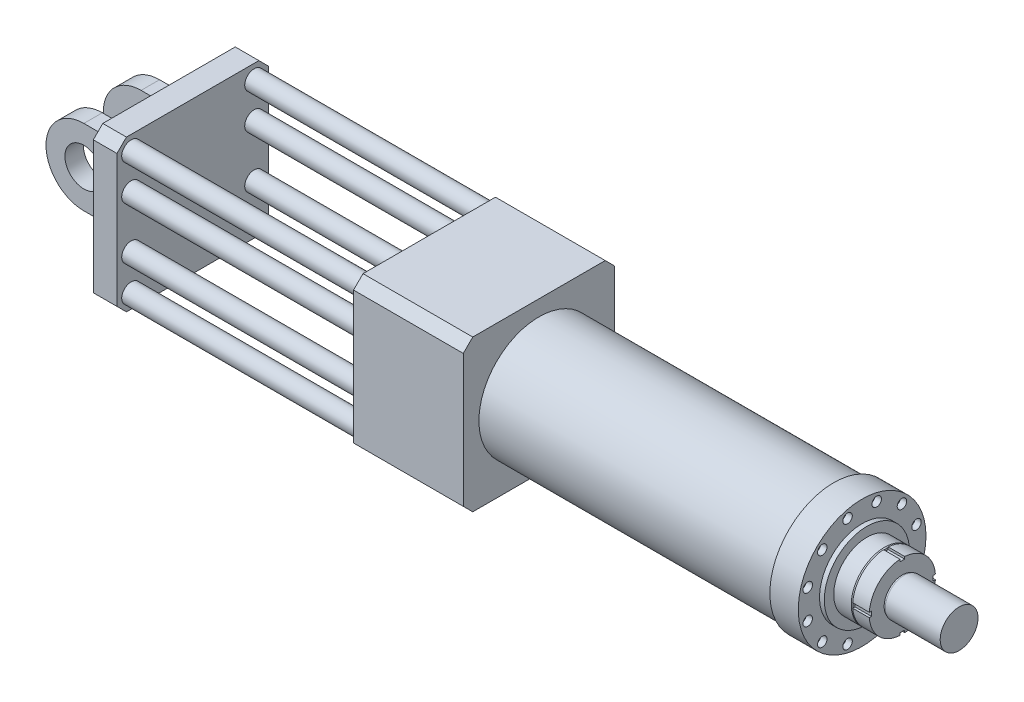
ISO-10303-21;
HEADER;
FILE_DESCRIPTION(('STEP AP214'),'2;1');
FILE_NAME('part.step','',(''),(''),'','','');
FILE_SCHEMA(('AUTOMOTIVE_DESIGN { 1 0 10303 214 1 1 1 1 }'));
ENDSEC;
DATA;
#1=APPLICATION_CONTEXT('core data for automotive mechanical design processes');
#2=APPLICATION_PROTOCOL_DEFINITION('international standard','automotive_design',2000,#1);
#3=PRODUCT_CONTEXT('',#1,'mechanical');
#4=PRODUCT('Part','Part','',(#3));
#5=PRODUCT_RELATED_PRODUCT_CATEGORY('part','',(#4));
#6=PRODUCT_DEFINITION_FORMATION('','',#4);
#7=PRODUCT_DEFINITION_CONTEXT('part definition',#1,'design');
#8=PRODUCT_DEFINITION('design','',#6,#7);
#9=PRODUCT_DEFINITION_SHAPE('','',#8);
#10=(LENGTH_UNIT() NAMED_UNIT(*) SI_UNIT(.MILLI.,.METRE.));
#11=(NAMED_UNIT(*) PLANE_ANGLE_UNIT() SI_UNIT($,.RADIAN.));
#12=(NAMED_UNIT(*) SI_UNIT($,.STERADIAN.) SOLID_ANGLE_UNIT());
#13=UNCERTAINTY_MEASURE_WITH_UNIT(LENGTH_MEASURE(1.E-05),#10,'distance_accuracy_value','');
#14=(GEOMETRIC_REPRESENTATION_CONTEXT(3) GLOBAL_UNCERTAINTY_ASSIGNED_CONTEXT((#13)) GLOBAL_UNIT_ASSIGNED_CONTEXT((#10,
#11,#12)) REPRESENTATION_CONTEXT('',''));
#15=CARTESIAN_POINT('',(0.,0.,0.));
#16=DIRECTION('',(0.,0.,1.));
#17=DIRECTION('',(1.,0.,0.));
#18=AXIS2_PLACEMENT_3D('',#15,#16,#17);
#19=CARTESIAN_POINT('',(-782.,0.,0.));
#20=DIRECTION('',(-1.,0.,0.));
#21=DIRECTION('',(0.,0.,1.));
#22=AXIS2_PLACEMENT_3D('',#19,#20,#21);
#23=PLANE('',#22);
#24=DIRECTION('',(0.,0.,1.));
#25=VECTOR('',#24,1.);
#26=CARTESIAN_POINT('',(-782.,90.0000000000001,0.));
#27=LINE('',#26,#25);
#28=CARTESIAN_POINT('',(-782.,90.,-90.));
#29=VERTEX_POINT('',#28);
#30=CARTESIAN_POINT('',(-782.,90.0000000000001,-31.));
#31=VERTEX_POINT('',#30);
#32=EDGE_CURVE('E274',#29,#31,#27,.T.);
#33=ORIENTED_EDGE('',*,*,#32,.T.);
#34=DIRECTION('',(0.,-1.,0.));
#35=VECTOR('',#34,1.);
#36=CARTESIAN_POINT('',(-782.,0.,-31.));
#37=LINE('',#36,#35);
#38=CARTESIAN_POINT('',(-782.,-90.,-31.));
#39=VERTEX_POINT('',#38);
#40=EDGE_CURVE('E276',#31,#39,#37,.T.);
#41=ORIENTED_EDGE('',*,*,#40,.T.);
#42=DIRECTION('',(0.,0.,-1.));
#43=VECTOR('',#42,1.);
#44=CARTESIAN_POINT('',(-782.,-90.,0.));
#45=LINE('',#44,#43);
#46=CARTESIAN_POINT('',(-782.,-90.,-90.));
#47=VERTEX_POINT('',#46);
#48=EDGE_CURVE('E272',#39,#47,#45,.T.);
#49=ORIENTED_EDGE('',*,*,#48,.T.);
#50=DIRECTION('',(0.,1.,0.));
#51=VECTOR('',#50,1.);
#52=CARTESIAN_POINT('',(-782.,0.,-90.));
#53=LINE('',#52,#51);
#54=EDGE_CURVE('E270',#47,#29,#53,.T.);
#55=ORIENTED_EDGE('',*,*,#54,.T.);
#56=EDGE_LOOP('',(#33,#41,#49,#55));
#57=FACE_BOUND('',#56,.T.);
#58=DIRECTION('',(0.,0.,-1.));
#59=VECTOR('',#58,1.);
#60=CARTESIAN_POINT('',(-782.,-90.,0.));
#61=LINE('',#60,#59);
#62=CARTESIAN_POINT('',(-782.,-90.,90.));
#63=VERTEX_POINT('',#62);
#64=CARTESIAN_POINT('',(-782.,-90.,31.));
#65=VERTEX_POINT('',#64);
#66=EDGE_CURVE('E265',#63,#65,#61,.T.);
#67=ORIENTED_EDGE('',*,*,#66,.T.);
#68=DIRECTION('',(0.,1.,0.));
#69=VECTOR('',#68,1.);
#70=CARTESIAN_POINT('',(-782.,0.,31.));
#71=LINE('',#70,#69);
#72=CARTESIAN_POINT('',(-782.,90.,31.));
#73=VERTEX_POINT('',#72);
#74=EDGE_CURVE('E267',#65,#73,#71,.T.);
#75=ORIENTED_EDGE('',*,*,#74,.T.);
#76=DIRECTION('',(0.,0.,1.));
#77=VECTOR('',#76,1.);
#78=CARTESIAN_POINT('',(-782.,90.,0.));
#79=LINE('',#78,#77);
#80=CARTESIAN_POINT('',(-782.,90.,90.));
#81=VERTEX_POINT('',#80);
#82=EDGE_CURVE('E261',#73,#81,#79,.T.);
#83=ORIENTED_EDGE('',*,*,#82,.T.);
#84=DIRECTION('',(0.,-1.,0.));
#85=VECTOR('',#84,1.);
#86=CARTESIAN_POINT('',(-782.,0.,90.));
#87=LINE('',#86,#85);
#88=EDGE_CURVE('E263',#81,#63,#87,.T.);
#89=ORIENTED_EDGE('',*,*,#88,.T.);
#90=EDGE_LOOP('',(#67,#75,#83,#89));
#91=FACE_BOUND('',#90,.T.);
#92=DIRECTION('',(0.,-1.,0.));
#93=VECTOR('',#92,1.);
#94=CARTESIAN_POINT('',(-782.,160.,-160.));
#95=LINE('',#94,#93);
#96=CARTESIAN_POINT('',(-782.,140.,-160.));
#97=VERTEX_POINT('',#96);
#98=CARTESIAN_POINT('',(-782.,-140.,-160.));
#99=VERTEX_POINT('',#98);
#100=EDGE_CURVE('E238',#97,#99,#95,.T.);
#101=ORIENTED_EDGE('',*,*,#100,.T.);
#102=DIRECTION('',(0.,0.707106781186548,-0.707106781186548));
#103=VECTOR('',#102,1.);
#104=CARTESIAN_POINT('',(-782.,-150.,-150.));
#105=LINE('',#104,#103);
#106=CARTESIAN_POINT('',(-782.,-160.,-140.));
#107=VERTEX_POINT('',#106);
#108=EDGE_CURVE('E335',#99,#107,#105,.F.);
#109=ORIENTED_EDGE('',*,*,#108,.T.);
#110=DIRECTION('',(0.,0.,1.));
#111=VECTOR('',#110,1.);
#112=CARTESIAN_POINT('',(-782.,-160.,-160.));
#113=LINE('',#112,#111);
#114=CARTESIAN_POINT('',(-782.,-160.,140.));
#115=VERTEX_POINT('',#114);
#116=EDGE_CURVE('E241',#107,#115,#113,.T.);
#117=ORIENTED_EDGE('',*,*,#116,.T.);
#118=DIRECTION('',(0.,-0.707106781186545,-0.70710678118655));
#119=VECTOR('',#118,1.);
#120=CARTESIAN_POINT('',(-782.,-150.,149.999999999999));
#121=LINE('',#120,#119);
#122=CARTESIAN_POINT('',(-782.,-140.,160.));
#123=VERTEX_POINT('',#122);
#124=EDGE_CURVE('E331',#115,#123,#121,.F.);
#125=ORIENTED_EDGE('',*,*,#124,.T.);
#126=DIRECTION('',(0.,1.,0.));
#127=VECTOR('',#126,1.);
#128=CARTESIAN_POINT('',(-782.,160.,160.));
#129=LINE('',#128,#127);
#130=CARTESIAN_POINT('',(-782.,140.,160.));
#131=VERTEX_POINT('',#130);
#132=EDGE_CURVE('E233',#123,#131,#129,.T.);
#133=ORIENTED_EDGE('',*,*,#132,.T.);
#134=DIRECTION('',(0.,-0.707106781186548,0.707106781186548));
#135=VECTOR('',#134,1.);
#136=CARTESIAN_POINT('',(-782.,150.,150.));
#137=LINE('',#136,#135);
#138=CARTESIAN_POINT('',(-782.,160.,140.));
#139=VERTEX_POINT('',#138);
#140=EDGE_CURVE('E73',#131,#139,#137,.F.);
#141=ORIENTED_EDGE('',*,*,#140,.T.);
#142=DIRECTION('',(0.,0.,-1.));
#143=VECTOR('',#142,1.);
#144=CARTESIAN_POINT('',(-782.,160.,-160.));
#145=LINE('',#144,#143);
#146=CARTESIAN_POINT('',(-782.,160.,-140.));
#147=VERTEX_POINT('',#146);
#148=EDGE_CURVE('E235',#139,#147,#145,.T.);
#149=ORIENTED_EDGE('',*,*,#148,.T.);
#150=DIRECTION('',(0.,0.707106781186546,0.707106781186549));
#151=VECTOR('',#150,1.);
#152=CARTESIAN_POINT('',(-782.,150.,-150.));
#153=LINE('',#152,#151);
#154=EDGE_CURVE('E333',#147,#97,#153,.F.);
#155=ORIENTED_EDGE('',*,*,#154,.T.);
#156=EDGE_LOOP('',(#101,#109,#117,#125,#133,#141,#149,#155));
#157=FACE_BOUND('',#156,.T.);
#158=ADVANCED_FACE('F51',(#57,#91,#157),#23,.T.);
#159=CARTESIAN_POINT('',(-782.,160.,160.));
#160=DIRECTION('',(0.,0.,-1.));
#161=DIRECTION('',(0.,1.,0.));
#162=AXIS2_PLACEMENT_3D('',#159,#160,#161);
#163=PLANE('',#162);
#164=ORIENTED_EDGE('',*,*,#132,.F.);
#165=DIRECTION('',(1.,0.,0.));
#166=VECTOR('',#165,1.);
#167=CARTESIAN_POINT('',(-782.,-140.,160.));
#168=LINE('',#167,#166);
#169=CARTESIAN_POINT('',(-732.,-140.,160.));
#170=VERTEX_POINT('',#169);
#171=EDGE_CURVE('E12',#123,#170,#168,.T.);
#172=ORIENTED_EDGE('',*,*,#171,.T.);
#173=DIRECTION('',(0.,1.,0.));
#174=VECTOR('',#173,1.);
#175=CARTESIAN_POINT('',(-732.,160.,160.));
#176=LINE('',#175,#174);
#177=CARTESIAN_POINT('',(-732.,140.,160.));
#178=VERTEX_POINT('',#177);
#179=EDGE_CURVE('E232',#170,#178,#176,.T.);
#180=ORIENTED_EDGE('',*,*,#179,.T.);
#181=DIRECTION('',(-1.,0.,0.));
#182=VECTOR('',#181,1.);
#183=CARTESIAN_POINT('',(-782.,140.,160.));
#184=LINE('',#183,#182);
#185=EDGE_CURVE('E59',#178,#131,#184,.T.);
#186=ORIENTED_EDGE('',*,*,#185,.T.);
#187=EDGE_LOOP('',(#164,#172,#180,#186));
#188=FACE_BOUND('',#187,.T.);
#189=ADVANCED_FACE('F343',(#188),#163,.F.);
#190=CARTESIAN_POINT('',(-782.,160.,-160.));
#191=DIRECTION('',(0.,-1.,0.));
#192=DIRECTION('',(0.,0.,-1.));
#193=AXIS2_PLACEMENT_3D('',#190,#191,#192);
#194=PLANE('',#193);
#195=DIRECTION('',(0.,0.,-1.));
#196=VECTOR('',#195,1.);
#197=CARTESIAN_POINT('',(-732.,160.,-160.));
#198=LINE('',#197,#196);
#199=CARTESIAN_POINT('',(-732.,160.,140.));
#200=VERTEX_POINT('',#199);
#201=CARTESIAN_POINT('',(-732.,160.,-140.));
#202=VERTEX_POINT('',#201);
#203=EDGE_CURVE('E247',#200,#202,#198,.T.);
#204=ORIENTED_EDGE('',*,*,#203,.T.);
#205=DIRECTION('',(-1.,0.,0.));
#206=VECTOR('',#205,1.);
#207=CARTESIAN_POINT('',(-782.,160.,-140.));
#208=LINE('',#207,#206);
#209=EDGE_CURVE('E66',#202,#147,#208,.T.);
#210=ORIENTED_EDGE('',*,*,#209,.T.);
#211=ORIENTED_EDGE('',*,*,#148,.F.);
#212=DIRECTION('',(1.,0.,0.));
#213=VECTOR('',#212,1.);
#214=CARTESIAN_POINT('',(-782.,160.,140.));
#215=LINE('',#214,#213);
#216=EDGE_CURVE('E337',#139,#200,#215,.T.);
#217=ORIENTED_EDGE('',*,*,#216,.T.);
#218=EDGE_LOOP('',(#204,#210,#211,#217));
#219=FACE_BOUND('',#218,.T.);
#220=ADVANCED_FACE('F350',(#219),#194,.F.);
#221=CARTESIAN_POINT('',(-782.,160.,-160.));
#222=DIRECTION('',(0.,0.,1.));
#223=DIRECTION('',(0.,-1.,0.));
#224=AXIS2_PLACEMENT_3D('',#221,#222,#223);
#225=PLANE('',#224);
#226=DIRECTION('',(0.,-1.,0.));
#227=VECTOR('',#226,1.);
#228=CARTESIAN_POINT('',(-732.,160.,-160.));
#229=LINE('',#228,#227);
#230=CARTESIAN_POINT('',(-732.,140.,-160.));
#231=VERTEX_POINT('',#230);
#232=CARTESIAN_POINT('',(-732.,-140.,-160.));
#233=VERTEX_POINT('',#232);
#234=EDGE_CURVE('E249',#231,#233,#229,.T.);
#235=ORIENTED_EDGE('',*,*,#234,.T.);
#236=DIRECTION('',(-1.,0.,0.));
#237=VECTOR('',#236,1.);
#238=CARTESIAN_POINT('',(-782.,-140.,-160.));
#239=LINE('',#238,#237);
#240=EDGE_CURVE('E328',#233,#99,#239,.T.);
#241=ORIENTED_EDGE('',*,*,#240,.T.);
#242=ORIENTED_EDGE('',*,*,#100,.F.);
#243=DIRECTION('',(1.,0.,0.));
#244=VECTOR('',#243,1.);
#245=CARTESIAN_POINT('',(-782.,140.,-160.));
#246=LINE('',#245,#244);
#247=EDGE_CURVE('E325',#97,#231,#246,.T.);
#248=ORIENTED_EDGE('',*,*,#247,.T.);
#249=EDGE_LOOP('',(#235,#241,#242,#248));
#250=FACE_BOUND('',#249,.T.);
#251=ADVANCED_FACE('F361',(#250),#225,.F.);
#252=CARTESIAN_POINT('',(-782.,-160.,-160.));
#253=DIRECTION('',(0.,1.,0.));
#254=DIRECTION('',(0.,0.,1.));
#255=AXIS2_PLACEMENT_3D('',#252,#253,#254);
#256=PLANE('',#255);
#257=ORIENTED_EDGE('',*,*,#116,.F.);
#258=DIRECTION('',(1.,0.,0.));
#259=VECTOR('',#258,1.);
#260=CARTESIAN_POINT('',(-782.,-160.,-140.));
#261=LINE('',#260,#259);
#262=CARTESIAN_POINT('',(-732.,-160.,-140.));
#263=VERTEX_POINT('',#262);
#264=EDGE_CURVE('E314',#107,#263,#261,.T.);
#265=ORIENTED_EDGE('',*,*,#264,.T.);
#266=DIRECTION('',(0.,0.,1.));
#267=VECTOR('',#266,1.);
#268=CARTESIAN_POINT('',(-732.,-160.,-160.));
#269=LINE('',#268,#267);
#270=CARTESIAN_POINT('',(-732.,-160.,140.));
#271=VERTEX_POINT('',#270);
#272=EDGE_CURVE('E236',#263,#271,#269,.T.);
#273=ORIENTED_EDGE('',*,*,#272,.T.);
#274=DIRECTION('',(-1.,0.,0.));
#275=VECTOR('',#274,1.);
#276=CARTESIAN_POINT('',(-782.,-160.,140.));
#277=LINE('',#276,#275);
#278=EDGE_CURVE('E293',#271,#115,#277,.T.);
#279=ORIENTED_EDGE('',*,*,#278,.T.);
#280=EDGE_LOOP('',(#257,#265,#273,#279));
#281=FACE_BOUND('',#280,.T.);
#282=ADVANCED_FACE('F369',(#281),#256,.F.);
#283=CARTESIAN_POINT('',(-732.,0.,0.));
#284=DIRECTION('',(-1.,0.,0.));
#285=DIRECTION('',(0.,0.,1.));
#286=AXIS2_PLACEMENT_3D('',#283,#284,#285);
#287=PLANE('',#286);
#288=ORIENTED_EDGE('',*,*,#272,.F.);
#289=DIRECTION('',(0.,-0.707106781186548,0.707106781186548));
#290=VECTOR('',#289,1.);
#291=CARTESIAN_POINT('',(-732.,-160.,-140.));
#292=LINE('',#291,#290);
#293=EDGE_CURVE('E323',#263,#233,#292,.F.);
#294=ORIENTED_EDGE('',*,*,#293,.T.);
#295=ORIENTED_EDGE('',*,*,#234,.F.);
#296=DIRECTION('',(0.,-0.707106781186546,-0.707106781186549));
#297=VECTOR('',#296,1.);
#298=CARTESIAN_POINT('',(-732.,140.,-160.));
#299=LINE('',#298,#297);
#300=EDGE_CURVE('E321',#231,#202,#299,.F.);
#301=ORIENTED_EDGE('',*,*,#300,.T.);
#302=ORIENTED_EDGE('',*,*,#203,.F.);
#303=DIRECTION('',(0.,0.707106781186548,-0.707106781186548));
#304=VECTOR('',#303,1.);
#305=CARTESIAN_POINT('',(-732.,160.,140.));
#306=LINE('',#305,#304);
#307=EDGE_CURVE('E317',#200,#178,#306,.F.);
#308=ORIENTED_EDGE('',*,*,#307,.T.);
#309=ORIENTED_EDGE('',*,*,#179,.F.);
#310=DIRECTION('',(0.,0.707106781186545,0.70710678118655));
#311=VECTOR('',#310,1.);
#312=CARTESIAN_POINT('',(-732.,-140.,160.));
#313=LINE('',#312,#311);
#314=EDGE_CURVE('E319',#170,#271,#313,.F.);
#315=ORIENTED_EDGE('',*,*,#314,.T.);
#316=EDGE_LOOP('',(#288,#294,#295,#301,#302,#308,#309,#315));
#317=FACE_BOUND('',#316,.T.);
#318=ADVANCED_FACE('F353',(#317),#287,.F.);
#319=CARTESIAN_POINT('',(-962.,80.,-41.));
#320=DIRECTION('',(0.,0.,-1.));
#321=DIRECTION('',(0.,1.,0.));
#322=AXIS2_PLACEMENT_3D('',#319,#320,#321);
#323=PLANE('',#322);
#324=CARTESIAN_POINT('',(-882.,0.,-41.));
#325=DIRECTION('',(0.,0.,-1.));
#326=DIRECTION('',(0.,1.,0.));
#327=AXIS2_PLACEMENT_3D('',#324,#325,#326);
#328=CIRCLE('',#327,40.);
#329=CARTESIAN_POINT('',(-842.,0.,-41.));
#330=VERTEX_POINT('',#329);
#331=EDGE_CURVE('E649',#330,#330,#328,.T.);
#332=ORIENTED_EDGE('',*,*,#331,.T.);
#333=EDGE_LOOP('',(#332));
#334=FACE_BOUND('',#333,.T.);
#335=DIRECTION('',(1.,0.,0.));
#336=VECTOR('',#335,1.);
#337=CARTESIAN_POINT('',(-962.,-80.,-41.));
#338=LINE('',#337,#336);
#339=CARTESIAN_POINT('',(-882.,-79.9999999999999,-41.));
#340=VERTEX_POINT('',#339);
#341=CARTESIAN_POINT('',(-792.,-80.,-41.));
#342=VERTEX_POINT('',#341);
#343=EDGE_CURVE('E215',#340,#342,#338,.T.);
#344=ORIENTED_EDGE('',*,*,#343,.T.);
#345=DIRECTION('',(0.,1.,0.));
#346=VECTOR('',#345,1.);
#347=CARTESIAN_POINT('',(-792.,80.,-41.));
#348=LINE('',#347,#346);
#349=CARTESIAN_POINT('',(-792.,80.,-41.));
#350=VERTEX_POINT('',#349);
#351=EDGE_CURVE('E244',#342,#350,#348,.T.);
#352=ORIENTED_EDGE('',*,*,#351,.T.);
#353=DIRECTION('',(1.,0.,0.));
#354=VECTOR('',#353,1.);
#355=CARTESIAN_POINT('',(-962.,80.,-41.));
#356=LINE('',#355,#354);
#357=CARTESIAN_POINT('',(-882.,80.,-41.));
#358=VERTEX_POINT('',#357);
#359=EDGE_CURVE('E229',#358,#350,#356,.T.);
#360=ORIENTED_EDGE('',*,*,#359,.F.);
#361=CARTESIAN_POINT('',(-882.,0.,-41.));
#362=DIRECTION('',(0.,0.,-1.));
#363=DIRECTION('',(0.,1.,0.));
#364=AXIS2_PLACEMENT_3D('',#361,#362,#363);
#365=CIRCLE('',#364,80.);
#366=EDGE_CURVE('E258',#358,#340,#365,.F.);
#367=ORIENTED_EDGE('',*,*,#366,.T.);
#368=EDGE_LOOP('',(#344,#352,#360,#367));
#369=FACE_BOUND('',#368,.T.);
#370=ADVANCED_FACE('F389',(#334,#369),#323,.F.);
#371=CARTESIAN_POINT('',(-962.,80.,-80.));
#372=DIRECTION('',(0.,-1.,0.));
#373=DIRECTION('',(0.,0.,-1.));
#374=AXIS2_PLACEMENT_3D('',#371,#372,#373);
#375=PLANE('',#374);
#376=ORIENTED_EDGE('',*,*,#359,.T.);
#377=DIRECTION('',(0.,0.,-1.));
#378=VECTOR('',#377,1.);
#379=CARTESIAN_POINT('',(-792.,80.,-80.));
#380=LINE('',#379,#378);
#381=CARTESIAN_POINT('',(-792.,80.,-80.));
#382=VERTEX_POINT('',#381);
#383=EDGE_CURVE('E279',#350,#382,#380,.T.);
#384=ORIENTED_EDGE('',*,*,#383,.T.);
#385=DIRECTION('',(1.,0.,0.));
#386=VECTOR('',#385,1.);
#387=CARTESIAN_POINT('',(-962.,80.,-80.));
#388=LINE('',#387,#386);
#389=CARTESIAN_POINT('',(-882.,80.,-80.));
#390=VERTEX_POINT('',#389);
#391=EDGE_CURVE('E226',#390,#382,#388,.T.);
#392=ORIENTED_EDGE('',*,*,#391,.F.);
#393=DIRECTION('',(0.,0.,1.));
#394=VECTOR('',#393,1.);
#395=CARTESIAN_POINT('',(-882.,80.,-100.));
#396=LINE('',#395,#394);
#397=EDGE_CURVE('E210',#390,#358,#396,.T.);
#398=ORIENTED_EDGE('',*,*,#397,.T.);
#399=EDGE_LOOP('',(#376,#384,#392,#398));
#400=FACE_BOUND('',#399,.T.);
#401=ADVANCED_FACE('F578',(#400),#375,.F.);
#402=CARTESIAN_POINT('',(-962.,80.,-80.));
#403=DIRECTION('',(0.,0.,1.));
#404=DIRECTION('',(0.,-1.,0.));
#405=AXIS2_PLACEMENT_3D('',#402,#403,#404);
#406=PLANE('',#405);
#407=CARTESIAN_POINT('',(-882.,0.,-80.));
#408=DIRECTION('',(0.,0.,1.));
#409=DIRECTION('',(0.,-1.,0.));
#410=AXIS2_PLACEMENT_3D('',#407,#408,#409);
#411=CIRCLE('',#410,40.);
#412=CARTESIAN_POINT('',(-842.,0.,-80.));
#413=VERTEX_POINT('',#412);
#414=EDGE_CURVE('E257',#413,#413,#411,.T.);
#415=ORIENTED_EDGE('',*,*,#414,.T.);
#416=EDGE_LOOP('',(#415));
#417=FACE_BOUND('',#416,.T.);
#418=ORIENTED_EDGE('',*,*,#391,.T.);
#419=DIRECTION('',(0.,-1.,0.));
#420=VECTOR('',#419,1.);
#421=CARTESIAN_POINT('',(-792.,80.,-80.));
#422=LINE('',#421,#420);
#423=CARTESIAN_POINT('',(-792.,-80.,-80.));
#424=VERTEX_POINT('',#423);
#425=EDGE_CURVE('E283',#382,#424,#422,.T.);
#426=ORIENTED_EDGE('',*,*,#425,.T.);
#427=DIRECTION('',(1.,0.,0.));
#428=VECTOR('',#427,1.);
#429=CARTESIAN_POINT('',(-962.,-80.,-80.));
#430=LINE('',#429,#428);
#431=CARTESIAN_POINT('',(-882.,-80.,-80.));
#432=VERTEX_POINT('',#431);
#433=EDGE_CURVE('E218',#432,#424,#430,.T.);
#434=ORIENTED_EDGE('',*,*,#433,.F.);
#435=CARTESIAN_POINT('',(-882.,0.,-80.));
#436=DIRECTION('',(0.,0.,1.));
#437=DIRECTION('',(0.,-1.,0.));
#438=AXIS2_PLACEMENT_3D('',#435,#436,#437);
#439=CIRCLE('',#438,80.);
#440=EDGE_CURVE('E669',#432,#390,#439,.F.);
#441=ORIENTED_EDGE('',*,*,#440,.T.);
#442=EDGE_LOOP('',(#418,#426,#434,#441));
#443=FACE_BOUND('',#442,.T.);
#444=ADVANCED_FACE('F569',(#417,#443),#406,.F.);
#445=CARTESIAN_POINT('',(-962.,-80.,-80.));
#446=DIRECTION('',(0.,1.,0.));
#447=DIRECTION('',(0.,0.,1.));
#448=AXIS2_PLACEMENT_3D('',#445,#446,#447);
#449=PLANE('',#448);
#450=ORIENTED_EDGE('',*,*,#433,.T.);
#451=DIRECTION('',(0.,0.,1.));
#452=VECTOR('',#451,1.);
#453=CARTESIAN_POINT('',(-792.,-80.,-80.));
#454=LINE('',#453,#452);
#455=EDGE_CURVE('E281',#424,#342,#454,.T.);
#456=ORIENTED_EDGE('',*,*,#455,.T.);
#457=ORIENTED_EDGE('',*,*,#343,.F.);
#458=DIRECTION('',(0.,0.,1.));
#459=VECTOR('',#458,1.);
#460=CARTESIAN_POINT('',(-882.,-79.9999999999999,-100.));
#461=LINE('',#460,#459);
#462=EDGE_CURVE('E696',#432,#340,#461,.T.);
#463=ORIENTED_EDGE('',*,*,#462,.F.);
#464=EDGE_LOOP('',(#450,#456,#457,#463));
#465=FACE_BOUND('',#464,.T.);
#466=ADVANCED_FACE('F560',(#465),#449,.F.);
#467=CARTESIAN_POINT('',(-962.,80.,80.));
#468=DIRECTION('',(0.,0.,-1.));
#469=DIRECTION('',(0.,1.,0.));
#470=AXIS2_PLACEMENT_3D('',#467,#468,#469);
#471=PLANE('',#470);
#472=CARTESIAN_POINT('',(-882.,0.,80.));
#473=DIRECTION('',(0.,0.,1.));
#474=DIRECTION('',(1.,0.,0.));
#475=AXIS2_PLACEMENT_3D('',#472,#473,#474);
#476=CIRCLE('',#475,40.);
#477=CARTESIAN_POINT('',(-842.,0.,80.));
#478=VERTEX_POINT('',#477);
#479=EDGE_CURVE('E675',#478,#478,#476,.T.);
#480=ORIENTED_EDGE('',*,*,#479,.F.);
#481=EDGE_LOOP('',(#480));
#482=FACE_BOUND('',#481,.T.);
#483=DIRECTION('',(1.,0.,0.));
#484=VECTOR('',#483,1.);
#485=CARTESIAN_POINT('',(-962.,-80.,80.));
#486=LINE('',#485,#484);
#487=CARTESIAN_POINT('',(-882.,-79.9999999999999,80.));
#488=VERTEX_POINT('',#487);
#489=CARTESIAN_POINT('',(-792.,-80.,80.));
#490=VERTEX_POINT('',#489);
#491=EDGE_CURVE('E682',#488,#490,#486,.T.);
#492=ORIENTED_EDGE('',*,*,#491,.T.);
#493=DIRECTION('',(0.,1.,0.));
#494=VECTOR('',#493,1.);
#495=CARTESIAN_POINT('',(-792.,80.,80.));
#496=LINE('',#495,#494);
#497=CARTESIAN_POINT('',(-792.,80.,80.));
#498=VERTEX_POINT('',#497);
#499=EDGE_CURVE('E214',#490,#498,#496,.T.);
#500=ORIENTED_EDGE('',*,*,#499,.T.);
#501=DIRECTION('',(1.,0.,0.));
#502=VECTOR('',#501,1.);
#503=CARTESIAN_POINT('',(-962.,80.,80.));
#504=LINE('',#503,#502);
#505=CARTESIAN_POINT('',(-882.,80.,80.));
#506=VERTEX_POINT('',#505);
#507=EDGE_CURVE('E206',#506,#498,#504,.T.);
#508=ORIENTED_EDGE('',*,*,#507,.F.);
#509=CARTESIAN_POINT('',(-882.,0.,80.));
#510=DIRECTION('',(0.,0.,-1.));
#511=DIRECTION('',(1.,0.,0.));
#512=AXIS2_PLACEMENT_3D('',#509,#510,#511);
#513=CIRCLE('',#512,80.);
#514=EDGE_CURVE('E190',#488,#506,#513,.T.);
#515=ORIENTED_EDGE('',*,*,#514,.F.);
#516=EDGE_LOOP('',(#492,#500,#508,#515));
#517=FACE_BOUND('',#516,.T.);
#518=ADVANCED_FACE('F212',(#482,#517),#471,.F.);
#519=CARTESIAN_POINT('',(-962.,80.,41.));
#520=DIRECTION('',(0.,-1.,0.));
#521=DIRECTION('',(0.,0.,-1.));
#522=AXIS2_PLACEMENT_3D('',#519,#520,#521);
#523=PLANE('',#522);
#524=ORIENTED_EDGE('',*,*,#507,.T.);
#525=DIRECTION('',(0.,0.,-1.));
#526=VECTOR('',#525,1.);
#527=CARTESIAN_POINT('',(-792.,80.,41.));
#528=LINE('',#527,#526);
#529=CARTESIAN_POINT('',(-792.,80.,41.));
#530=VERTEX_POINT('',#529);
#531=EDGE_CURVE('E291',#498,#530,#528,.T.);
#532=ORIENTED_EDGE('',*,*,#531,.T.);
#533=DIRECTION('',(1.,0.,0.));
#534=VECTOR('',#533,1.);
#535=CARTESIAN_POINT('',(-962.,80.,41.));
#536=LINE('',#535,#534);
#537=CARTESIAN_POINT('',(-882.,80.,40.9999999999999));
#538=VERTEX_POINT('',#537);
#539=EDGE_CURVE('E209',#538,#530,#536,.T.);
#540=ORIENTED_EDGE('',*,*,#539,.F.);
#541=EDGE_CURVE('E193',#538,#506,#396,.T.);
#542=ORIENTED_EDGE('',*,*,#541,.T.);
#543=EDGE_LOOP('',(#524,#532,#540,#542));
#544=FACE_BOUND('',#543,.T.);
#545=ADVANCED_FACE('F205',(#544),#523,.F.);
#546=CARTESIAN_POINT('',(-962.,80.,41.));
#547=DIRECTION('',(0.,0.,1.));
#548=DIRECTION('',(0.,-1.,0.));
#549=AXIS2_PLACEMENT_3D('',#546,#547,#548);
#550=PLANE('',#549);
#551=CARTESIAN_POINT('',(-882.,0.,41.));
#552=DIRECTION('',(0.,0.,1.));
#553=DIRECTION('',(0.,-1.,0.));
#554=AXIS2_PLACEMENT_3D('',#551,#552,#553);
#555=CIRCLE('',#554,40.);
#556=CARTESIAN_POINT('',(-842.,0.,40.9999999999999));
#557=VERTEX_POINT('',#556);
#558=EDGE_CURVE('E254',#557,#557,#555,.T.);
#559=ORIENTED_EDGE('',*,*,#558,.T.);
#560=EDGE_LOOP('',(#559));
#561=FACE_BOUND('',#560,.T.);
#562=ORIENTED_EDGE('',*,*,#539,.T.);
#563=DIRECTION('',(0.,-1.,0.));
#564=VECTOR('',#563,1.);
#565=CARTESIAN_POINT('',(-792.,80.,41.));
#566=LINE('',#565,#564);
#567=CARTESIAN_POINT('',(-792.,-80.,41.));
#568=VERTEX_POINT('',#567);
#569=EDGE_CURVE('E285',#530,#568,#566,.T.);
#570=ORIENTED_EDGE('',*,*,#569,.T.);
#571=DIRECTION('',(1.,0.,0.));
#572=VECTOR('',#571,1.);
#573=CARTESIAN_POINT('',(-962.,-80.,41.));
#574=LINE('',#573,#572);
#575=CARTESIAN_POINT('',(-882.,-80.,41.));
#576=VERTEX_POINT('',#575);
#577=EDGE_CURVE('E220',#576,#568,#574,.T.);
#578=ORIENTED_EDGE('',*,*,#577,.F.);
#579=CARTESIAN_POINT('',(-882.,0.,41.));
#580=DIRECTION('',(0.,0.,1.));
#581=DIRECTION('',(0.,-1.,0.));
#582=AXIS2_PLACEMENT_3D('',#579,#580,#581);
#583=CIRCLE('',#582,80.);
#584=EDGE_CURVE('E672',#576,#538,#583,.F.);
#585=ORIENTED_EDGE('',*,*,#584,.T.);
#586=EDGE_LOOP('',(#562,#570,#578,#585));
#587=FACE_BOUND('',#586,.T.);
#588=ADVANCED_FACE('F536',(#561,#587),#550,.F.);
#589=CARTESIAN_POINT('',(-962.,-80.,41.));
#590=DIRECTION('',(0.,1.,0.));
#591=DIRECTION('',(0.,0.,1.));
#592=AXIS2_PLACEMENT_3D('',#589,#590,#591);
#593=PLANE('',#592);
#594=ORIENTED_EDGE('',*,*,#577,.T.);
#595=DIRECTION('',(0.,0.,1.));
#596=VECTOR('',#595,1.);
#597=CARTESIAN_POINT('',(-792.,-80.,41.));
#598=LINE('',#597,#596);
#599=EDGE_CURVE('E288',#568,#490,#598,.T.);
#600=ORIENTED_EDGE('',*,*,#599,.T.);
#601=ORIENTED_EDGE('',*,*,#491,.F.);
#602=EDGE_CURVE('E196',#576,#488,#461,.T.);
#603=ORIENTED_EDGE('',*,*,#602,.F.);
#604=EDGE_LOOP('',(#594,#600,#601,#603));
#605=FACE_BOUND('',#604,.T.);
#606=ADVANCED_FACE('F530',(#605),#593,.F.);
#607=CARTESIAN_POINT('',(-882.,0.,-100.));
#608=DIRECTION('',(0.,0.,1.));
#609=DIRECTION('',(1.,0.,0.));
#610=AXIS2_PLACEMENT_3D('',#607,#608,#609);
#611=CYLINDRICAL_SURFACE('',#610,80.);
#612=ORIENTED_EDGE('',*,*,#602,.T.);
#613=ORIENTED_EDGE('',*,*,#514,.T.);
#614=ORIENTED_EDGE('',*,*,#541,.F.);
#615=ORIENTED_EDGE('',*,*,#584,.F.);
#616=EDGE_LOOP('',(#612,#613,#614,#615));
#617=FACE_BOUND('',#616,.T.);
#618=ADVANCED_FACE('F192',(#617),#611,.T.);
#619=CARTESIAN_POINT('',(-882.,0.,-100.));
#620=DIRECTION('',(0.,0.,1.));
#621=DIRECTION('',(1.,0.,0.));
#622=AXIS2_PLACEMENT_3D('',#619,#620,#621);
#623=CYLINDRICAL_SURFACE('',#622,40.);
#624=CARTESIAN_POINT('',(-842.,0.,80.));
#625=CARTESIAN_POINT('',(-842.,0.,79.59375));
#626=CARTESIAN_POINT('',(-842.,0.,79.1875));
#627=CARTESIAN_POINT('',(-842.,0.,78.375));
#628=CARTESIAN_POINT('',(-842.,0.,77.96875));
#629=CARTESIAN_POINT('',(-842.,0.,77.15625));
#630=CARTESIAN_POINT('',(-842.,0.,76.75));
#631=CARTESIAN_POINT('',(-842.,0.,75.9375));
#632=CARTESIAN_POINT('',(-842.,0.,75.53125));
#633=CARTESIAN_POINT('',(-842.,0.,74.71875));
#634=CARTESIAN_POINT('',(-842.,0.,74.3125));
#635=CARTESIAN_POINT('',(-842.,0.,73.5));
#636=CARTESIAN_POINT('',(-842.,0.,73.09375));
#637=CARTESIAN_POINT('',(-842.,0.,72.28125));
#638=CARTESIAN_POINT('',(-842.,0.,71.875));
#639=CARTESIAN_POINT('',(-842.,0.,71.0625));
#640=CARTESIAN_POINT('',(-842.,0.,70.65625));
#641=CARTESIAN_POINT('',(-842.,0.,69.84375));
#642=CARTESIAN_POINT('',(-842.,0.,69.4375));
#643=CARTESIAN_POINT('',(-842.,0.,68.625));
#644=CARTESIAN_POINT('',(-842.,0.,68.21875));
#645=CARTESIAN_POINT('',(-842.,0.,67.40625));
#646=CARTESIAN_POINT('',(-842.,0.,67.));
#647=CARTESIAN_POINT('',(-842.,0.,66.1875));
#648=CARTESIAN_POINT('',(-842.,0.,65.78125));
#649=CARTESIAN_POINT('',(-842.,0.,64.96875));
#650=CARTESIAN_POINT('',(-842.,0.,64.5625));
#651=CARTESIAN_POINT('',(-842.,0.,63.75));
#652=CARTESIAN_POINT('',(-842.,0.,63.34375));
#653=CARTESIAN_POINT('',(-842.,0.,62.53125));
#654=CARTESIAN_POINT('',(-842.,0.,62.125));
#655=CARTESIAN_POINT('',(-842.,0.,61.3125));
#656=CARTESIAN_POINT('',(-842.,0.,60.90625));
#657=CARTESIAN_POINT('',(-842.,0.,60.09375));
#658=CARTESIAN_POINT('',(-842.,0.,59.6875));
#659=CARTESIAN_POINT('',(-842.,0.,58.875));
#660=CARTESIAN_POINT('',(-842.,0.,58.46875));
#661=CARTESIAN_POINT('',(-842.,0.,57.65625));
#662=CARTESIAN_POINT('',(-842.,0.,57.25));
#663=CARTESIAN_POINT('',(-842.,0.,56.4375));
#664=CARTESIAN_POINT('',(-842.,0.,56.0312499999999));
#665=CARTESIAN_POINT('',(-842.,0.,55.2187499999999));
#666=CARTESIAN_POINT('',(-842.,0.,54.8124999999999));
#667=CARTESIAN_POINT('',(-842.,0.,54.));
#668=CARTESIAN_POINT('',(-842.,0.,53.59375));
#669=CARTESIAN_POINT('',(-842.,0.,52.78125));
#670=CARTESIAN_POINT('',(-842.,0.,52.3749999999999));
#671=CARTESIAN_POINT('',(-842.,0.,51.5624999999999));
#672=CARTESIAN_POINT('',(-842.,0.,51.1562499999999));
#673=CARTESIAN_POINT('',(-842.,0.,50.34375));
#674=CARTESIAN_POINT('',(-842.,0.,49.9375));
#675=CARTESIAN_POINT('',(-842.,0.,49.125));
#676=CARTESIAN_POINT('',(-842.,0.,48.7187499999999));
#677=CARTESIAN_POINT('',(-842.,0.,47.9062499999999));
#678=CARTESIAN_POINT('',(-842.,0.,47.4999999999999));
#679=CARTESIAN_POINT('',(-842.,0.,46.6875));
#680=CARTESIAN_POINT('',(-842.,0.,46.28125));
#681=CARTESIAN_POINT('',(-842.,0.,45.46875));
#682=CARTESIAN_POINT('',(-842.,0.,45.0624999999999));
#683=CARTESIAN_POINT('',(-842.,0.,44.2499999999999));
#684=CARTESIAN_POINT('',(-842.,0.,43.8437499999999));
#685=CARTESIAN_POINT('',(-842.,0.,43.0312499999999));
#686=CARTESIAN_POINT('',(-842.,0.,42.6249999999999));
#687=CARTESIAN_POINT('',(-842.,0.,41.8124999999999));
#688=CARTESIAN_POINT('',(-842.,0.,41.4062499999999));
#689=CARTESIAN_POINT('',(-842.,0.,40.9999999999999));
#690=B_SPLINE_CURVE_WITH_KNOTS('',3,(#624,#625,#626,#627,#628,#629,#630,#631,#632,#633,#634,
#635,#636,#637,#638,#639,#640,#641,#642,#643,#644,#645,#646,#647,#648,#649,#650,#651,#652,#653,
#654,#655,#656,#657,#658,#659,#660,#661,#662,#663,#664,#665,#666,#667,#668,#669,#670,#671,#672,
#673,#674,#675,#676,#677,#678,#679,#680,#681,#682,#683,#684,#685,#686,#687,#688,#689),
.UNSPECIFIED.,.F.,.F.,(4,2,2,2,2,2,2,2,2,2,2,2,2,2,2,2,2,2,2,2,2,2,2,2,2,2,2,2,2,2,2,2,4),(0.,
1.21874999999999,2.43750000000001,3.65625,4.87500000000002,6.09375000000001,7.3125,
8.53125000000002,9.75000000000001,10.96875,12.1875,13.40625,14.625,15.84375,17.0625,18.28125,
19.5,20.71875,21.9375,23.15625,24.375,25.59375,26.8125,28.03125,29.25,30.46875,31.6875,32.90625,
34.125,35.34375,36.5625,37.78125,39.),.UNSPECIFIED.);
#691=EDGE_CURVE('BSEAM507',#478,#557,#690,.T.);
#692=ORIENTED_EDGE('',*,*,#479,.T.);
#693=ORIENTED_EDGE('',*,*,#558,.F.);
#694=ORIENTED_EDGE('',*,*,#691,.T.);
#695=ORIENTED_EDGE('',*,*,#691,.F.);
#696=EDGE_LOOP('',(#692,#694,#693,#695));
#697=FACE_BOUND('',#696,.T.);
#698=ADVANCED_FACE('F507',(#697),#623,.F.);
#699=ORIENTED_EDGE('',*,*,#397,.F.);
#700=ORIENTED_EDGE('',*,*,#440,.F.);
#701=ORIENTED_EDGE('',*,*,#462,.T.);
#702=ORIENTED_EDGE('',*,*,#366,.F.);
#703=EDGE_LOOP('',(#699,#700,#701,#702));
#704=FACE_BOUND('',#703,.T.);
#705=ADVANCED_FACE('F504',(#704),#611,.T.);
#706=CARTESIAN_POINT('',(-842.,0.,-80.));
#707=CARTESIAN_POINT('',(-842.,0.,-79.59375));
#708=CARTESIAN_POINT('',(-842.,0.,-79.1875));
#709=CARTESIAN_POINT('',(-842.,0.,-78.375));
#710=CARTESIAN_POINT('',(-842.,0.,-77.96875));
#711=CARTESIAN_POINT('',(-842.,0.,-77.15625));
#712=CARTESIAN_POINT('',(-842.,0.,-76.75));
#713=CARTESIAN_POINT('',(-842.,0.,-75.9375));
#714=CARTESIAN_POINT('',(-842.,0.,-75.53125));
#715=CARTESIAN_POINT('',(-842.,0.,-74.71875));
#716=CARTESIAN_POINT('',(-842.,0.,-74.3125));
#717=CARTESIAN_POINT('',(-842.,0.,-73.5));
#718=CARTESIAN_POINT('',(-842.,0.,-73.09375));
#719=CARTESIAN_POINT('',(-842.,0.,-72.28125));
#720=CARTESIAN_POINT('',(-842.,0.,-71.875));
#721=CARTESIAN_POINT('',(-842.,0.,-71.0625));
#722=CARTESIAN_POINT('',(-842.,0.,-70.65625));
#723=CARTESIAN_POINT('',(-842.,0.,-69.84375));
#724=CARTESIAN_POINT('',(-842.,0.,-69.4375));
#725=CARTESIAN_POINT('',(-842.,0.,-68.625));
#726=CARTESIAN_POINT('',(-842.,0.,-68.21875));
#727=CARTESIAN_POINT('',(-842.,0.,-67.40625));
#728=CARTESIAN_POINT('',(-842.,0.,-67.));
#729=CARTESIAN_POINT('',(-842.,0.,-66.1875));
#730=CARTESIAN_POINT('',(-842.,0.,-65.78125));
#731=CARTESIAN_POINT('',(-842.,0.,-64.96875));
#732=CARTESIAN_POINT('',(-842.,0.,-64.5625));
#733=CARTESIAN_POINT('',(-842.,0.,-63.75));
#734=CARTESIAN_POINT('',(-842.,0.,-63.34375));
#735=CARTESIAN_POINT('',(-842.,0.,-62.53125));
#736=CARTESIAN_POINT('',(-842.,0.,-62.125));
#737=CARTESIAN_POINT('',(-842.,0.,-61.3125));
#738=CARTESIAN_POINT('',(-842.,0.,-60.90625));
#739=CARTESIAN_POINT('',(-842.,0.,-60.09375));
#740=CARTESIAN_POINT('',(-842.,0.,-59.6875));
#741=CARTESIAN_POINT('',(-842.,0.,-58.875));
#742=CARTESIAN_POINT('',(-842.,0.,-58.46875));
#743=CARTESIAN_POINT('',(-842.,0.,-57.65625));
#744=CARTESIAN_POINT('',(-842.,0.,-57.25));
#745=CARTESIAN_POINT('',(-842.,0.,-56.4375));
#746=CARTESIAN_POINT('',(-842.,0.,-56.03125));
#747=CARTESIAN_POINT('',(-842.,0.,-55.21875));
#748=CARTESIAN_POINT('',(-842.,0.,-54.8125));
#749=CARTESIAN_POINT('',(-842.,0.,-54.));
#750=CARTESIAN_POINT('',(-842.,0.,-53.59375));
#751=CARTESIAN_POINT('',(-842.,0.,-52.78125));
#752=CARTESIAN_POINT('',(-842.,0.,-52.375));
#753=CARTESIAN_POINT('',(-842.,0.,-51.5625));
#754=CARTESIAN_POINT('',(-842.,0.,-51.15625));
#755=CARTESIAN_POINT('',(-842.,0.,-50.34375));
#756=CARTESIAN_POINT('',(-842.,0.,-49.9375));
#757=CARTESIAN_POINT('',(-842.,0.,-49.125));
#758=CARTESIAN_POINT('',(-842.,0.,-48.71875));
#759=CARTESIAN_POINT('',(-842.,0.,-47.90625));
#760=CARTESIAN_POINT('',(-842.,0.,-47.5));
#761=CARTESIAN_POINT('',(-842.,0.,-46.6875));
#762=CARTESIAN_POINT('',(-842.,0.,-46.28125));
#763=CARTESIAN_POINT('',(-842.,0.,-45.46875));
#764=CARTESIAN_POINT('',(-842.,0.,-45.0625));
#765=CARTESIAN_POINT('',(-842.,0.,-44.25));
#766=CARTESIAN_POINT('',(-842.,0.,-43.84375));
#767=CARTESIAN_POINT('',(-842.,0.,-43.03125));
#768=CARTESIAN_POINT('',(-842.,0.,-42.625));
#769=CARTESIAN_POINT('',(-842.,0.,-41.8125));
#770=CARTESIAN_POINT('',(-842.,0.,-41.40625));
#771=CARTESIAN_POINT('',(-842.,0.,-41.));
#772=B_SPLINE_CURVE_WITH_KNOTS('',3,(#706,#707,#708,#709,#710,#711,#712,#713,#714,#715,#716,
#717,#718,#719,#720,#721,#722,#723,#724,#725,#726,#727,#728,#729,#730,#731,#732,#733,#734,#735,
#736,#737,#738,#739,#740,#741,#742,#743,#744,#745,#746,#747,#748,#749,#750,#751,#752,#753,#754,
#755,#756,#757,#758,#759,#760,#761,#762,#763,#764,#765,#766,#767,#768,#769,#770,#771),
.UNSPECIFIED.,.F.,.F.,(4,2,2,2,2,2,2,2,2,2,2,2,2,2,2,2,2,2,2,2,2,2,2,2,2,2,2,2,2,2,2,2,4),(0.,
1.21875,2.43750000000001,3.65625,4.875,6.09375000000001,7.31250000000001,8.53125,
9.75000000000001,10.96875,12.1875,13.40625,14.625,15.84375,17.0625,18.28125,19.5,20.71875,
21.9375,23.15625,24.375,25.59375,26.8125,28.03125,29.25,30.46875,31.6875,32.90625,34.125,
35.34375,36.5625,37.78125,39.),.UNSPECIFIED.);
#773=EDGE_CURVE('BSEAM415',#413,#330,#772,.T.);
#774=ORIENTED_EDGE('',*,*,#414,.F.);
#775=ORIENTED_EDGE('',*,*,#331,.F.);
#776=ORIENTED_EDGE('',*,*,#773,.T.);
#777=ORIENTED_EDGE('',*,*,#773,.F.);
#778=EDGE_LOOP('',(#774,#776,#775,#777));
#779=FACE_BOUND('',#778,.T.);
#780=ADVANCED_FACE('F415',(#779),#623,.F.);
#781=CARTESIAN_POINT('',(-792.,80.,-80.));
#782=DIRECTION('',(0.707106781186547,0.,0.707106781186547));
#783=DIRECTION('',(0.,-1.,0.));
#784=AXIS2_PLACEMENT_3D('',#781,#782,#783);
#785=PLANE('',#784);
#786=DIRECTION('',(0.577350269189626,0.577350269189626,-0.577350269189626));
#787=VECTOR('',#786,1.);
#788=CARTESIAN_POINT('',(-792.,80.,-80.));
#789=LINE('',#788,#787);
#790=EDGE_CURVE('E299',#29,#382,#789,.F.);
#791=ORIENTED_EDGE('',*,*,#790,.F.);
#792=ORIENTED_EDGE('',*,*,#54,.F.);
#793=DIRECTION('',(-0.577350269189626,0.577350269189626,0.577350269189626));
#794=VECTOR('',#793,1.);
#795=CARTESIAN_POINT('',(-845.333333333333,-26.6666666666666,-26.6666666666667));
#796=LINE('',#795,#794);
#797=EDGE_CURVE('E201',#424,#47,#796,.F.);
#798=ORIENTED_EDGE('',*,*,#797,.F.);
#799=ORIENTED_EDGE('',*,*,#425,.F.);
#800=EDGE_LOOP('',(#791,#792,#798,#799));
#801=FACE_BOUND('',#800,.T.);
#802=ADVANCED_FACE('F411',(#801),#785,.F.);
#803=CARTESIAN_POINT('',(-792.,-80.,-80.));
#804=DIRECTION('',(0.707106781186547,0.707106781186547,0.));
#805=DIRECTION('',(0.,0.,1.));
#806=AXIS2_PLACEMENT_3D('',#803,#804,#805);
#807=PLANE('',#806);
#808=ORIENTED_EDGE('',*,*,#797,.T.);
#809=ORIENTED_EDGE('',*,*,#48,.F.);
#810=DIRECTION('',(-0.577350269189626,0.577350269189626,-0.577350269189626));
#811=VECTOR('',#810,1.);
#812=CARTESIAN_POINT('',(-805.,-67.,-54.));
#813=LINE('',#812,#811);
#814=EDGE_CURVE('E296',#342,#39,#813,.F.);
#815=ORIENTED_EDGE('',*,*,#814,.F.);
#816=ORIENTED_EDGE('',*,*,#455,.F.);
#817=EDGE_LOOP('',(#808,#809,#815,#816));
#818=FACE_BOUND('',#817,.T.);
#819=ADVANCED_FACE('F407',(#818),#807,.F.);
#820=CARTESIAN_POINT('',(-792.,80.,-80.));
#821=DIRECTION('',(0.707106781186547,-0.707106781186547,0.));
#822=DIRECTION('',(0.,0.,-1.));
#823=AXIS2_PLACEMENT_3D('',#820,#821,#822);
#824=PLANE('',#823);
#825=ORIENTED_EDGE('',*,*,#790,.T.);
#826=ORIENTED_EDGE('',*,*,#383,.F.);
#827=DIRECTION('',(0.577350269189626,0.577350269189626,0.577350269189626));
#828=VECTOR('',#827,1.);
#829=CARTESIAN_POINT('',(-805.,67.,-54.));
#830=LINE('',#829,#828);
#831=EDGE_CURVE('E294',#31,#350,#830,.F.);
#832=ORIENTED_EDGE('',*,*,#831,.F.);
#833=ORIENTED_EDGE('',*,*,#32,.F.);
#834=EDGE_LOOP('',(#825,#826,#832,#833));
#835=FACE_BOUND('',#834,.T.);
#836=ADVANCED_FACE('F403',(#835),#824,.F.);
#837=CARTESIAN_POINT('',(-792.,80.,-41.));
#838=DIRECTION('',(0.707106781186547,0.,-0.707106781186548));
#839=DIRECTION('',(0.,1.,0.));
#840=AXIS2_PLACEMENT_3D('',#837,#838,#839);
#841=PLANE('',#840);
#842=ORIENTED_EDGE('',*,*,#814,.T.);
#843=ORIENTED_EDGE('',*,*,#40,.F.);
#844=ORIENTED_EDGE('',*,*,#831,.T.);
#845=ORIENTED_EDGE('',*,*,#351,.F.);
#846=EDGE_LOOP('',(#842,#843,#844,#845));
#847=FACE_BOUND('',#846,.T.);
#848=ADVANCED_FACE('F399',(#847),#841,.F.);
#849=CARTESIAN_POINT('',(-792.,80.,80.));
#850=DIRECTION('',(0.707106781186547,0.,-0.707106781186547));
#851=DIRECTION('',(0.,1.,0.));
#852=AXIS2_PLACEMENT_3D('',#849,#850,#851);
#853=PLANE('',#852);
#854=DIRECTION('',(0.577350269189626,-0.577350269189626,0.577350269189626));
#855=VECTOR('',#854,1.);
#856=CARTESIAN_POINT('',(-845.333333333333,-26.6666666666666,26.6666666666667));
#857=LINE('',#856,#855);
#858=EDGE_CURVE('E308',#63,#490,#857,.F.);
#859=ORIENTED_EDGE('',*,*,#858,.F.);
#860=ORIENTED_EDGE('',*,*,#88,.F.);
#861=DIRECTION('',(0.577350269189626,0.577350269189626,0.577350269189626));
#862=VECTOR('',#861,1.);
#863=CARTESIAN_POINT('',(-805.,67.,67.));
#864=LINE('',#863,#862);
#865=EDGE_CURVE('E297',#498,#81,#864,.T.);
#866=ORIENTED_EDGE('',*,*,#865,.F.);
#867=ORIENTED_EDGE('',*,*,#499,.F.);
#868=EDGE_LOOP('',(#859,#860,#866,#867));
#869=FACE_BOUND('',#868,.T.);
#870=ADVANCED_FACE('F402',(#869),#853,.F.);
#871=CARTESIAN_POINT('',(-792.,80.,41.));
#872=DIRECTION('',(0.707106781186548,-0.707106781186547,0.));
#873=DIRECTION('',(0.,0.,-1.));
#874=AXIS2_PLACEMENT_3D('',#871,#872,#873);
#875=PLANE('',#874);
#876=ORIENTED_EDGE('',*,*,#865,.T.);
#877=ORIENTED_EDGE('',*,*,#82,.F.);
#878=DIRECTION('',(-0.577350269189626,-0.577350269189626,0.577350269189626));
#879=VECTOR('',#878,1.);
#880=CARTESIAN_POINT('',(-792.,80.,41.));
#881=LINE('',#880,#879);
#882=EDGE_CURVE('E306',#530,#73,#881,.F.);
#883=ORIENTED_EDGE('',*,*,#882,.F.);
#884=ORIENTED_EDGE('',*,*,#531,.F.);
#885=EDGE_LOOP('',(#876,#877,#883,#884));
#886=FACE_BOUND('',#885,.T.);
#887=ADVANCED_FACE('F424',(#886),#875,.F.);
#888=CARTESIAN_POINT('',(-792.,-80.,41.));
#889=DIRECTION('',(0.707106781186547,0.707106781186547,0.));
#890=DIRECTION('',(0.,0.,1.));
#891=AXIS2_PLACEMENT_3D('',#888,#889,#890);
#892=PLANE('',#891);
#893=ORIENTED_EDGE('',*,*,#858,.T.);
#894=ORIENTED_EDGE('',*,*,#599,.F.);
#895=DIRECTION('',(0.577350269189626,-0.577350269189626,-0.577350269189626));
#896=VECTOR('',#895,1.);
#897=CARTESIAN_POINT('',(-792.,-80.,41.));
#898=LINE('',#897,#896);
#899=EDGE_CURVE('E304',#65,#568,#898,.F.);
#900=ORIENTED_EDGE('',*,*,#899,.F.);
#901=ORIENTED_EDGE('',*,*,#66,.F.);
#902=EDGE_LOOP('',(#893,#894,#900,#901));
#903=FACE_BOUND('',#902,.T.);
#904=ADVANCED_FACE('F420',(#903),#892,.F.);
#905=CARTESIAN_POINT('',(-792.,80.,41.));
#906=DIRECTION('',(0.707106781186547,0.,0.707106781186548));
#907=DIRECTION('',(0.,-1.,0.));
#908=AXIS2_PLACEMENT_3D('',#905,#906,#907);
#909=PLANE('',#908);
#910=ORIENTED_EDGE('',*,*,#882,.T.);
#911=ORIENTED_EDGE('',*,*,#74,.F.);
#912=ORIENTED_EDGE('',*,*,#899,.T.);
#913=ORIENTED_EDGE('',*,*,#569,.F.);
#914=EDGE_LOOP('',(#910,#911,#912,#913));
#915=FACE_BOUND('',#914,.T.);
#916=ADVANCED_FACE('F417',(#915),#909,.F.);
#917=CARTESIAN_POINT('',(-782.,-160.,-140.));
#918=DIRECTION('',(0.,0.707106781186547,0.707106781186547));
#919=DIRECTION('',(1.,0.,0.));
#920=AXIS2_PLACEMENT_3D('',#917,#918,#919);
#921=PLANE('',#920);
#922=ORIENTED_EDGE('',*,*,#108,.F.);
#923=ORIENTED_EDGE('',*,*,#240,.F.);
#924=ORIENTED_EDGE('',*,*,#293,.F.);
#925=ORIENTED_EDGE('',*,*,#264,.F.);
#926=EDGE_LOOP('',(#922,#923,#924,#925));
#927=FACE_BOUND('',#926,.T.);
#928=ADVANCED_FACE('F367',(#927),#921,.F.);
#929=CARTESIAN_POINT('',(-782.,140.,-160.));
#930=DIRECTION('',(0.,-0.707106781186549,0.707106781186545));
#931=DIRECTION('',(1.,0.,0.));
#932=AXIS2_PLACEMENT_3D('',#929,#930,#931);
#933=PLANE('',#932);
#934=ORIENTED_EDGE('',*,*,#154,.F.);
#935=ORIENTED_EDGE('',*,*,#209,.F.);
#936=ORIENTED_EDGE('',*,*,#300,.F.);
#937=ORIENTED_EDGE('',*,*,#247,.F.);
#938=EDGE_LOOP('',(#934,#935,#936,#937));
#939=FACE_BOUND('',#938,.T.);
#940=ADVANCED_FACE('F358',(#939),#933,.F.);
#941=CARTESIAN_POINT('',(-782.,-140.,160.));
#942=DIRECTION('',(0.,0.70710678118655,-0.707106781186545));
#943=DIRECTION('',(1.,0.,0.));
#944=AXIS2_PLACEMENT_3D('',#941,#942,#943);
#945=PLANE('',#944);
#946=ORIENTED_EDGE('',*,*,#124,.F.);
#947=ORIENTED_EDGE('',*,*,#278,.F.);
#948=ORIENTED_EDGE('',*,*,#314,.F.);
#949=ORIENTED_EDGE('',*,*,#171,.F.);
#950=EDGE_LOOP('',(#946,#947,#948,#949));
#951=FACE_BOUND('',#950,.T.);
#952=ADVANCED_FACE('F372',(#951),#945,.F.);
#953=CARTESIAN_POINT('',(-782.,160.,140.));
#954=DIRECTION('',(0.,-0.707106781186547,-0.707106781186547));
#955=DIRECTION('',(1.,0.,0.));
#956=AXIS2_PLACEMENT_3D('',#953,#954,#955);
#957=PLANE('',#956);
#958=ORIENTED_EDGE('',*,*,#140,.F.);
#959=ORIENTED_EDGE('',*,*,#185,.F.);
#960=ORIENTED_EDGE('',*,*,#307,.F.);
#961=ORIENTED_EDGE('',*,*,#216,.F.);
#962=EDGE_LOOP('',(#958,#959,#960,#961));
#963=FACE_BOUND('',#962,.T.);
#964=ADVANCED_FACE('F53',(#963),#957,.F.);
#965=CLOSED_SHELL('',(#158,#189,#220,#251,#282,#318,#370,#401,#444,#466,#518,#545,#588,#606,
#618,#698,#705,#780,#802,#819,#836,#848,#870,#887,#904,#916,#928,#940,#952,#964));
#966=MANIFOLD_SOLID_BREP('B2',#965);
#967=CARTESIAN_POINT('',(768.,0.,0.));
#968=DIRECTION('',(-1.,0.,0.));
#969=DIRECTION('',(0.,0.,1.));
#970=AXIS2_PLACEMENT_3D('',#967,#968,#969);
#971=CYLINDRICAL_SURFACE('',#970,70.);
#972=DIRECTION('',(-1.,0.,0.));
#973=VECTOR('',#972,1.);
#974=CARTESIAN_POINT('',(768.,69.8212002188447,5.));
#975=LINE('',#974,#973);
#976=CARTESIAN_POINT('',(733.,69.8212002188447,5.));
#977=VERTEX_POINT('',#976);
#978=CARTESIAN_POINT('',(768.,69.8212002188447,5.));
#979=VERTEX_POINT('',#978);
#980=EDGE_CURVE('E959',#977,#979,#975,.F.);
#981=ORIENTED_EDGE('',*,*,#980,.F.);
#982=CARTESIAN_POINT('',(733.,0.,0.));
#983=DIRECTION('',(1.,0.,0.));
#984=DIRECTION('',(0.,0.,-1.));
#985=AXIS2_PLACEMENT_3D('',#982,#983,#984);
#986=CIRCLE('',#985,70.);
#987=CARTESIAN_POINT('',(733.,5.,69.8212002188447));
#988=VERTEX_POINT('',#987);
#989=EDGE_CURVE('E985',#977,#988,#986,.T.);
#990=ORIENTED_EDGE('',*,*,#989,.T.);
#991=DIRECTION('',(-1.,0.,0.));
#992=VECTOR('',#991,1.);
#993=CARTESIAN_POINT('',(768.,5.,69.8212002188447));
#994=LINE('',#993,#992);
#995=CARTESIAN_POINT('',(768.,5.,69.8212002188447));
#996=VERTEX_POINT('',#995);
#997=EDGE_CURVE('E948',#996,#988,#994,.T.);
#998=ORIENTED_EDGE('',*,*,#997,.F.);
#999=CARTESIAN_POINT('',(768.,0.,0.));
#1000=DIRECTION('',(1.,0.,0.));
#1001=DIRECTION('',(0.,0.,-1.));
#1002=AXIS2_PLACEMENT_3D('',#999,#1000,#1001);
#1003=CIRCLE('',#1002,70.);
#1004=EDGE_CURVE('E980',#979,#996,#1003,.T.);
#1005=ORIENTED_EDGE('',*,*,#1004,.F.);
#1006=EDGE_LOOP('',(#981,#990,#998,#1005));
#1007=FACE_BOUND('',#1006,.T.);
#1008=ADVANCED_FACE('F715',(#1007),#971,.T.);
#1009=CARTESIAN_POINT('',(733.,5.,-69.8212002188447));
#1010=VERTEX_POINT('',#1009);
#1011=CARTESIAN_POINT('',(733.,69.8212002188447,-5.));
#1012=VERTEX_POINT('',#1011);
#1013=EDGE_CURVE('E982',#1010,#1012,#986,.T.);
#1014=ORIENTED_EDGE('',*,*,#1013,.T.);
#1015=DIRECTION('',(-1.,0.,0.));
#1016=VECTOR('',#1015,1.);
#1017=CARTESIAN_POINT('',(768.,69.8212002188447,-5.));
#1018=LINE('',#1017,#1016);
#1019=CARTESIAN_POINT('',(768.,69.8212002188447,-5.));
#1020=VERTEX_POINT('',#1019);
#1021=EDGE_CURVE('E740',#1012,#1020,#1018,.F.);
#1022=ORIENTED_EDGE('',*,*,#1021,.T.);
#1023=CARTESIAN_POINT('',(768.,5.,-69.8212002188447));
#1024=VERTEX_POINT('',#1023);
#1025=EDGE_CURVE('E976',#1024,#1020,#1003,.T.);
#1026=ORIENTED_EDGE('',*,*,#1025,.F.);
#1027=DIRECTION('',(-1.,0.,0.));
#1028=VECTOR('',#1027,1.);
#1029=CARTESIAN_POINT('',(768.,5.,-69.8212002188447));
#1030=LINE('',#1029,#1028);
#1031=EDGE_CURVE('E956',#1010,#1024,#1030,.F.);
#1032=ORIENTED_EDGE('',*,*,#1031,.F.);
#1033=EDGE_LOOP('',(#1014,#1022,#1026,#1032));
#1034=FACE_BOUND('',#1033,.T.);
#1035=ADVANCED_FACE('F1207',(#1034),#971,.T.);
#1036=DIRECTION('',(-1.,0.,0.));
#1037=VECTOR('',#1036,1.);
#1038=CARTESIAN_POINT('',(768.,-4.99999999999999,-69.8212002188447));
#1039=LINE('',#1038,#1037);
#1040=CARTESIAN_POINT('',(768.,-4.99999999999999,-69.8212002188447));
#1041=VERTEX_POINT('',#1040);
#1042=CARTESIAN_POINT('',(733.,-4.99999999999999,-69.8212002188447));
#1043=VERTEX_POINT('',#1042);
#1044=EDGE_CURVE('E732',#1041,#1043,#1039,.T.);
#1045=ORIENTED_EDGE('',*,*,#1044,.F.);
#1046=CARTESIAN_POINT('',(768.,-69.8212002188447,-5.));
#1047=VERTEX_POINT('',#1046);
#1048=EDGE_CURVE('E981',#1047,#1041,#1003,.T.);
#1049=ORIENTED_EDGE('',*,*,#1048,.F.);
#1050=DIRECTION('',(-1.,0.,0.));
#1051=VECTOR('',#1050,1.);
#1052=CARTESIAN_POINT('',(768.,-69.8212002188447,-5.));
#1053=LINE('',#1052,#1051);
#1054=CARTESIAN_POINT('',(733.,-69.8212002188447,-5.));
#1055=VERTEX_POINT('',#1054);
#1056=EDGE_CURVE('E950',#1047,#1055,#1053,.T.);
#1057=ORIENTED_EDGE('',*,*,#1056,.T.);
#1058=EDGE_CURVE('E970',#1055,#1043,#986,.T.);
#1059=ORIENTED_EDGE('',*,*,#1058,.T.);
#1060=EDGE_LOOP('',(#1045,#1049,#1057,#1059));
#1061=FACE_BOUND('',#1060,.T.);
#1062=ADVANCED_FACE('F1221',(#1061),#971,.T.);
#1063=DIRECTION('',(-1.,0.,0.));
#1064=VECTOR('',#1063,1.);
#1065=CARTESIAN_POINT('',(768.,-69.8212002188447,5.));
#1066=LINE('',#1065,#1064);
#1067=CARTESIAN_POINT('',(768.,-69.8212002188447,5.));
#1068=VERTEX_POINT('',#1067);
#1069=CARTESIAN_POINT('',(733.,-69.8212002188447,5.));
#1070=VERTEX_POINT('',#1069);
#1071=EDGE_CURVE('E953',#1068,#1070,#1066,.T.);
#1072=ORIENTED_EDGE('',*,*,#1071,.F.);
#1073=CARTESIAN_POINT('',(768.,-5.00000000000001,69.8212002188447));
#1074=VERTEX_POINT('',#1073);
#1075=EDGE_CURVE('E1233',#1074,#1068,#1003,.T.);
#1076=ORIENTED_EDGE('',*,*,#1075,.F.);
#1077=DIRECTION('',(-1.,0.,0.));
#1078=VECTOR('',#1077,1.);
#1079=CARTESIAN_POINT('',(768.,-5.00000000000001,69.8212002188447));
#1080=LINE('',#1079,#1078);
#1081=CARTESIAN_POINT('',(733.,-5.00000000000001,69.8212002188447));
#1082=VERTEX_POINT('',#1081);
#1083=EDGE_CURVE('E862',#1082,#1074,#1080,.F.);
#1084=ORIENTED_EDGE('',*,*,#1083,.F.);
#1085=EDGE_CURVE('E1223',#1082,#1070,#986,.T.);
#1086=ORIENTED_EDGE('',*,*,#1085,.T.);
#1087=EDGE_LOOP('',(#1072,#1076,#1084,#1086));
#1088=FACE_BOUND('',#1087,.T.);
#1089=ADVANCED_FACE('F1253',(#1088),#971,.T.);
#1090=CARTESIAN_POINT('',(768.,0.,0.));
#1091=DIRECTION('',(1.,0.,0.));
#1092=DIRECTION('',(0.,0.,-1.));
#1093=AXIS2_PLACEMENT_3D('',#1090,#1091,#1092);
#1094=PLANE('',#1093);
#1095=CARTESIAN_POINT('',(768.,0.,0.));
#1096=DIRECTION('',(1.,0.,0.));
#1097=DIRECTION('',(0.,0.,-1.));
#1098=AXIS2_PLACEMENT_3D('',#1095,#1096,#1097);
#1099=CIRCLE('',#1098,38.5);
#1100=CARTESIAN_POINT('',(768.,0.,-38.5));
#1101=VERTEX_POINT('',#1100);
#1102=EDGE_CURVE('E971',#1101,#1101,#1099,.T.);
#1103=ORIENTED_EDGE('',*,*,#1102,.F.);
#1104=EDGE_LOOP('',(#1103));
#1105=FACE_BOUND('',#1104,.T.);
#1106=DIRECTION('',(0.,0.,-1.));
#1107=VECTOR('',#1106,1.);
#1108=CARTESIAN_POINT('',(768.,65.,5.));
#1109=LINE('',#1108,#1107);
#1110=CARTESIAN_POINT('',(768.,65.,5.));
#1111=VERTEX_POINT('',#1110);
#1112=CARTESIAN_POINT('',(768.,65.,-5.));
#1113=VERTEX_POINT('',#1112);
#1114=EDGE_CURVE('E860',#1111,#1113,#1109,.T.);
#1115=ORIENTED_EDGE('',*,*,#1114,.F.);
#1116=DIRECTION('',(0.,1.,0.));
#1117=VECTOR('',#1116,1.);
#1118=CARTESIAN_POINT('',(768.,65.,5.));
#1119=LINE('',#1118,#1117);
#1120=EDGE_CURVE('E879',#1111,#979,#1119,.T.);
#1121=ORIENTED_EDGE('',*,*,#1120,.T.);
#1122=ORIENTED_EDGE('',*,*,#1004,.T.);
#1123=DIRECTION('',(0.,0.,-1.));
#1124=VECTOR('',#1123,1.);
#1125=CARTESIAN_POINT('',(768.,5.,76.4659316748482));
#1126=LINE('',#1125,#1124);
#1127=CARTESIAN_POINT('',(768.,5.,65.));
#1128=VERTEX_POINT('',#1127);
#1129=EDGE_CURVE('E913',#996,#1128,#1126,.T.);
#1130=ORIENTED_EDGE('',*,*,#1129,.T.);
#1131=DIRECTION('',(0.,-1.,0.));
#1132=VECTOR('',#1131,1.);
#1133=CARTESIAN_POINT('',(768.,5.,65.));
#1134=LINE('',#1133,#1132);
#1135=CARTESIAN_POINT('',(768.,-5.00000000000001,65.));
#1136=VERTEX_POINT('',#1135);
#1137=EDGE_CURVE('E937',#1128,#1136,#1134,.T.);
#1138=ORIENTED_EDGE('',*,*,#1137,.T.);
#1139=DIRECTION('',(0.,0.,1.));
#1140=VECTOR('',#1139,1.);
#1141=CARTESIAN_POINT('',(768.,-5.00000000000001,65.));
#1142=LINE('',#1141,#1140);
#1143=EDGE_CURVE('E934',#1136,#1074,#1142,.T.);
#1144=ORIENTED_EDGE('',*,*,#1143,.T.);
#1145=ORIENTED_EDGE('',*,*,#1075,.T.);
#1146=DIRECTION('',(0.,1.,0.));
#1147=VECTOR('',#1146,1.);
#1148=CARTESIAN_POINT('',(768.,-77.2193180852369,5.));
#1149=LINE('',#1148,#1147);
#1150=CARTESIAN_POINT('',(768.,-65.,5.));
#1151=VERTEX_POINT('',#1150);
#1152=EDGE_CURVE('E914',#1068,#1151,#1149,.T.);
#1153=ORIENTED_EDGE('',*,*,#1152,.T.);
#1154=DIRECTION('',(0.,0.,-1.));
#1155=VECTOR('',#1154,1.);
#1156=CARTESIAN_POINT('',(768.,-65.,5.));
#1157=LINE('',#1156,#1155);
#1158=CARTESIAN_POINT('',(768.,-65.,-5.));
#1159=VERTEX_POINT('',#1158);
#1160=EDGE_CURVE('E917',#1151,#1159,#1157,.T.);
#1161=ORIENTED_EDGE('',*,*,#1160,.T.);
#1162=DIRECTION('',(0.,1.,0.));
#1163=VECTOR('',#1162,1.);
#1164=CARTESIAN_POINT('',(768.,-77.2193180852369,-5.));
#1165=LINE('',#1164,#1163);
#1166=EDGE_CURVE('E891',#1047,#1159,#1165,.T.);
#1167=ORIENTED_EDGE('',*,*,#1166,.F.);
#1168=ORIENTED_EDGE('',*,*,#1048,.T.);
#1169=DIRECTION('',(0.,0.,1.));
#1170=VECTOR('',#1169,1.);
#1171=CARTESIAN_POINT('',(768.,-4.99999999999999,-98.9652028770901));
#1172=LINE('',#1171,#1170);
#1173=CARTESIAN_POINT('',(768.,-4.99999999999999,-65.));
#1174=VERTEX_POINT('',#1173);
#1175=EDGE_CURVE('E895',#1041,#1174,#1172,.T.);
#1176=ORIENTED_EDGE('',*,*,#1175,.T.);
#1177=DIRECTION('',(0.,-1.,0.));
#1178=VECTOR('',#1177,1.);
#1179=CARTESIAN_POINT('',(768.,5.,-65.));
#1180=LINE('',#1179,#1178);
#1181=CARTESIAN_POINT('',(768.,5.,-65.));
#1182=VERTEX_POINT('',#1181);
#1183=EDGE_CURVE('E883',#1182,#1174,#1180,.T.);
#1184=ORIENTED_EDGE('',*,*,#1183,.F.);
#1185=DIRECTION('',(0.,0.,-1.));
#1186=VECTOR('',#1185,1.);
#1187=CARTESIAN_POINT('',(768.,5.,-65.));
#1188=LINE('',#1187,#1186);
#1189=EDGE_CURVE('E892',#1182,#1024,#1188,.T.);
#1190=ORIENTED_EDGE('',*,*,#1189,.T.);
#1191=ORIENTED_EDGE('',*,*,#1025,.T.);
#1192=DIRECTION('',(0.,1.,0.));
#1193=VECTOR('',#1192,1.);
#1194=CARTESIAN_POINT('',(768.,65.,-5.));
#1195=LINE('',#1194,#1193);
#1196=EDGE_CURVE('E882',#1113,#1020,#1195,.T.);
#1197=ORIENTED_EDGE('',*,*,#1196,.F.);
#1198=EDGE_LOOP('',(#1115,#1121,#1122,#1130,#1138,#1144,#1145,#1153,#1161,#1167,#1168,#1176,
#1184,#1190,#1191,#1197));
#1199=FACE_BOUND('',#1198,.T.);
#1200=ADVANCED_FACE('F1211',(#1105,#1199),#1094,.T.);
#1201=CARTESIAN_POINT('',(733.,0.,0.));
#1202=DIRECTION('',(1.,0.,0.));
#1203=DIRECTION('',(0.,0.,-1.));
#1204=AXIS2_PLACEMENT_3D('',#1201,#1202,#1203);
#1205=PLANE('',#1204);
#1206=DIRECTION('',(0.,1.,0.));
#1207=VECTOR('',#1206,1.);
#1208=CARTESIAN_POINT('',(733.,0.,5.));
#1209=LINE('',#1208,#1207);
#1210=CARTESIAN_POINT('',(733.,68.7264488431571,5.));
#1211=VERTEX_POINT('',#1210);
#1212=EDGE_CURVE('E49',#1211,#977,#1209,.T.);
#1213=ORIENTED_EDGE('',*,*,#1212,.F.);
#1214=CARTESIAN_POINT('',(733.,0.,0.));
#1215=DIRECTION('',(1.,0.,0.));
#1216=DIRECTION('',(0.,0.,-1.));
#1217=AXIS2_PLACEMENT_3D('',#1214,#1215,#1216);
#1218=CIRCLE('',#1217,68.9080892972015);
#1219=CARTESIAN_POINT('',(733.,5.,68.7264488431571));
#1220=VERTEX_POINT('',#1219);
#1221=EDGE_CURVE('E1170',#1211,#1220,#1218,.T.);
#1222=ORIENTED_EDGE('',*,*,#1221,.T.);
#1223=DIRECTION('',(0.,0.,-1.));
#1224=VECTOR('',#1223,1.);
#1225=CARTESIAN_POINT('',(733.,5.,0.));
#1226=LINE('',#1225,#1224);
#1227=EDGE_CURVE('E1044',#988,#1220,#1226,.T.);
#1228=ORIENTED_EDGE('',*,*,#1227,.F.);
#1229=ORIENTED_EDGE('',*,*,#989,.F.);
#1230=EDGE_LOOP('',(#1213,#1222,#1228,#1229));
#1231=FACE_BOUND('',#1230,.T.);
#1232=ADVANCED_FACE('F1168',(#1231),#1205,.F.);
#1233=CARTESIAN_POINT('',(733.,5.,-68.7264488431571));
#1234=VERTEX_POINT('',#1233);
#1235=CARTESIAN_POINT('',(733.,68.7264488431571,-5.));
#1236=VERTEX_POINT('',#1235);
#1237=EDGE_CURVE('E1037',#1234,#1236,#1218,.T.);
#1238=ORIENTED_EDGE('',*,*,#1237,.T.);
#1239=DIRECTION('',(0.,1.,0.));
#1240=VECTOR('',#1239,1.);
#1241=CARTESIAN_POINT('',(733.,0.,-5.));
#1242=LINE('',#1241,#1240);
#1243=EDGE_CURVE('E724',#1236,#1012,#1242,.T.);
#1244=ORIENTED_EDGE('',*,*,#1243,.T.);
#1245=ORIENTED_EDGE('',*,*,#1013,.F.);
#1246=DIRECTION('',(0.,0.,-1.));
#1247=VECTOR('',#1246,1.);
#1248=CARTESIAN_POINT('',(733.,5.,0.));
#1249=LINE('',#1248,#1247);
#1250=EDGE_CURVE('E1055',#1234,#1010,#1249,.T.);
#1251=ORIENTED_EDGE('',*,*,#1250,.F.);
#1252=EDGE_LOOP('',(#1238,#1244,#1245,#1251));
#1253=FACE_BOUND('',#1252,.T.);
#1254=ADVANCED_FACE('F1205',(#1253),#1205,.F.);
#1255=DIRECTION('',(0.,0.,1.));
#1256=VECTOR('',#1255,1.);
#1257=CARTESIAN_POINT('',(733.,-5.,0.));
#1258=LINE('',#1257,#1256);
#1259=CARTESIAN_POINT('',(733.,-4.99999999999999,-68.7264488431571));
#1260=VERTEX_POINT('',#1259);
#1261=EDGE_CURVE('E1053',#1043,#1260,#1258,.T.);
#1262=ORIENTED_EDGE('',*,*,#1261,.F.);
#1263=ORIENTED_EDGE('',*,*,#1058,.F.);
#1264=DIRECTION('',(0.,1.,0.));
#1265=VECTOR('',#1264,1.);
#1266=CARTESIAN_POINT('',(733.,0.,-5.));
#1267=LINE('',#1266,#1265);
#1268=CARTESIAN_POINT('',(733.,-68.7264488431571,-5.));
#1269=VERTEX_POINT('',#1268);
#1270=EDGE_CURVE('E1047',#1055,#1269,#1267,.T.);
#1271=ORIENTED_EDGE('',*,*,#1270,.T.);
#1272=EDGE_CURVE('E1187',#1269,#1260,#1218,.T.);
#1273=ORIENTED_EDGE('',*,*,#1272,.T.);
#1274=EDGE_LOOP('',(#1262,#1263,#1271,#1273));
#1275=FACE_BOUND('',#1274,.T.);
#1276=ADVANCED_FACE('F1219',(#1275),#1205,.F.);
#1277=DIRECTION('',(0.,1.,0.));
#1278=VECTOR('',#1277,1.);
#1279=CARTESIAN_POINT('',(733.,0.,5.));
#1280=LINE('',#1279,#1278);
#1281=CARTESIAN_POINT('',(733.,-68.7264488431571,5.));
#1282=VERTEX_POINT('',#1281);
#1283=EDGE_CURVE('E1050',#1070,#1282,#1280,.T.);
#1284=ORIENTED_EDGE('',*,*,#1283,.F.);
#1285=ORIENTED_EDGE('',*,*,#1085,.F.);
#1286=DIRECTION('',(0.,0.,1.));
#1287=VECTOR('',#1286,1.);
#1288=CARTESIAN_POINT('',(733.,-5.00000000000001,0.));
#1289=LINE('',#1288,#1287);
#1290=CARTESIAN_POINT('',(733.,-5.00000000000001,68.7264488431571));
#1291=VERTEX_POINT('',#1290);
#1292=EDGE_CURVE('E974',#1291,#1082,#1289,.T.);
#1293=ORIENTED_EDGE('',*,*,#1292,.F.);
#1294=EDGE_CURVE('E1178',#1291,#1282,#1218,.T.);
#1295=ORIENTED_EDGE('',*,*,#1294,.T.);
#1296=EDGE_LOOP('',(#1284,#1285,#1293,#1295));
#1297=FACE_BOUND('',#1296,.T.);
#1298=ADVANCED_FACE('F1248',(#1297),#1205,.F.);
#1299=CARTESIAN_POINT('',(683.,0.,0.));
#1300=DIRECTION('',(1.,0.,0.));
#1301=DIRECTION('',(0.,0.,-1.));
#1302=AXIS2_PLACEMENT_3D('',#1299,#1300,#1301);
#1303=PLANE('',#1302);
#1304=CARTESIAN_POINT('',(683.,84.1457069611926,84.1457069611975));
#1305=DIRECTION('',(1.,0.,0.));
#1306=DIRECTION('',(0.,0.,-1.));
#1307=AXIS2_PLACEMENT_3D('',#1304,#1305,#1306);
#1308=CIRCLE('',#1307,10.);
#1309=CARTESIAN_POINT('',(683.,84.1457069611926,74.1457069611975));
#1310=VERTEX_POINT('',#1309);
#1311=EDGE_CURVE('E1981',#1310,#1310,#1308,.T.);
#1312=ORIENTED_EDGE('',*,*,#1311,.F.);
#1313=EDGE_LOOP('',(#1312));
#1314=FACE_BOUND('',#1313,.T.);
#1315=CARTESIAN_POINT('',(683.,114.945173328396,30.7994663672));
#1316=DIRECTION('',(1.,0.,0.));
#1317=DIRECTION('',(0.,0.,-1.));
#1318=AXIS2_PLACEMENT_3D('',#1315,#1316,#1317);
#1319=CIRCLE('',#1318,10.);
#1320=CARTESIAN_POINT('',(683.,114.945173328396,20.7994663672));
#1321=VERTEX_POINT('',#1320);
#1322=EDGE_CURVE('E1114',#1321,#1321,#1319,.T.);
#1323=ORIENTED_EDGE('',*,*,#1322,.F.);
#1324=EDGE_LOOP('',(#1323));
#1325=FACE_BOUND('',#1324,.T.);
#1326=CARTESIAN_POINT('',(683.,114.945173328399,-30.7994663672));
#1327=DIRECTION('',(1.,0.,0.));
#1328=DIRECTION('',(0.,0.,-1.));
#1329=AXIS2_PLACEMENT_3D('',#1326,#1327,#1328);
#1330=CIRCLE('',#1329,10.);
#1331=CARTESIAN_POINT('',(683.,114.945173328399,-40.7994663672));
#1332=VERTEX_POINT('',#1331);
#1333=EDGE_CURVE('E1107',#1332,#1332,#1330,.T.);
#1334=ORIENTED_EDGE('',*,*,#1333,.F.);
#1335=EDGE_LOOP('',(#1334));
#1336=FACE_BOUND('',#1335,.T.);
#1337=CARTESIAN_POINT('',(683.,84.1457069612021,-84.145706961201));
#1338=DIRECTION('',(1.,0.,0.));
#1339=DIRECTION('',(0.,0.,-1.));
#1340=AXIS2_PLACEMENT_3D('',#1337,#1338,#1339);
#1341=CIRCLE('',#1340,10.);
#1342=CARTESIAN_POINT('',(683.,84.1457069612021,-94.145706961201));
#1343=VERTEX_POINT('',#1342);
#1344=EDGE_CURVE('E1103',#1343,#1343,#1341,.T.);
#1345=ORIENTED_EDGE('',*,*,#1344,.F.);
#1346=EDGE_LOOP('',(#1345));
#1347=FACE_BOUND('',#1346,.T.);
#1348=CARTESIAN_POINT('',(683.,30.7994663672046,-114.945173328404));
#1349=DIRECTION('',(1.,0.,0.));
#1350=DIRECTION('',(0.,0.,-1.));
#1351=AXIS2_PLACEMENT_3D('',#1348,#1349,#1350);
#1352=CIRCLE('',#1351,10.);
#1353=CARTESIAN_POINT('',(683.,30.7994663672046,-124.945173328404));
#1354=VERTEX_POINT('',#1353);
#1355=EDGE_CURVE('E1099',#1354,#1354,#1352,.T.);
#1356=ORIENTED_EDGE('',*,*,#1355,.F.);
#1357=EDGE_LOOP('',(#1356));
#1358=FACE_BOUND('',#1357,.T.);
#1359=CARTESIAN_POINT('',(683.,-30.7994663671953,-114.945173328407));
#1360=DIRECTION('',(1.,0.,0.));
#1361=DIRECTION('',(0.,0.,-1.));
#1362=AXIS2_PLACEMENT_3D('',#1359,#1360,#1361);
#1363=CIRCLE('',#1362,10.);
#1364=CARTESIAN_POINT('',(683.,-30.7994663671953,-124.945173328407));
#1365=VERTEX_POINT('',#1364);
#1366=EDGE_CURVE('E1094',#1365,#1365,#1363,.T.);
#1367=ORIENTED_EDGE('',*,*,#1366,.F.);
#1368=EDGE_LOOP('',(#1367));
#1369=FACE_BOUND('',#1368,.T.);
#1370=CARTESIAN_POINT('',(683.,-84.1457069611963,-84.1457069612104));
#1371=DIRECTION('',(1.,0.,0.));
#1372=DIRECTION('',(0.,0.,-1.));
#1373=AXIS2_PLACEMENT_3D('',#1370,#1371,#1372);
#1374=CIRCLE('',#1373,10.);
#1375=CARTESIAN_POINT('',(683.,-84.1457069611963,-94.1457069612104));
#1376=VERTEX_POINT('',#1375);
#1377=EDGE_CURVE('E1089',#1376,#1376,#1374,.T.);
#1378=ORIENTED_EDGE('',*,*,#1377,.F.);
#1379=EDGE_LOOP('',(#1378));
#1380=FACE_BOUND('',#1379,.T.);
#1381=CARTESIAN_POINT('',(683.,-114.945173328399,-30.799466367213));
#1382=DIRECTION('',(1.,0.,0.));
#1383=DIRECTION('',(0.,0.,-1.));
#1384=AXIS2_PLACEMENT_3D('',#1381,#1382,#1383);
#1385=CIRCLE('',#1384,10.);
#1386=CARTESIAN_POINT('',(683.,-114.945173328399,-40.799466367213));
#1387=VERTEX_POINT('',#1386);
#1388=EDGE_CURVE('E1084',#1387,#1387,#1385,.T.);
#1389=ORIENTED_EDGE('',*,*,#1388,.F.);
#1390=EDGE_LOOP('',(#1389));
#1391=FACE_BOUND('',#1390,.T.);
#1392=CARTESIAN_POINT('',(683.,-114.945173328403,30.799466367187));
#1393=DIRECTION('',(1.,0.,0.));
#1394=DIRECTION('',(0.,0.,-1.));
#1395=AXIS2_PLACEMENT_3D('',#1392,#1393,#1394);
#1396=CIRCLE('',#1395,10.);
#1397=CARTESIAN_POINT('',(683.,-114.945173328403,20.799466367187));
#1398=VERTEX_POINT('',#1397);
#1399=EDGE_CURVE('E1079',#1398,#1398,#1396,.T.);
#1400=ORIENTED_EDGE('',*,*,#1399,.F.);
#1401=EDGE_LOOP('',(#1400));
#1402=FACE_BOUND('',#1401,.T.);
#1403=CARTESIAN_POINT('',(683.,-84.1457069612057,84.145706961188));
#1404=DIRECTION('',(1.,0.,0.));
#1405=DIRECTION('',(0.,0.,-1.));
#1406=AXIS2_PLACEMENT_3D('',#1403,#1404,#1405);
#1407=CIRCLE('',#1406,10.);
#1408=CARTESIAN_POINT('',(683.,-84.1457069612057,74.1457069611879));
#1409=VERTEX_POINT('',#1408);
#1410=EDGE_CURVE('E1074',#1409,#1409,#1407,.T.);
#1411=ORIENTED_EDGE('',*,*,#1410,.F.);
#1412=EDGE_LOOP('',(#1411));
#1413=FACE_BOUND('',#1412,.T.);
#1414=CARTESIAN_POINT('',(683.,-30.7994663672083,114.945173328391));
#1415=DIRECTION('',(1.,0.,0.));
#1416=DIRECTION('',(0.,0.,-1.));
#1417=AXIS2_PLACEMENT_3D('',#1414,#1415,#1416);
#1418=CIRCLE('',#1417,10.);
#1419=CARTESIAN_POINT('',(683.,-30.7994663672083,104.945173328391));
#1420=VERTEX_POINT('',#1419);
#1421=EDGE_CURVE('E1069',#1420,#1420,#1418,.T.);
#1422=ORIENTED_EDGE('',*,*,#1421,.F.);
#1423=EDGE_LOOP('',(#1422));
#1424=FACE_BOUND('',#1423,.T.);
#1425=CARTESIAN_POINT('',(683.,30.7994663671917,114.945173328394));
#1426=DIRECTION('',(1.,0.,0.));
#1427=DIRECTION('',(0.,0.,-1.));
#1428=AXIS2_PLACEMENT_3D('',#1425,#1426,#1427);
#1429=CIRCLE('',#1428,10.);
#1430=CARTESIAN_POINT('',(683.,30.7994663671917,104.945173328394));
#1431=VERTEX_POINT('',#1430);
#1432=EDGE_CURVE('E1064',#1431,#1431,#1429,.T.);
#1433=ORIENTED_EDGE('',*,*,#1432,.F.);
#1434=EDGE_LOOP('',(#1433));
#1435=FACE_BOUND('',#1434,.T.);
#1436=CARTESIAN_POINT('',(683.,0.,0.));
#1437=DIRECTION('',(1.,0.,0.));
#1438=DIRECTION('',(0.,0.,-1.));
#1439=AXIS2_PLACEMENT_3D('',#1436,#1437,#1438);
#1440=CIRCLE('',#1439,90.);
#1441=CARTESIAN_POINT('',(683.,0.,-90.));
#1442=VERTEX_POINT('',#1441);
#1443=EDGE_CURVE('E979',#1442,#1442,#1440,.T.);
#1444=ORIENTED_EDGE('',*,*,#1443,.F.);
#1445=EDGE_LOOP('',(#1444));
#1446=FACE_BOUND('',#1445,.T.);
#1447=CARTESIAN_POINT('',(683.,0.,0.));
#1448=DIRECTION('',(1.,0.,0.));
#1449=DIRECTION('',(0.,0.,-1.));
#1450=AXIS2_PLACEMENT_3D('',#1447,#1448,#1449);
#1451=CIRCLE('',#1450,135.);
#1452=CARTESIAN_POINT('',(683.,0.,-135.));
#1453=VERTEX_POINT('',#1452);
#1454=EDGE_CURVE('E990',#1453,#1453,#1451,.T.);
#1455=ORIENTED_EDGE('',*,*,#1454,.T.);
#1456=EDGE_LOOP('',(#1455));
#1457=FACE_BOUND('',#1456,.T.);
#1458=ADVANCED_FACE('F1314',(#1314,#1325,#1336,#1347,#1358,#1369,#1380,#1391,#1402,#1413,#1424,
#1435,#1446,#1457),#1303,.T.);
#1459=CARTESIAN_POINT('',(623.,0.,0.));
#1460=DIRECTION('',(1.,0.,0.));
#1461=DIRECTION('',(0.,0.,-1.));
#1462=AXIS2_PLACEMENT_3D('',#1459,#1460,#1461);
#1463=PLANE('',#1462);
#1464=CARTESIAN_POINT('',(623.,0.,0.));
#1465=DIRECTION('',(1.,0.,0.));
#1466=DIRECTION('',(0.,0.,-1.));
#1467=AXIS2_PLACEMENT_3D('',#1464,#1465,#1466);
#1468=CIRCLE('',#1467,135.);
#1469=CARTESIAN_POINT('',(623.,0.,-135.));
#1470=VERTEX_POINT('',#1469);
#1471=EDGE_CURVE('E1032',#1470,#1470,#1468,.T.);
#1472=ORIENTED_EDGE('',*,*,#1471,.F.);
#1473=EDGE_LOOP('',(#1472));
#1474=FACE_BOUND('',#1473,.T.);
#1475=CARTESIAN_POINT('',(623.,114.945173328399,-30.7994663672));
#1476=DIRECTION('',(1.,0.,0.));
#1477=DIRECTION('',(0.,0.,-1.));
#1478=AXIS2_PLACEMENT_3D('',#1475,#1476,#1477);
#1479=CIRCLE('',#1478,6.5);
#1480=CARTESIAN_POINT('',(623.,114.945173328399,-37.2994663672));
#1481=VERTEX_POINT('',#1480);
#1482=EDGE_CURVE('E1029',#1481,#1481,#1479,.T.);
#1483=ORIENTED_EDGE('',*,*,#1482,.T.);
#1484=EDGE_LOOP('',(#1483));
#1485=FACE_BOUND('',#1484,.T.);
#1486=CARTESIAN_POINT('',(623.,84.1457069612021,-84.145706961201));
#1487=DIRECTION('',(1.,0.,0.));
#1488=DIRECTION('',(0.,0.,-1.));
#1489=AXIS2_PLACEMENT_3D('',#1486,#1487,#1488);
#1490=CIRCLE('',#1489,6.49999999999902);
#1491=CARTESIAN_POINT('',(623.,84.1457069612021,-90.6457069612));
#1492=VERTEX_POINT('',#1491);
#1493=EDGE_CURVE('E1026',#1492,#1492,#1490,.T.);
#1494=ORIENTED_EDGE('',*,*,#1493,.T.);
#1495=EDGE_LOOP('',(#1494));
#1496=FACE_BOUND('',#1495,.T.);
#1497=CARTESIAN_POINT('',(623.,30.7994663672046,-114.945173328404));
#1498=DIRECTION('',(1.,0.,0.));
#1499=DIRECTION('',(0.,0.,-1.));
#1500=AXIS2_PLACEMENT_3D('',#1497,#1498,#1499);
#1501=CIRCLE('',#1500,6.49999999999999);
#1502=CARTESIAN_POINT('',(623.,30.7994663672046,-121.445173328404));
#1503=VERTEX_POINT('',#1502);
#1504=EDGE_CURVE('E1023',#1503,#1503,#1501,.T.);
#1505=ORIENTED_EDGE('',*,*,#1504,.T.);
#1506=EDGE_LOOP('',(#1505));
#1507=FACE_BOUND('',#1506,.T.);
#1508=CARTESIAN_POINT('',(623.,-30.7994663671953,-114.945173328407));
#1509=DIRECTION('',(1.,0.,0.));
#1510=DIRECTION('',(0.,0.,-1.));
#1511=AXIS2_PLACEMENT_3D('',#1508,#1509,#1510);
#1512=CIRCLE('',#1511,6.50000000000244);
#1513=CARTESIAN_POINT('',(623.,-30.7994663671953,-121.44517332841));
#1514=VERTEX_POINT('',#1513);
#1515=EDGE_CURVE('E1020',#1514,#1514,#1512,.T.);
#1516=ORIENTED_EDGE('',*,*,#1515,.T.);
#1517=EDGE_LOOP('',(#1516));
#1518=FACE_BOUND('',#1517,.T.);
#1519=CARTESIAN_POINT('',(623.,-84.1457069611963,-84.1457069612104));
#1520=DIRECTION('',(1.,0.,0.));
#1521=DIRECTION('',(0.,0.,-1.));
#1522=AXIS2_PLACEMENT_3D('',#1519,#1520,#1521);
#1523=CIRCLE('',#1522,6.5000000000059);
#1524=CARTESIAN_POINT('',(623.,-84.1457069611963,-90.6457069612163));
#1525=VERTEX_POINT('',#1524);
#1526=EDGE_CURVE('E1017',#1525,#1525,#1523,.T.);
#1527=ORIENTED_EDGE('',*,*,#1526,.T.);
#1528=EDGE_LOOP('',(#1527));
#1529=FACE_BOUND('',#1528,.T.);
#1530=CARTESIAN_POINT('',(623.,-114.945173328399,-30.799466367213));
#1531=DIRECTION('',(1.,0.,0.));
#1532=DIRECTION('',(0.,0.,-1.));
#1533=AXIS2_PLACEMENT_3D('',#1530,#1531,#1532);
#1534=CIRCLE('',#1533,6.50000000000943);
#1535=CARTESIAN_POINT('',(623.,-114.945173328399,-37.2994663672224));
#1536=VERTEX_POINT('',#1535);
#1537=EDGE_CURVE('E1014',#1536,#1536,#1534,.T.);
#1538=ORIENTED_EDGE('',*,*,#1537,.T.);
#1539=EDGE_LOOP('',(#1538));
#1540=FACE_BOUND('',#1539,.T.);
#1541=CARTESIAN_POINT('',(623.,-114.945173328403,30.799466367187));
#1542=DIRECTION('',(1.,0.,0.));
#1543=DIRECTION('',(0.,0.,-1.));
#1544=AXIS2_PLACEMENT_3D('',#1541,#1542,#1543);
#1545=CIRCLE('',#1544,6.50000000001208);
#1546=CARTESIAN_POINT('',(623.,-114.945173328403,24.299466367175));
#1547=VERTEX_POINT('',#1546);
#1548=EDGE_CURVE('E1011',#1547,#1547,#1545,.T.);
#1549=ORIENTED_EDGE('',*,*,#1548,.T.);
#1550=EDGE_LOOP('',(#1549));
#1551=FACE_BOUND('',#1550,.T.);
#1552=CARTESIAN_POINT('',(623.,-84.1457069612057,84.145706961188));
#1553=DIRECTION('',(1.,0.,0.));
#1554=DIRECTION('',(0.,0.,-1.));
#1555=AXIS2_PLACEMENT_3D('',#1552,#1553,#1554);
#1556=CIRCLE('',#1555,6.5000000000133);
#1557=CARTESIAN_POINT('',(623.,-84.1457069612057,77.6457069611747));
#1558=VERTEX_POINT('',#1557);
#1559=EDGE_CURVE('E1008',#1558,#1558,#1556,.T.);
#1560=ORIENTED_EDGE('',*,*,#1559,.T.);
#1561=EDGE_LOOP('',(#1560));
#1562=FACE_BOUND('',#1561,.T.);
#1563=CARTESIAN_POINT('',(623.,-30.7994663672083,114.945173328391));
#1564=DIRECTION('',(1.,0.,0.));
#1565=DIRECTION('',(0.,0.,-1.));
#1566=AXIS2_PLACEMENT_3D('',#1563,#1564,#1565);
#1567=CIRCLE('',#1566,6.50000000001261);
#1568=CARTESIAN_POINT('',(623.,-30.7994663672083,108.445173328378));
#1569=VERTEX_POINT('',#1568);
#1570=EDGE_CURVE('E1005',#1569,#1569,#1567,.T.);
#1571=ORIENTED_EDGE('',*,*,#1570,.T.);
#1572=EDGE_LOOP('',(#1571));
#1573=FACE_BOUND('',#1572,.T.);
#1574=CARTESIAN_POINT('',(623.,30.7994663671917,114.945173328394));
#1575=DIRECTION('',(1.,0.,0.));
#1576=DIRECTION('',(0.,0.,-1.));
#1577=AXIS2_PLACEMENT_3D('',#1574,#1575,#1576);
#1578=CIRCLE('',#1577,6.50000000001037);
#1579=CARTESIAN_POINT('',(623.,30.7994663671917,108.445173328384));
#1580=VERTEX_POINT('',#1579);
#1581=EDGE_CURVE('E1002',#1580,#1580,#1578,.T.);
#1582=ORIENTED_EDGE('',*,*,#1581,.T.);
#1583=EDGE_LOOP('',(#1582));
#1584=FACE_BOUND('',#1583,.T.);
#1585=CARTESIAN_POINT('',(623.,84.1457069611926,84.1457069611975));
#1586=DIRECTION('',(1.,0.,0.));
#1587=DIRECTION('',(0.,0.,-1.));
#1588=AXIS2_PLACEMENT_3D('',#1585,#1586,#1587);
#1589=CIRCLE('',#1588,6.5000000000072);
#1590=CARTESIAN_POINT('',(623.,84.1457069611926,77.6457069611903));
#1591=VERTEX_POINT('',#1590);
#1592=EDGE_CURVE('E999',#1591,#1591,#1589,.T.);
#1593=ORIENTED_EDGE('',*,*,#1592,.T.);
#1594=EDGE_LOOP('',(#1593));
#1595=FACE_BOUND('',#1594,.T.);
#1596=CARTESIAN_POINT('',(623.,114.945173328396,30.7994663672));
#1597=DIRECTION('',(1.,0.,0.));
#1598=DIRECTION('',(0.,0.,-1.));
#1599=AXIS2_PLACEMENT_3D('',#1596,#1597,#1598);
#1600=CIRCLE('',#1599,6.5000000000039);
#1601=CARTESIAN_POINT('',(623.,114.945173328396,24.2994663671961));
#1602=VERTEX_POINT('',#1601);
#1603=EDGE_CURVE('E994',#1602,#1602,#1600,.T.);
#1604=ORIENTED_EDGE('',*,*,#1603,.T.);
#1605=EDGE_LOOP('',(#1604));
#1606=FACE_BOUND('',#1605,.T.);
#1607=ADVANCED_FACE('F1476',(#1474,#1485,#1496,#1507,#1518,#1529,#1540,#1551,#1562,#1573,#1584,
#1595,#1606),#1463,.F.);
#1608=CARTESIAN_POINT('',(683.,0.,0.));
#1609=DIRECTION('',(-1.,0.,0.));
#1610=DIRECTION('',(0.,0.,1.));
#1611=AXIS2_PLACEMENT_3D('',#1608,#1609,#1610);
#1612=CYLINDRICAL_SURFACE('',#1611,135.);
#1613=ORIENTED_EDGE('',*,*,#1454,.F.);
#1614=EDGE_LOOP('',(#1613));
#1615=FACE_BOUND('',#1614,.T.);
#1616=ORIENTED_EDGE('',*,*,#1471,.T.);
#1617=EDGE_LOOP('',(#1616));
#1618=FACE_BOUND('',#1617,.T.);
#1619=ADVANCED_FACE('F1490',(#1615,#1618),#1612,.T.);
#1620=CARTESIAN_POINT('',(683.,114.945173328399,-30.7994663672));
#1621=DIRECTION('',(-1.,0.,0.));
#1622=DIRECTION('',(0.,0.,1.));
#1623=AXIS2_PLACEMENT_3D('',#1620,#1621,#1622);
#1624=CYLINDRICAL_SURFACE('',#1623,6.5);
#1625=CARTESIAN_POINT('',(670.,114.945173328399,-30.7994663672));
#1626=DIRECTION('',(-1.,0.,0.));
#1627=DIRECTION('',(0.,0.,1.));
#1628=AXIS2_PLACEMENT_3D('',#1625,#1626,#1627);
#1629=CIRCLE('',#1628,6.5);
#1630=CARTESIAN_POINT('',(670.,114.945173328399,-24.2994663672));
#1631=VERTEX_POINT('',#1630);
#1632=EDGE_CURVE('E1101',#1631,#1631,#1629,.T.);
#1633=ORIENTED_EDGE('',*,*,#1632,.F.);
#1634=EDGE_LOOP('',(#1633));
#1635=FACE_BOUND('',#1634,.T.);
#1636=ORIENTED_EDGE('',*,*,#1482,.F.);
#1637=EDGE_LOOP('',(#1636));
#1638=FACE_BOUND('',#1637,.T.);
#1639=ADVANCED_FACE('F1484',(#1635,#1638),#1624,.F.);
#1640=CARTESIAN_POINT('',(683.,84.1457069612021,-84.145706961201));
#1641=DIRECTION('',(-1.,0.,0.));
#1642=DIRECTION('',(0.,0.,1.));
#1643=AXIS2_PLACEMENT_3D('',#1640,#1641,#1642);
#1644=CYLINDRICAL_SURFACE('',#1643,6.49999999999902);
#1645=CARTESIAN_POINT('',(670.,84.1457069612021,-84.145706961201));
#1646=DIRECTION('',(-1.,0.,0.));
#1647=DIRECTION('',(0.,0.,1.));
#1648=AXIS2_PLACEMENT_3D('',#1645,#1646,#1647);
#1649=CIRCLE('',#1648,6.49999999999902);
#1650=CARTESIAN_POINT('',(670.,84.1457069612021,-77.645706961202));
#1651=VERTEX_POINT('',#1650);
#1652=EDGE_CURVE('E1096',#1651,#1651,#1649,.T.);
#1653=ORIENTED_EDGE('',*,*,#1652,.F.);
#1654=EDGE_LOOP('',(#1653));
#1655=FACE_BOUND('',#1654,.T.);
#1656=ORIENTED_EDGE('',*,*,#1493,.F.);
#1657=EDGE_LOOP('',(#1656));
#1658=FACE_BOUND('',#1657,.T.);
#1659=ADVANCED_FACE('F1489',(#1655,#1658),#1644,.F.);
#1660=CARTESIAN_POINT('',(683.,30.7994663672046,-114.945173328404));
#1661=DIRECTION('',(-1.,0.,0.));
#1662=DIRECTION('',(0.,0.,1.));
#1663=AXIS2_PLACEMENT_3D('',#1660,#1661,#1662);
#1664=CYLINDRICAL_SURFACE('',#1663,6.49999999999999);
#1665=CARTESIAN_POINT('',(670.,30.7994663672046,-114.945173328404));
#1666=DIRECTION('',(-1.,0.,0.));
#1667=DIRECTION('',(0.,0.,1.));
#1668=AXIS2_PLACEMENT_3D('',#1665,#1666,#1667);
#1669=CIRCLE('',#1668,6.49999999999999);
#1670=CARTESIAN_POINT('',(670.,30.7994663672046,-108.445173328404));
#1671=VERTEX_POINT('',#1670);
#1672=EDGE_CURVE('E1091',#1671,#1671,#1669,.T.);
#1673=ORIENTED_EDGE('',*,*,#1672,.F.);
#1674=EDGE_LOOP('',(#1673));
#1675=FACE_BOUND('',#1674,.T.);
#1676=ORIENTED_EDGE('',*,*,#1504,.F.);
#1677=EDGE_LOOP('',(#1676));
#1678=FACE_BOUND('',#1677,.T.);
#1679=ADVANCED_FACE('F1502',(#1675,#1678),#1664,.F.);
#1680=CARTESIAN_POINT('',(683.,-30.7994663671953,-114.945173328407));
#1681=DIRECTION('',(-1.,0.,0.));
#1682=DIRECTION('',(0.,0.,1.));
#1683=AXIS2_PLACEMENT_3D('',#1680,#1681,#1682);
#1684=CYLINDRICAL_SURFACE('',#1683,6.50000000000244);
#1685=CARTESIAN_POINT('',(670.,-30.7994663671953,-114.945173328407));
#1686=DIRECTION('',(-1.,0.,0.));
#1687=DIRECTION('',(0.,0.,1.));
#1688=AXIS2_PLACEMENT_3D('',#1685,#1686,#1687);
#1689=CIRCLE('',#1688,6.50000000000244);
#1690=CARTESIAN_POINT('',(670.,-30.7994663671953,-108.445173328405));
#1691=VERTEX_POINT('',#1690);
#1692=EDGE_CURVE('E1086',#1691,#1691,#1689,.T.);
#1693=ORIENTED_EDGE('',*,*,#1692,.F.);
#1694=EDGE_LOOP('',(#1693));
#1695=FACE_BOUND('',#1694,.T.);
#1696=ORIENTED_EDGE('',*,*,#1515,.F.);
#1697=EDGE_LOOP('',(#1696));
#1698=FACE_BOUND('',#1697,.T.);
#1699=ADVANCED_FACE('F1512',(#1695,#1698),#1684,.F.);
#1700=CARTESIAN_POINT('',(683.,-84.1457069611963,-84.1457069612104));
#1701=DIRECTION('',(-1.,0.,0.));
#1702=DIRECTION('',(0.,0.,1.));
#1703=AXIS2_PLACEMENT_3D('',#1700,#1701,#1702);
#1704=CYLINDRICAL_SURFACE('',#1703,6.5000000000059);
#1705=CARTESIAN_POINT('',(670.,-84.1457069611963,-84.1457069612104));
#1706=DIRECTION('',(-1.,0.,0.));
#1707=DIRECTION('',(0.,0.,1.));
#1708=AXIS2_PLACEMENT_3D('',#1705,#1706,#1707);
#1709=CIRCLE('',#1708,6.5000000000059);
#1710=CARTESIAN_POINT('',(670.,-84.1457069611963,-77.6457069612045));
#1711=VERTEX_POINT('',#1710);
#1712=EDGE_CURVE('E1081',#1711,#1711,#1709,.T.);
#1713=ORIENTED_EDGE('',*,*,#1712,.F.);
#1714=EDGE_LOOP('',(#1713));
#1715=FACE_BOUND('',#1714,.T.);
#1716=ORIENTED_EDGE('',*,*,#1526,.F.);
#1717=EDGE_LOOP('',(#1716));
#1718=FACE_BOUND('',#1717,.T.);
#1719=ADVANCED_FACE('F1522',(#1715,#1718),#1704,.F.);
#1720=CARTESIAN_POINT('',(683.,-114.945173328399,-30.799466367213));
#1721=DIRECTION('',(-1.,0.,0.));
#1722=DIRECTION('',(0.,0.,1.));
#1723=AXIS2_PLACEMENT_3D('',#1720,#1721,#1722);
#1724=CYLINDRICAL_SURFACE('',#1723,6.50000000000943);
#1725=CARTESIAN_POINT('',(670.,-114.945173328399,-30.799466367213));
#1726=DIRECTION('',(-1.,0.,0.));
#1727=DIRECTION('',(0.,0.,1.));
#1728=AXIS2_PLACEMENT_3D('',#1725,#1726,#1727);
#1729=CIRCLE('',#1728,6.50000000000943);
#1730=CARTESIAN_POINT('',(670.,-114.945173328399,-24.2994663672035));
#1731=VERTEX_POINT('',#1730);
#1732=EDGE_CURVE('E1076',#1731,#1731,#1729,.T.);
#1733=ORIENTED_EDGE('',*,*,#1732,.F.);
#1734=EDGE_LOOP('',(#1733));
#1735=FACE_BOUND('',#1734,.T.);
#1736=ORIENTED_EDGE('',*,*,#1537,.F.);
#1737=EDGE_LOOP('',(#1736));
#1738=FACE_BOUND('',#1737,.T.);
#1739=ADVANCED_FACE('F1532',(#1735,#1738),#1724,.F.);
#1740=CARTESIAN_POINT('',(683.,-114.945173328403,30.799466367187));
#1741=DIRECTION('',(-1.,0.,0.));
#1742=DIRECTION('',(0.,0.,1.));
#1743=AXIS2_PLACEMENT_3D('',#1740,#1741,#1742);
#1744=CYLINDRICAL_SURFACE('',#1743,6.50000000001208);
#1745=CARTESIAN_POINT('',(670.,-114.945173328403,30.799466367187));
#1746=DIRECTION('',(-1.,0.,0.));
#1747=DIRECTION('',(0.,0.,1.));
#1748=AXIS2_PLACEMENT_3D('',#1745,#1746,#1747);
#1749=CIRCLE('',#1748,6.50000000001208);
#1750=CARTESIAN_POINT('',(670.,-114.945173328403,37.2994663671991));
#1751=VERTEX_POINT('',#1750);
#1752=EDGE_CURVE('E1071',#1751,#1751,#1749,.T.);
#1753=ORIENTED_EDGE('',*,*,#1752,.F.);
#1754=EDGE_LOOP('',(#1753));
#1755=FACE_BOUND('',#1754,.T.);
#1756=ORIENTED_EDGE('',*,*,#1548,.F.);
#1757=EDGE_LOOP('',(#1756));
#1758=FACE_BOUND('',#1757,.T.);
#1759=ADVANCED_FACE('F1542',(#1755,#1758),#1744,.F.);
#1760=CARTESIAN_POINT('',(683.,-84.1457069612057,84.145706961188));
#1761=DIRECTION('',(-1.,0.,0.));
#1762=DIRECTION('',(0.,0.,1.));
#1763=AXIS2_PLACEMENT_3D('',#1760,#1761,#1762);
#1764=CYLINDRICAL_SURFACE('',#1763,6.5000000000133);
#1765=CARTESIAN_POINT('',(670.,-84.1457069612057,84.145706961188));
#1766=DIRECTION('',(-1.,0.,0.));
#1767=DIRECTION('',(0.,0.,1.));
#1768=AXIS2_PLACEMENT_3D('',#1765,#1766,#1767);
#1769=CIRCLE('',#1768,6.5000000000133);
#1770=CARTESIAN_POINT('',(670.,-84.1457069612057,90.6457069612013));
#1771=VERTEX_POINT('',#1770);
#1772=EDGE_CURVE('E1066',#1771,#1771,#1769,.T.);
#1773=ORIENTED_EDGE('',*,*,#1772,.F.);
#1774=EDGE_LOOP('',(#1773));
#1775=FACE_BOUND('',#1774,.T.);
#1776=ORIENTED_EDGE('',*,*,#1559,.F.);
#1777=EDGE_LOOP('',(#1776));
#1778=FACE_BOUND('',#1777,.T.);
#1779=ADVANCED_FACE('F1552',(#1775,#1778),#1764,.F.);
#1780=CARTESIAN_POINT('',(683.,-30.7994663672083,114.945173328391));
#1781=DIRECTION('',(-1.,0.,0.));
#1782=DIRECTION('',(0.,0.,1.));
#1783=AXIS2_PLACEMENT_3D('',#1780,#1781,#1782);
#1784=CYLINDRICAL_SURFACE('',#1783,6.50000000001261);
#1785=CARTESIAN_POINT('',(670.,-30.7994663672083,114.945173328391));
#1786=DIRECTION('',(-1.,0.,0.));
#1787=DIRECTION('',(0.,0.,1.));
#1788=AXIS2_PLACEMENT_3D('',#1785,#1786,#1787);
#1789=CIRCLE('',#1788,6.50000000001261);
#1790=CARTESIAN_POINT('',(670.,-30.7994663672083,121.445173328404));
#1791=VERTEX_POINT('',#1790);
#1792=EDGE_CURVE('E1061',#1791,#1791,#1789,.T.);
#1793=ORIENTED_EDGE('',*,*,#1792,.F.);
#1794=EDGE_LOOP('',(#1793));
#1795=FACE_BOUND('',#1794,.T.);
#1796=ORIENTED_EDGE('',*,*,#1570,.F.);
#1797=EDGE_LOOP('',(#1796));
#1798=FACE_BOUND('',#1797,.T.);
#1799=ADVANCED_FACE('F1562',(#1795,#1798),#1784,.F.);
#1800=CARTESIAN_POINT('',(683.,30.7994663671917,114.945173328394));
#1801=DIRECTION('',(-1.,0.,0.));
#1802=DIRECTION('',(0.,0.,1.));
#1803=AXIS2_PLACEMENT_3D('',#1800,#1801,#1802);
#1804=CYLINDRICAL_SURFACE('',#1803,6.50000000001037);
#1805=CARTESIAN_POINT('',(670.,30.7994663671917,114.945173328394));
#1806=DIRECTION('',(-1.,0.,0.));
#1807=DIRECTION('',(0.,0.,1.));
#1808=AXIS2_PLACEMENT_3D('',#1805,#1806,#1807);
#1809=CIRCLE('',#1808,6.50000000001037);
#1810=CARTESIAN_POINT('',(670.,30.7994663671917,121.445173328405));
#1811=VERTEX_POINT('',#1810);
#1812=EDGE_CURVE('E931',#1811,#1811,#1809,.T.);
#1813=ORIENTED_EDGE('',*,*,#1812,.F.);
#1814=EDGE_LOOP('',(#1813));
#1815=FACE_BOUND('',#1814,.T.);
#1816=ORIENTED_EDGE('',*,*,#1581,.F.);
#1817=EDGE_LOOP('',(#1816));
#1818=FACE_BOUND('',#1817,.T.);
#1819=ADVANCED_FACE('F1572',(#1815,#1818),#1804,.F.);
#1820=CARTESIAN_POINT('',(683.,84.1457069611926,84.1457069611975));
#1821=DIRECTION('',(-1.,0.,0.));
#1822=DIRECTION('',(0.,0.,1.));
#1823=AXIS2_PLACEMENT_3D('',#1820,#1821,#1822);
#1824=CYLINDRICAL_SURFACE('',#1823,6.5000000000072);
#1825=CARTESIAN_POINT('',(670.,84.1457069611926,84.1457069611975));
#1826=DIRECTION('',(-1.,0.,0.));
#1827=DIRECTION('',(0.,0.,1.));
#1828=AXIS2_PLACEMENT_3D('',#1825,#1826,#1827);
#1829=CIRCLE('',#1828,6.5000000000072);
#1830=CARTESIAN_POINT('',(670.,84.1457069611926,90.6457069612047));
#1831=VERTEX_POINT('',#1830);
#1832=EDGE_CURVE('E719',#1831,#1831,#1829,.T.);
#1833=ORIENTED_EDGE('',*,*,#1832,.F.);
#1834=EDGE_LOOP('',(#1833));
#1835=FACE_BOUND('',#1834,.T.);
#1836=ORIENTED_EDGE('',*,*,#1592,.F.);
#1837=EDGE_LOOP('',(#1836));
#1838=FACE_BOUND('',#1837,.T.);
#1839=ADVANCED_FACE('F1582',(#1835,#1838),#1824,.F.);
#1840=CARTESIAN_POINT('',(683.,114.945173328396,30.7994663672));
#1841=DIRECTION('',(-1.,0.,0.));
#1842=DIRECTION('',(0.,0.,1.));
#1843=AXIS2_PLACEMENT_3D('',#1840,#1841,#1842);
#1844=CYLINDRICAL_SURFACE('',#1843,6.5000000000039);
#1845=CARTESIAN_POINT('',(670.,114.945173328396,30.7994663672));
#1846=DIRECTION('',(-1.,0.,0.));
#1847=DIRECTION('',(0.,0.,1.));
#1848=AXIS2_PLACEMENT_3D('',#1845,#1846,#1847);
#1849=CIRCLE('',#1848,6.5000000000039);
#1850=CARTESIAN_POINT('',(670.,114.945173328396,37.2994663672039));
#1851=VERTEX_POINT('',#1850);
#1852=EDGE_CURVE('E1105',#1851,#1851,#1849,.T.);
#1853=ORIENTED_EDGE('',*,*,#1852,.F.);
#1854=EDGE_LOOP('',(#1853));
#1855=FACE_BOUND('',#1854,.T.);
#1856=ORIENTED_EDGE('',*,*,#1603,.F.);
#1857=EDGE_LOOP('',(#1856));
#1858=FACE_BOUND('',#1857,.T.);
#1859=ADVANCED_FACE('F1592',(#1855,#1858),#1844,.F.);
#1860=CARTESIAN_POINT('',(693.,0.,0.));
#1861=DIRECTION('',(-1.,0.,0.));
#1862=DIRECTION('',(0.,0.,1.));
#1863=AXIS2_PLACEMENT_3D('',#1860,#1861,#1862);
#1864=CYLINDRICAL_SURFACE('',#1863,90.);
#1865=CARTESIAN_POINT('',(693.,0.,0.));
#1866=DIRECTION('',(1.,0.,0.));
#1867=DIRECTION('',(0.,0.,-1.));
#1868=AXIS2_PLACEMENT_3D('',#1865,#1866,#1867);
#1869=CIRCLE('',#1868,90.);
#1870=CARTESIAN_POINT('',(693.,0.,-90.));
#1871=VERTEX_POINT('',#1870);
#1872=EDGE_CURVE('E991',#1871,#1871,#1869,.T.);
#1873=ORIENTED_EDGE('',*,*,#1872,.F.);
#1874=EDGE_LOOP('',(#1873));
#1875=FACE_BOUND('',#1874,.T.);
#1876=ORIENTED_EDGE('',*,*,#1443,.T.);
#1877=EDGE_LOOP('',(#1876));
#1878=FACE_BOUND('',#1877,.T.);
#1879=ADVANCED_FACE('F1602',(#1875,#1878),#1864,.T.);
#1880=CARTESIAN_POINT('',(693.,0.,0.));
#1881=DIRECTION('',(1.,0.,0.));
#1882=DIRECTION('',(0.,0.,-1.));
#1883=AXIS2_PLACEMENT_3D('',#1880,#1881,#1882);
#1884=PLANE('',#1883);
#1885=CARTESIAN_POINT('',(693.,0.,0.));
#1886=DIRECTION('',(1.,0.,0.));
#1887=DIRECTION('',(0.,0.,-1.));
#1888=AXIS2_PLACEMENT_3D('',#1885,#1886,#1887);
#1889=CIRCLE('',#1888,70.);
#1890=CARTESIAN_POINT('',(693.,0.,-70.));
#1891=VERTEX_POINT('',#1890);
#1892=EDGE_CURVE('E986',#1891,#1891,#1889,.T.);
#1893=ORIENTED_EDGE('',*,*,#1892,.F.);
#1894=EDGE_LOOP('',(#1893));
#1895=FACE_BOUND('',#1894,.T.);
#1896=ORIENTED_EDGE('',*,*,#1872,.T.);
#1897=EDGE_LOOP('',(#1896));
#1898=FACE_BOUND('',#1897,.T.);
#1899=ADVANCED_FACE('F1895',(#1895,#1898),#1884,.T.);
#1900=CARTESIAN_POINT('',(733.,0.,0.));
#1901=DIRECTION('',(-1.,0.,0.));
#1902=DIRECTION('',(0.,0.,1.));
#1903=AXIS2_PLACEMENT_3D('',#1900,#1901,#1902);
#1904=CYLINDRICAL_SURFACE('',#1903,70.);
#1905=CARTESIAN_POINT('',(730.,0.,0.));
#1906=DIRECTION('',(1.,0.,0.));
#1907=DIRECTION('',(0.,0.,-1.));
#1908=AXIS2_PLACEMENT_3D('',#1905,#1906,#1907);
#1909=CIRCLE('',#1908,70.);
#1910=CARTESIAN_POINT('',(730.,0.,-70.));
#1911=VERTEX_POINT('',#1910);
#1912=EDGE_CURVE('E975',#1911,#1911,#1909,.F.);
#1913=ORIENTED_EDGE('',*,*,#1912,.T.);
#1914=EDGE_LOOP('',(#1913));
#1915=FACE_BOUND('',#1914,.T.);
#1916=ORIENTED_EDGE('',*,*,#1892,.T.);
#1917=EDGE_LOOP('',(#1916));
#1918=FACE_BOUND('',#1917,.T.);
#1919=ADVANCED_FACE('F1325',(#1915,#1918),#1904,.T.);
#1920=CARTESIAN_POINT('',(733.,0.,0.));
#1921=DIRECTION('',(-1.,0.,0.));
#1922=DIRECTION('',(0.,0.,1.));
#1923=AXIS2_PLACEMENT_3D('',#1920,#1921,#1922);
#1924=CONICAL_SURFACE('',#1923,68.9080892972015,0.349065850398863);
#1925=ORIENTED_EDGE('',*,*,#1912,.F.);
#1926=EDGE_LOOP('',(#1925));
#1927=FACE_BOUND('',#1926,.T.);
#1928=ORIENTED_EDGE('',*,*,#1237,.F.);
#1929=EDGE_CURVE('E989',#1260,#1234,#1218,.T.);
#1930=ORIENTED_EDGE('',*,*,#1929,.F.);
#1931=ORIENTED_EDGE('',*,*,#1272,.F.);
#1932=EDGE_CURVE('E1183',#1282,#1269,#1218,.T.);
#1933=ORIENTED_EDGE('',*,*,#1932,.F.);
#1934=ORIENTED_EDGE('',*,*,#1294,.F.);
#1935=EDGE_CURVE('E1177',#1220,#1291,#1218,.T.);
#1936=ORIENTED_EDGE('',*,*,#1935,.F.);
#1937=ORIENTED_EDGE('',*,*,#1221,.F.);
#1938=EDGE_CURVE('E1040',#1236,#1211,#1218,.T.);
#1939=ORIENTED_EDGE('',*,*,#1938,.F.);
#1940=EDGE_LOOP('',(#1928,#1930,#1931,#1933,#1934,#1936,#1937,#1939));
#1941=FACE_BOUND('',#1940,.T.);
#1942=ADVANCED_FACE('F717',(#1927,#1941),#1924,.T.);
#1943=CARTESIAN_POINT('',(772.,0.,0.));
#1944=DIRECTION('',(-1.,0.,0.));
#1945=DIRECTION('',(0.,0.,1.));
#1946=AXIS2_PLACEMENT_3D('',#1943,#1944,#1945);
#1947=CYLINDRICAL_SURFACE('',#1946,38.5);
#1948=CARTESIAN_POINT('',(772.,0.,0.));
#1949=DIRECTION('',(1.,0.,0.));
#1950=DIRECTION('',(0.,0.,-1.));
#1951=AXIS2_PLACEMENT_3D('',#1948,#1949,#1950);
#1952=CIRCLE('',#1951,38.5);
#1953=CARTESIAN_POINT('',(772.,0.,-38.5));
#1954=VERTEX_POINT('',#1953);
#1955=EDGE_CURVE('E965',#1954,#1954,#1952,.T.);
#1956=ORIENTED_EDGE('',*,*,#1955,.F.);
#1957=EDGE_LOOP('',(#1956));
#1958=FACE_BOUND('',#1957,.T.);
#1959=ORIENTED_EDGE('',*,*,#1102,.T.);
#1960=EDGE_LOOP('',(#1959));
#1961=FACE_BOUND('',#1960,.T.);
#1962=ADVANCED_FACE('F1324',(#1958,#1961),#1947,.T.);
#1963=CARTESIAN_POINT('',(888.,0.,0.));
#1964=DIRECTION('',(-1.,0.,0.));
#1965=DIRECTION('',(0.,0.,1.));
#1966=AXIS2_PLACEMENT_3D('',#1963,#1964,#1965);
#1967=CYLINDRICAL_SURFACE('',#1966,40.);
#1968=CARTESIAN_POINT('',(888.,0.,0.));
#1969=DIRECTION('',(1.,0.,0.));
#1970=DIRECTION('',(0.,0.,-1.));
#1971=AXIS2_PLACEMENT_3D('',#1968,#1969,#1970);
#1972=CIRCLE('',#1971,40.);
#1973=CARTESIAN_POINT('',(888.,0.,40.));
#1974=VERTEX_POINT('',#1973);
#1975=EDGE_CURVE('E962',#1974,#1974,#1972,.T.);
#1976=CARTESIAN_POINT('',(772.,0.,0.));
#1977=DIRECTION('',(1.,0.,0.));
#1978=DIRECTION('',(0.,0.,-1.));
#1979=AXIS2_PLACEMENT_3D('',#1976,#1977,#1978);
#1980=CIRCLE('',#1979,40.);
#1981=CARTESIAN_POINT('',(772.,0.,40.));
#1982=VERTEX_POINT('',#1981);
#1983=EDGE_CURVE('E961',#1982,#1982,#1980,.T.);
#1984=CARTESIAN_POINT('',(888.,0.,40.));
#1985=CARTESIAN_POINT('',(886.791666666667,0.,40.));
#1986=CARTESIAN_POINT('',(885.583333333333,0.,40.));
#1987=CARTESIAN_POINT('',(883.166666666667,0.,40.));
#1988=CARTESIAN_POINT('',(881.958333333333,0.,40.));
#1989=CARTESIAN_POINT('',(879.541666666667,0.,40.));
#1990=CARTESIAN_POINT('',(878.333333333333,0.,40.));
#1991=CARTESIAN_POINT('',(875.916666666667,0.,40.));
#1992=CARTESIAN_POINT('',(874.708333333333,0.,40.));
#1993=CARTESIAN_POINT('',(872.291666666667,0.,40.));
#1994=CARTESIAN_POINT('',(871.083333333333,0.,40.));
#1995=CARTESIAN_POINT('',(868.666666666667,0.,40.));
#1996=CARTESIAN_POINT('',(867.458333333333,0.,40.));
#1997=CARTESIAN_POINT('',(865.041666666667,0.,40.));
#1998=CARTESIAN_POINT('',(863.833333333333,0.,40.));
#1999=CARTESIAN_POINT('',(861.416666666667,0.,40.));
#2000=CARTESIAN_POINT('',(860.208333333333,0.,40.));
#2001=CARTESIAN_POINT('',(857.791666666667,0.,40.));
#2002=CARTESIAN_POINT('',(856.583333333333,0.,40.));
#2003=CARTESIAN_POINT('',(854.166666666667,0.,40.));
#2004=CARTESIAN_POINT('',(852.958333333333,0.,40.));
#2005=CARTESIAN_POINT('',(850.541666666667,0.,40.));
#2006=CARTESIAN_POINT('',(849.333333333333,0.,40.));
#2007=CARTESIAN_POINT('',(846.916666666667,0.,40.));
#2008=CARTESIAN_POINT('',(845.708333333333,0.,40.));
#2009=CARTESIAN_POINT('',(843.291666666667,0.,40.));
#2010=CARTESIAN_POINT('',(842.083333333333,0.,40.));
#2011=CARTESIAN_POINT('',(839.666666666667,0.,40.));
#2012=CARTESIAN_POINT('',(838.458333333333,0.,40.));
#2013=CARTESIAN_POINT('',(836.041666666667,0.,40.));
#2014=CARTESIAN_POINT('',(834.833333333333,0.,40.));
#2015=CARTESIAN_POINT('',(832.416666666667,0.,40.));
#2016=CARTESIAN_POINT('',(831.208333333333,0.,40.));
#2017=CARTESIAN_POINT('',(828.791666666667,0.,40.));
#2018=CARTESIAN_POINT('',(827.583333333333,0.,40.));
#2019=CARTESIAN_POINT('',(825.166666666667,0.,40.));
#2020=CARTESIAN_POINT('',(823.958333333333,0.,40.));
#2021=CARTESIAN_POINT('',(821.541666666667,0.,40.));
#2022=CARTESIAN_POINT('',(820.333333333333,0.,40.));
#2023=CARTESIAN_POINT('',(817.916666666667,0.,40.));
#2024=CARTESIAN_POINT('',(816.708333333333,0.,40.));
#2025=CARTESIAN_POINT('',(814.291666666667,0.,40.));
#2026=CARTESIAN_POINT('',(813.083333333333,0.,40.));
#2027=CARTESIAN_POINT('',(810.666666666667,0.,40.));
#2028=CARTESIAN_POINT('',(809.458333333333,0.,40.));
#2029=CARTESIAN_POINT('',(807.041666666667,0.,40.));
#2030=CARTESIAN_POINT('',(805.833333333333,0.,40.));
#2031=CARTESIAN_POINT('',(803.416666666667,0.,40.));
#2032=CARTESIAN_POINT('',(802.208333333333,0.,40.));
#2033=CARTESIAN_POINT('',(799.791666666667,0.,40.));
#2034=CARTESIAN_POINT('',(798.583333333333,0.,40.));
#2035=CARTESIAN_POINT('',(796.166666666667,0.,40.));
#2036=CARTESIAN_POINT('',(794.958333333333,0.,40.));
#2037=CARTESIAN_POINT('',(792.541666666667,0.,40.));
#2038=CARTESIAN_POINT('',(791.333333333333,0.,40.));
#2039=CARTESIAN_POINT('',(788.916666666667,0.,40.));
#2040=CARTESIAN_POINT('',(787.708333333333,0.,40.));
#2041=CARTESIAN_POINT('',(785.291666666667,0.,40.));
#2042=CARTESIAN_POINT('',(784.083333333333,0.,40.));
#2043=CARTESIAN_POINT('',(781.666666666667,0.,40.));
#2044=CARTESIAN_POINT('',(780.458333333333,0.,40.));
#2045=CARTESIAN_POINT('',(778.041666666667,0.,40.));
#2046=CARTESIAN_POINT('',(776.833333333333,0.,40.));
#2047=CARTESIAN_POINT('',(774.416666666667,0.,40.));
#2048=CARTESIAN_POINT('',(773.208333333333,0.,40.));
#2049=CARTESIAN_POINT('',(772.,0.,40.));
#2050=B_SPLINE_CURVE_WITH_KNOTS('',3,(#1984,#1985,#1986,#1987,#1988,#1989,#1990,#1991,#1992,
#1993,#1994,#1995,#1996,#1997,#1998,#1999,#2000,#2001,#2002,#2003,#2004,#2005,#2006,#2007,#2008,
#2009,#2010,#2011,#2012,#2013,#2014,#2015,#2016,#2017,#2018,#2019,#2020,#2021,#2022,#2023,#2024,
#2025,#2026,#2027,#2028,#2029,#2030,#2031,#2032,#2033,#2034,#2035,#2036,#2037,#2038,#2039,#2040,
#2041,#2042,#2043,#2044,#2045,#2046,#2047,#2048,#2049),.UNSPECIFIED.,.F.,.F.,(4,2,2,2,2,2,2,2,2,
2,2,2,2,2,2,2,2,2,2,2,2,2,2,2,2,2,2,2,2,2,2,2,4),(0.,3.6250000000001,7.25000000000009,
10.8750000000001,14.5000000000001,18.1250000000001,21.75,25.375,29.,32.625,36.25,39.875,
43.5000000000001,47.1250000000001,50.7500000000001,54.3750000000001,58.,61.625,65.25,68.875,
72.5,76.125,79.75,83.375,87.0000000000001,90.6250000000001,94.2500000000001,97.875,101.5,
105.125,108.75,112.375,116.),.UNSPECIFIED.);
#2051=EDGE_CURVE('BSEAM1851',#1974,#1982,#2050,.T.);
#2052=ORIENTED_EDGE('',*,*,#1975,.F.);
#2053=ORIENTED_EDGE('',*,*,#1983,.T.);
#2054=ORIENTED_EDGE('',*,*,#2051,.T.);
#2055=ORIENTED_EDGE('',*,*,#2051,.F.);
#2056=EDGE_LOOP('',(#2052,#2054,#2053,#2055));
#2057=FACE_BOUND('',#2056,.T.);
#2058=ADVANCED_FACE('F1851',(#2057),#1967,.T.);
#2059=CARTESIAN_POINT('',(888.,0.,0.));
#2060=DIRECTION('',(1.,0.,0.));
#2061=DIRECTION('',(0.,0.,-1.));
#2062=AXIS2_PLACEMENT_3D('',#2059,#2060,#2061);
#2063=PLANE('',#2062);
#2064=ORIENTED_EDGE('',*,*,#1975,.T.);
#2065=EDGE_LOOP('',(#2064));
#2066=FACE_BOUND('',#2065,.T.);
#2067=ADVANCED_FACE('F1848',(#2066),#2063,.T.);
#2068=CARTESIAN_POINT('',(772.,0.,0.));
#2069=DIRECTION('',(1.,0.,0.));
#2070=DIRECTION('',(0.,0.,-1.));
#2071=AXIS2_PLACEMENT_3D('',#2068,#2069,#2070);
#2072=PLANE('',#2071);
#2073=ORIENTED_EDGE('',*,*,#1955,.T.);
#2074=EDGE_LOOP('',(#2073));
#2075=FACE_BOUND('',#2074,.T.);
#2076=ORIENTED_EDGE('',*,*,#1983,.F.);
#2077=EDGE_LOOP('',(#2076));
#2078=FACE_BOUND('',#2077,.T.);
#2079=ADVANCED_FACE('F1340',(#2075,#2078),#2072,.F.);
#2080=CARTESIAN_POINT('',(733.,0.,0.));
#2081=DIRECTION('',(-1.,0.,0.));
#2082=DIRECTION('',(0.,0.,1.));
#2083=AXIS2_PLACEMENT_3D('',#2080,#2081,#2082);
#2084=PLANE('',#2083);
#2085=ORIENTED_EDGE('',*,*,#1935,.T.);
#2086=DIRECTION('',(0.,0.,1.));
#2087=VECTOR('',#2086,1.);
#2088=CARTESIAN_POINT('',(733.,-5.00000000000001,65.));
#2089=LINE('',#2088,#2087);
#2090=CARTESIAN_POINT('',(733.,-5.00000000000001,65.));
#2091=VERTEX_POINT('',#2090);
#2092=EDGE_CURVE('E933',#2091,#1291,#2089,.T.);
#2093=ORIENTED_EDGE('',*,*,#2092,.F.);
#2094=DIRECTION('',(0.,-1.,0.));
#2095=VECTOR('',#2094,1.);
#2096=CARTESIAN_POINT('',(733.,5.,65.));
#2097=LINE('',#2096,#2095);
#2098=CARTESIAN_POINT('',(733.,5.,65.));
#2099=VERTEX_POINT('',#2098);
#2100=EDGE_CURVE('E944',#2099,#2091,#2097,.T.);
#2101=ORIENTED_EDGE('',*,*,#2100,.F.);
#2102=DIRECTION('',(0.,0.,-1.));
#2103=VECTOR('',#2102,1.);
#2104=CARTESIAN_POINT('',(733.,5.,76.4659316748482));
#2105=LINE('',#2104,#2103);
#2106=EDGE_CURVE('E938',#1220,#2099,#2105,.T.);
#2107=ORIENTED_EDGE('',*,*,#2106,.F.);
#2108=EDGE_LOOP('',(#2085,#2093,#2101,#2107));
#2109=FACE_BOUND('',#2108,.T.);
#2110=ADVANCED_FACE('F1334',(#2109),#2084,.F.);
#2111=CARTESIAN_POINT('',(733.,5.,76.4659316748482));
#2112=DIRECTION('',(0.,-1.,0.));
#2113=DIRECTION('',(0.,0.,-1.));
#2114=AXIS2_PLACEMENT_3D('',#2111,#2112,#2113);
#2115=PLANE('',#2114);
#2116=ORIENTED_EDGE('',*,*,#997,.T.);
#2117=ORIENTED_EDGE('',*,*,#1227,.T.);
#2118=ORIENTED_EDGE('',*,*,#2106,.T.);
#2119=DIRECTION('',(1.,0.,0.));
#2120=VECTOR('',#2119,1.);
#2121=CARTESIAN_POINT('',(733.,5.,65.));
#2122=LINE('',#2121,#2120);
#2123=EDGE_CURVE('E927',#2099,#1128,#2122,.T.);
#2124=ORIENTED_EDGE('',*,*,#2123,.T.);
#2125=ORIENTED_EDGE('',*,*,#1129,.F.);
#2126=EDGE_LOOP('',(#2116,#2117,#2118,#2124,#2125));
#2127=FACE_BOUND('',#2126,.T.);
#2128=ADVANCED_FACE('F1339',(#2127),#2115,.T.);
#2129=CARTESIAN_POINT('',(733.,-5.00000000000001,65.));
#2130=DIRECTION('',(0.,1.,0.));
#2131=DIRECTION('',(0.,0.,1.));
#2132=AXIS2_PLACEMENT_3D('',#2129,#2130,#2131);
#2133=PLANE('',#2132);
#2134=ORIENTED_EDGE('',*,*,#1083,.T.);
#2135=ORIENTED_EDGE('',*,*,#1143,.F.);
#2136=DIRECTION('',(1.,0.,0.));
#2137=VECTOR('',#2136,1.);
#2138=CARTESIAN_POINT('',(733.,-5.00000000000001,65.));
#2139=LINE('',#2138,#2137);
#2140=EDGE_CURVE('E930',#2091,#1136,#2139,.T.);
#2141=ORIENTED_EDGE('',*,*,#2140,.F.);
#2142=ORIENTED_EDGE('',*,*,#2092,.T.);
#2143=ORIENTED_EDGE('',*,*,#1292,.T.);
#2144=EDGE_LOOP('',(#2134,#2135,#2141,#2142,#2143));
#2145=FACE_BOUND('',#2144,.T.);
#2146=ADVANCED_FACE('F1250',(#2145),#2133,.T.);
#2147=CARTESIAN_POINT('',(733.,5.,65.));
#2148=DIRECTION('',(0.,0.,1.));
#2149=DIRECTION('',(1.,0.,0.));
#2150=AXIS2_PLACEMENT_3D('',#2147,#2148,#2149);
#2151=PLANE('',#2150);
#2152=ORIENTED_EDGE('',*,*,#1137,.F.);
#2153=ORIENTED_EDGE('',*,*,#2123,.F.);
#2154=ORIENTED_EDGE('',*,*,#2100,.T.);
#2155=ORIENTED_EDGE('',*,*,#2140,.T.);
#2156=EDGE_LOOP('',(#2152,#2153,#2154,#2155));
#2157=FACE_BOUND('',#2156,.T.);
#2158=ADVANCED_FACE('F1360',(#2157),#2151,.T.);
#2159=CARTESIAN_POINT('',(733.,0.,0.));
#2160=DIRECTION('',(1.,0.,0.));
#2161=DIRECTION('',(0.,0.,-1.));
#2162=AXIS2_PLACEMENT_3D('',#2159,#2160,#2161);
#2163=PLANE('',#2162);
#2164=DIRECTION('',(0.,1.,0.));
#2165=VECTOR('',#2164,1.);
#2166=CARTESIAN_POINT('',(733.,-77.2193180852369,-5.));
#2167=LINE('',#2166,#2165);
#2168=CARTESIAN_POINT('',(733.,-65.,-5.));
#2169=VERTEX_POINT('',#2168);
#2170=EDGE_CURVE('E918',#1269,#2169,#2167,.T.);
#2171=ORIENTED_EDGE('',*,*,#2170,.T.);
#2172=DIRECTION('',(0.,0.,-1.));
#2173=VECTOR('',#2172,1.);
#2174=CARTESIAN_POINT('',(733.,-65.,5.));
#2175=LINE('',#2174,#2173);
#2176=CARTESIAN_POINT('',(733.,-65.,5.));
#2177=VERTEX_POINT('',#2176);
#2178=EDGE_CURVE('E923',#2177,#2169,#2175,.T.);
#2179=ORIENTED_EDGE('',*,*,#2178,.F.);
#2180=DIRECTION('',(0.,1.,0.));
#2181=VECTOR('',#2180,1.);
#2182=CARTESIAN_POINT('',(733.,-77.2193180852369,5.));
#2183=LINE('',#2182,#2181);
#2184=EDGE_CURVE('E910',#1282,#2177,#2183,.T.);
#2185=ORIENTED_EDGE('',*,*,#2184,.F.);
#2186=ORIENTED_EDGE('',*,*,#1932,.T.);
#2187=EDGE_LOOP('',(#2171,#2179,#2185,#2186));
#2188=FACE_BOUND('',#2187,.T.);
#2189=ADVANCED_FACE('F1245',(#2188),#2163,.T.);
#2190=CARTESIAN_POINT('',(733.,-77.2193180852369,5.));
#2191=DIRECTION('',(0.,0.,-1.));
#2192=DIRECTION('',(-1.,0.,0.));
#2193=AXIS2_PLACEMENT_3D('',#2190,#2191,#2192);
#2194=PLANE('',#2193);
#2195=ORIENTED_EDGE('',*,*,#1071,.T.);
#2196=ORIENTED_EDGE('',*,*,#1283,.T.);
#2197=ORIENTED_EDGE('',*,*,#2184,.T.);
#2198=DIRECTION('',(1.,0.,0.));
#2199=VECTOR('',#2198,1.);
#2200=CARTESIAN_POINT('',(733.,-65.,5.));
#2201=LINE('',#2200,#2199);
#2202=EDGE_CURVE('E911',#2177,#1151,#2201,.T.);
#2203=ORIENTED_EDGE('',*,*,#2202,.T.);
#2204=ORIENTED_EDGE('',*,*,#1152,.F.);
#2205=EDGE_LOOP('',(#2195,#2196,#2197,#2203,#2204));
#2206=FACE_BOUND('',#2205,.T.);
#2207=ADVANCED_FACE('F1247',(#2206),#2194,.T.);
#2208=CARTESIAN_POINT('',(733.,-77.2193180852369,-5.));
#2209=DIRECTION('',(0.,0.,-1.));
#2210=DIRECTION('',(-1.,0.,0.));
#2211=AXIS2_PLACEMENT_3D('',#2208,#2209,#2210);
#2212=PLANE('',#2211);
#2213=ORIENTED_EDGE('',*,*,#1166,.T.);
#2214=DIRECTION('',(1.,0.,0.));
#2215=VECTOR('',#2214,1.);
#2216=CARTESIAN_POINT('',(733.,-65.,-5.));
#2217=LINE('',#2216,#2215);
#2218=EDGE_CURVE('E907',#2169,#1159,#2217,.T.);
#2219=ORIENTED_EDGE('',*,*,#2218,.F.);
#2220=ORIENTED_EDGE('',*,*,#2170,.F.);
#2221=ORIENTED_EDGE('',*,*,#1270,.F.);
#2222=ORIENTED_EDGE('',*,*,#1056,.F.);
#2223=EDGE_LOOP('',(#2213,#2219,#2220,#2221,#2222));
#2224=FACE_BOUND('',#2223,.T.);
#2225=ADVANCED_FACE('F1240',(#2224),#2212,.F.);
#2226=CARTESIAN_POINT('',(733.,-65.,5.));
#2227=DIRECTION('',(0.,-1.,0.));
#2228=DIRECTION('',(0.,0.,-1.));
#2229=AXIS2_PLACEMENT_3D('',#2226,#2227,#2228);
#2230=PLANE('',#2229);
#2231=ORIENTED_EDGE('',*,*,#1160,.F.);
#2232=ORIENTED_EDGE('',*,*,#2202,.F.);
#2233=ORIENTED_EDGE('',*,*,#2178,.T.);
#2234=ORIENTED_EDGE('',*,*,#2218,.T.);
#2235=EDGE_LOOP('',(#2231,#2232,#2233,#2234));
#2236=FACE_BOUND('',#2235,.T.);
#2237=ADVANCED_FACE('F1242',(#2236),#2230,.T.);
#2238=CARTESIAN_POINT('',(733.,0.,0.));
#2239=DIRECTION('',(-1.,0.,0.));
#2240=DIRECTION('',(0.,0.,1.));
#2241=AXIS2_PLACEMENT_3D('',#2238,#2239,#2240);
#2242=PLANE('',#2241);
#2243=ORIENTED_EDGE('',*,*,#1929,.T.);
#2244=DIRECTION('',(0.,0.,-1.));
#2245=VECTOR('',#2244,1.);
#2246=CARTESIAN_POINT('',(733.,5.,-65.));
#2247=LINE('',#2246,#2245);
#2248=CARTESIAN_POINT('',(733.,5.,-65.));
#2249=VERTEX_POINT('',#2248);
#2250=EDGE_CURVE('E888',#2249,#1234,#2247,.T.);
#2251=ORIENTED_EDGE('',*,*,#2250,.F.);
#2252=DIRECTION('',(0.,-1.,0.));
#2253=VECTOR('',#2252,1.);
#2254=CARTESIAN_POINT('',(733.,5.,-65.));
#2255=LINE('',#2254,#2253);
#2256=CARTESIAN_POINT('',(733.,-4.99999999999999,-65.));
#2257=VERTEX_POINT('',#2256);
#2258=EDGE_CURVE('E896',#2249,#2257,#2255,.T.);
#2259=ORIENTED_EDGE('',*,*,#2258,.T.);
#2260=DIRECTION('',(0.,0.,1.));
#2261=VECTOR('',#2260,1.);
#2262=CARTESIAN_POINT('',(733.,-4.99999999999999,-98.9652028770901));
#2263=LINE('',#2262,#2261);
#2264=EDGE_CURVE('E903',#1260,#2257,#2263,.T.);
#2265=ORIENTED_EDGE('',*,*,#2264,.F.);
#2266=EDGE_LOOP('',(#2243,#2251,#2259,#2265));
#2267=FACE_BOUND('',#2266,.T.);
#2268=ADVANCED_FACE('F1196',(#2267),#2242,.F.);
#2269=CARTESIAN_POINT('',(733.,5.,-65.));
#2270=DIRECTION('',(0.,-1.,0.));
#2271=DIRECTION('',(0.,0.,-1.));
#2272=AXIS2_PLACEMENT_3D('',#2269,#2270,#2271);
#2273=PLANE('',#2272);
#2274=ORIENTED_EDGE('',*,*,#1031,.T.);
#2275=ORIENTED_EDGE('',*,*,#1189,.F.);
#2276=DIRECTION('',(1.,0.,0.));
#2277=VECTOR('',#2276,1.);
#2278=CARTESIAN_POINT('',(733.,5.,-65.));
#2279=LINE('',#2278,#2277);
#2280=EDGE_CURVE('E889',#2249,#1182,#2279,.T.);
#2281=ORIENTED_EDGE('',*,*,#2280,.F.);
#2282=ORIENTED_EDGE('',*,*,#2250,.T.);
#2283=ORIENTED_EDGE('',*,*,#1250,.T.);
#2284=EDGE_LOOP('',(#2274,#2275,#2281,#2282,#2283));
#2285=FACE_BOUND('',#2284,.T.);
#2286=ADVANCED_FACE('F1200',(#2285),#2273,.T.);
#2287=CARTESIAN_POINT('',(733.,-4.99999999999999,-98.9652028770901));
#2288=DIRECTION('',(0.,1.,0.));
#2289=DIRECTION('',(0.,0.,1.));
#2290=AXIS2_PLACEMENT_3D('',#2287,#2288,#2289);
#2291=PLANE('',#2290);
#2292=ORIENTED_EDGE('',*,*,#1044,.T.);
#2293=ORIENTED_EDGE('',*,*,#1261,.T.);
#2294=ORIENTED_EDGE('',*,*,#2264,.T.);
#2295=DIRECTION('',(1.,0.,0.));
#2296=VECTOR('',#2295,1.);
#2297=CARTESIAN_POINT('',(733.,-4.99999999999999,-65.));
#2298=LINE('',#2297,#2296);
#2299=EDGE_CURVE('E886',#2257,#1174,#2298,.T.);
#2300=ORIENTED_EDGE('',*,*,#2299,.T.);
#2301=ORIENTED_EDGE('',*,*,#1175,.F.);
#2302=EDGE_LOOP('',(#2292,#2293,#2294,#2300,#2301));
#2303=FACE_BOUND('',#2302,.T.);
#2304=ADVANCED_FACE('F1216',(#2303),#2291,.T.);
#2305=CARTESIAN_POINT('',(733.,5.,-65.));
#2306=DIRECTION('',(0.,0.,1.));
#2307=DIRECTION('',(1.,0.,0.));
#2308=AXIS2_PLACEMENT_3D('',#2305,#2306,#2307);
#2309=PLANE('',#2308);
#2310=ORIENTED_EDGE('',*,*,#1183,.T.);
#2311=ORIENTED_EDGE('',*,*,#2299,.F.);
#2312=ORIENTED_EDGE('',*,*,#2258,.F.);
#2313=ORIENTED_EDGE('',*,*,#2280,.T.);
#2314=EDGE_LOOP('',(#2310,#2311,#2312,#2313));
#2315=FACE_BOUND('',#2314,.T.);
#2316=ADVANCED_FACE('F1215',(#2315),#2309,.F.);
#2317=CARTESIAN_POINT('',(733.,0.,0.));
#2318=DIRECTION('',(-1.,0.,0.));
#2319=DIRECTION('',(0.,0.,1.));
#2320=AXIS2_PLACEMENT_3D('',#2317,#2318,#2319);
#2321=PLANE('',#2320);
#2322=ORIENTED_EDGE('',*,*,#1938,.T.);
#2323=DIRECTION('',(0.,1.,0.));
#2324=VECTOR('',#2323,1.);
#2325=CARTESIAN_POINT('',(733.,65.,5.));
#2326=LINE('',#2325,#2324);
#2327=CARTESIAN_POINT('',(733.,65.,5.));
#2328=VERTEX_POINT('',#2327);
#2329=EDGE_CURVE('E870',#2328,#1211,#2326,.T.);
#2330=ORIENTED_EDGE('',*,*,#2329,.F.);
#2331=DIRECTION('',(0.,0.,-1.));
#2332=VECTOR('',#2331,1.);
#2333=CARTESIAN_POINT('',(733.,65.,5.));
#2334=LINE('',#2333,#2332);
#2335=CARTESIAN_POINT('',(733.,65.,-5.));
#2336=VERTEX_POINT('',#2335);
#2337=EDGE_CURVE('E858',#2328,#2336,#2334,.T.);
#2338=ORIENTED_EDGE('',*,*,#2337,.T.);
#2339=DIRECTION('',(0.,1.,0.));
#2340=VECTOR('',#2339,1.);
#2341=CARTESIAN_POINT('',(733.,65.,-5.));
#2342=LINE('',#2341,#2340);
#2343=EDGE_CURVE('E866',#2336,#1236,#2342,.T.);
#2344=ORIENTED_EDGE('',*,*,#2343,.T.);
#2345=EDGE_LOOP('',(#2322,#2330,#2338,#2344));
#2346=FACE_BOUND('',#2345,.T.);
#2347=ADVANCED_FACE('F873',(#2346),#2321,.F.);
#2348=CARTESIAN_POINT('',(733.,65.,5.));
#2349=DIRECTION('',(0.,0.,-1.));
#2350=DIRECTION('',(-1.,0.,0.));
#2351=AXIS2_PLACEMENT_3D('',#2348,#2349,#2350);
#2352=PLANE('',#2351);
#2353=ORIENTED_EDGE('',*,*,#980,.T.);
#2354=ORIENTED_EDGE('',*,*,#1120,.F.);
#2355=DIRECTION('',(1.,0.,0.));
#2356=VECTOR('',#2355,1.);
#2357=CARTESIAN_POINT('',(733.,65.,5.));
#2358=LINE('',#2357,#2356);
#2359=EDGE_CURVE('E863',#2328,#1111,#2358,.T.);
#2360=ORIENTED_EDGE('',*,*,#2359,.F.);
#2361=ORIENTED_EDGE('',*,*,#2329,.T.);
#2362=ORIENTED_EDGE('',*,*,#1212,.T.);
#2363=EDGE_LOOP('',(#2353,#2354,#2360,#2361,#2362));
#2364=FACE_BOUND('',#2363,.T.);
#2365=ADVANCED_FACE('F1161',(#2364),#2352,.T.);
#2366=CARTESIAN_POINT('',(733.,65.,-5.));
#2367=DIRECTION('',(0.,0.,-1.));
#2368=DIRECTION('',(-1.,0.,0.));
#2369=AXIS2_PLACEMENT_3D('',#2366,#2367,#2368);
#2370=PLANE('',#2369);
#2371=ORIENTED_EDGE('',*,*,#1243,.F.);
#2372=ORIENTED_EDGE('',*,*,#2343,.F.);
#2373=DIRECTION('',(1.,0.,0.));
#2374=VECTOR('',#2373,1.);
#2375=CARTESIAN_POINT('',(733.,65.,-5.));
#2376=LINE('',#2375,#2374);
#2377=EDGE_CURVE('E854',#2336,#1113,#2376,.T.);
#2378=ORIENTED_EDGE('',*,*,#2377,.T.);
#2379=ORIENTED_EDGE('',*,*,#1196,.T.);
#2380=ORIENTED_EDGE('',*,*,#1021,.F.);
#2381=EDGE_LOOP('',(#2371,#2372,#2378,#2379,#2380));
#2382=FACE_BOUND('',#2381,.T.);
#2383=ADVANCED_FACE('F867',(#2382),#2370,.F.);
#2384=CARTESIAN_POINT('',(733.,65.,5.));
#2385=DIRECTION('',(0.,-1.,0.));
#2386=DIRECTION('',(0.,0.,-1.));
#2387=AXIS2_PLACEMENT_3D('',#2384,#2385,#2386);
#2388=PLANE('',#2387);
#2389=ORIENTED_EDGE('',*,*,#1114,.T.);
#2390=ORIENTED_EDGE('',*,*,#2377,.F.);
#2391=ORIENTED_EDGE('',*,*,#2337,.F.);
#2392=ORIENTED_EDGE('',*,*,#2359,.T.);
#2393=EDGE_LOOP('',(#2389,#2390,#2391,#2392));
#2394=FACE_BOUND('',#2393,.T.);
#2395=ADVANCED_FACE('F856',(#2394),#2388,.F.);
#2396=CARTESIAN_POINT('',(670.,30.7994663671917,114.945173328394));
#2397=DIRECTION('',(-1.,0.,0.));
#2398=DIRECTION('',(0.,0.,1.));
#2399=AXIS2_PLACEMENT_3D('',#2396,#2397,#2398);
#2400=PLANE('',#2399);
#2401=ORIENTED_EDGE('',*,*,#1812,.T.);
#2402=EDGE_LOOP('',(#2401));
#2403=FACE_BOUND('',#2402,.T.);
#2404=CARTESIAN_POINT('',(670.,30.7994663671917,114.945173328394));
#2405=DIRECTION('',(1.,0.,0.));
#2406=DIRECTION('',(0.,0.,-1.));
#2407=AXIS2_PLACEMENT_3D('',#2404,#2405,#2406);
#2408=CIRCLE('',#2407,10.);
#2409=CARTESIAN_POINT('',(670.,30.7994663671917,104.945173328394));
#2410=VERTEX_POINT('',#2409);
#2411=EDGE_CURVE('E1060',#2410,#2410,#2408,.T.);
#2412=ORIENTED_EDGE('',*,*,#2411,.T.);
#2413=EDGE_LOOP('',(#2412));
#2414=FACE_BOUND('',#2413,.T.);
#2415=ADVANCED_FACE('F1466',(#2403,#2414),#2400,.F.);
#2416=CARTESIAN_POINT('',(683.,30.7994663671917,114.945173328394));
#2417=DIRECTION('',(1.,0.,0.));
#2418=DIRECTION('',(0.,0.,-1.));
#2419=AXIS2_PLACEMENT_3D('',#2416,#2417,#2418);
#2420=CYLINDRICAL_SURFACE('',#2419,10.);
#2421=ORIENTED_EDGE('',*,*,#2411,.F.);
#2422=EDGE_LOOP('',(#2421));
#2423=FACE_BOUND('',#2422,.T.);
#2424=ORIENTED_EDGE('',*,*,#1432,.T.);
#2425=EDGE_LOOP('',(#2424));
#2426=FACE_BOUND('',#2425,.T.);
#2427=ADVANCED_FACE('F1612',(#2423,#2426),#2420,.F.);
#2428=CARTESIAN_POINT('',(670.,-30.7994663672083,114.945173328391));
#2429=DIRECTION('',(-1.,0.,0.));
#2430=DIRECTION('',(0.,0.,1.));
#2431=AXIS2_PLACEMENT_3D('',#2428,#2429,#2430);
#2432=PLANE('',#2431);
#2433=ORIENTED_EDGE('',*,*,#1792,.T.);
#2434=EDGE_LOOP('',(#2433));
#2435=FACE_BOUND('',#2434,.T.);
#2436=CARTESIAN_POINT('',(670.,-30.7994663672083,114.945173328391));
#2437=DIRECTION('',(1.,0.,0.));
#2438=DIRECTION('',(0.,0.,-1.));
#2439=AXIS2_PLACEMENT_3D('',#2436,#2437,#2438);
#2440=CIRCLE('',#2439,10.);
#2441=CARTESIAN_POINT('',(670.,-30.7994663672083,104.945173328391));
#2442=VERTEX_POINT('',#2441);
#2443=EDGE_CURVE('E1065',#2442,#2442,#2440,.T.);
#2444=ORIENTED_EDGE('',*,*,#2443,.T.);
#2445=EDGE_LOOP('',(#2444));
#2446=FACE_BOUND('',#2445,.T.);
#2447=ADVANCED_FACE('F1622',(#2435,#2446),#2432,.F.);
#2448=CARTESIAN_POINT('',(683.,-30.7994663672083,114.945173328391));
#2449=DIRECTION('',(1.,0.,0.));
#2450=DIRECTION('',(0.,0.,-1.));
#2451=AXIS2_PLACEMENT_3D('',#2448,#2449,#2450);
#2452=CYLINDRICAL_SURFACE('',#2451,10.);
#2453=ORIENTED_EDGE('',*,*,#2443,.F.);
#2454=EDGE_LOOP('',(#2453));
#2455=FACE_BOUND('',#2454,.T.);
#2456=ORIENTED_EDGE('',*,*,#1421,.T.);
#2457=EDGE_LOOP('',(#2456));
#2458=FACE_BOUND('',#2457,.T.);
#2459=ADVANCED_FACE('F1632',(#2455,#2458),#2452,.F.);
#2460=CARTESIAN_POINT('',(670.,-84.1457069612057,84.145706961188));
#2461=DIRECTION('',(-1.,0.,0.));
#2462=DIRECTION('',(0.,0.,1.));
#2463=AXIS2_PLACEMENT_3D('',#2460,#2461,#2462);
#2464=PLANE('',#2463);
#2465=ORIENTED_EDGE('',*,*,#1772,.T.);
#2466=EDGE_LOOP('',(#2465));
#2467=FACE_BOUND('',#2466,.T.);
#2468=CARTESIAN_POINT('',(670.,-84.1457069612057,84.145706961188));
#2469=DIRECTION('',(1.,0.,0.));
#2470=DIRECTION('',(0.,0.,-1.));
#2471=AXIS2_PLACEMENT_3D('',#2468,#2469,#2470);
#2472=CIRCLE('',#2471,10.);
#2473=CARTESIAN_POINT('',(670.,-84.1457069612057,74.1457069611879));
#2474=VERTEX_POINT('',#2473);
#2475=EDGE_CURVE('E1070',#2474,#2474,#2472,.T.);
#2476=ORIENTED_EDGE('',*,*,#2475,.T.);
#2477=EDGE_LOOP('',(#2476));
#2478=FACE_BOUND('',#2477,.T.);
#2479=ADVANCED_FACE('F1642',(#2467,#2478),#2464,.F.);
#2480=CARTESIAN_POINT('',(683.,-84.1457069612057,84.145706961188));
#2481=DIRECTION('',(1.,0.,0.));
#2482=DIRECTION('',(0.,0.,-1.));
#2483=AXIS2_PLACEMENT_3D('',#2480,#2481,#2482);
#2484=CYLINDRICAL_SURFACE('',#2483,10.);
#2485=ORIENTED_EDGE('',*,*,#2475,.F.);
#2486=EDGE_LOOP('',(#2485));
#2487=FACE_BOUND('',#2486,.T.);
#2488=ORIENTED_EDGE('',*,*,#1410,.T.);
#2489=EDGE_LOOP('',(#2488));
#2490=FACE_BOUND('',#2489,.T.);
#2491=ADVANCED_FACE('F1652',(#2487,#2490),#2484,.F.);
#2492=CARTESIAN_POINT('',(670.,-114.945173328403,30.799466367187));
#2493=DIRECTION('',(-1.,0.,0.));
#2494=DIRECTION('',(0.,0.,1.));
#2495=AXIS2_PLACEMENT_3D('',#2492,#2493,#2494);
#2496=PLANE('',#2495);
#2497=ORIENTED_EDGE('',*,*,#1752,.T.);
#2498=EDGE_LOOP('',(#2497));
#2499=FACE_BOUND('',#2498,.T.);
#2500=CARTESIAN_POINT('',(670.,-114.945173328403,30.799466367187));
#2501=DIRECTION('',(1.,0.,0.));
#2502=DIRECTION('',(0.,0.,-1.));
#2503=AXIS2_PLACEMENT_3D('',#2500,#2501,#2502);
#2504=CIRCLE('',#2503,10.);
#2505=CARTESIAN_POINT('',(670.,-114.945173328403,20.799466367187));
#2506=VERTEX_POINT('',#2505);
#2507=EDGE_CURVE('E1075',#2506,#2506,#2504,.T.);
#2508=ORIENTED_EDGE('',*,*,#2507,.T.);
#2509=EDGE_LOOP('',(#2508));
#2510=FACE_BOUND('',#2509,.T.);
#2511=ADVANCED_FACE('F1662',(#2499,#2510),#2496,.F.);
#2512=CARTESIAN_POINT('',(683.,-114.945173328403,30.799466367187));
#2513=DIRECTION('',(1.,0.,0.));
#2514=DIRECTION('',(0.,0.,-1.));
#2515=AXIS2_PLACEMENT_3D('',#2512,#2513,#2514);
#2516=CYLINDRICAL_SURFACE('',#2515,10.);
#2517=ORIENTED_EDGE('',*,*,#2507,.F.);
#2518=EDGE_LOOP('',(#2517));
#2519=FACE_BOUND('',#2518,.T.);
#2520=ORIENTED_EDGE('',*,*,#1399,.T.);
#2521=EDGE_LOOP('',(#2520));
#2522=FACE_BOUND('',#2521,.T.);
#2523=ADVANCED_FACE('F1672',(#2519,#2522),#2516,.F.);
#2524=CARTESIAN_POINT('',(670.,-114.945173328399,-30.799466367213));
#2525=DIRECTION('',(-1.,0.,0.));
#2526=DIRECTION('',(0.,0.,1.));
#2527=AXIS2_PLACEMENT_3D('',#2524,#2525,#2526);
#2528=PLANE('',#2527);
#2529=ORIENTED_EDGE('',*,*,#1732,.T.);
#2530=EDGE_LOOP('',(#2529));
#2531=FACE_BOUND('',#2530,.T.);
#2532=CARTESIAN_POINT('',(670.,-114.945173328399,-30.799466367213));
#2533=DIRECTION('',(1.,0.,0.));
#2534=DIRECTION('',(0.,0.,-1.));
#2535=AXIS2_PLACEMENT_3D('',#2532,#2533,#2534);
#2536=CIRCLE('',#2535,10.);
#2537=CARTESIAN_POINT('',(670.,-114.945173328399,-40.799466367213));
#2538=VERTEX_POINT('',#2537);
#2539=EDGE_CURVE('E1080',#2538,#2538,#2536,.T.);
#2540=ORIENTED_EDGE('',*,*,#2539,.T.);
#2541=EDGE_LOOP('',(#2540));
#2542=FACE_BOUND('',#2541,.T.);
#2543=ADVANCED_FACE('F1682',(#2531,#2542),#2528,.F.);
#2544=CARTESIAN_POINT('',(683.,-114.945173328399,-30.799466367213));
#2545=DIRECTION('',(1.,0.,0.));
#2546=DIRECTION('',(0.,0.,-1.));
#2547=AXIS2_PLACEMENT_3D('',#2544,#2545,#2546);
#2548=CYLINDRICAL_SURFACE('',#2547,10.);
#2549=ORIENTED_EDGE('',*,*,#2539,.F.);
#2550=EDGE_LOOP('',(#2549));
#2551=FACE_BOUND('',#2550,.T.);
#2552=ORIENTED_EDGE('',*,*,#1388,.T.);
#2553=EDGE_LOOP('',(#2552));
#2554=FACE_BOUND('',#2553,.T.);
#2555=ADVANCED_FACE('F1692',(#2551,#2554),#2548,.F.);
#2556=CARTESIAN_POINT('',(670.,-84.1457069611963,-84.1457069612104));
#2557=DIRECTION('',(-1.,0.,0.));
#2558=DIRECTION('',(0.,0.,1.));
#2559=AXIS2_PLACEMENT_3D('',#2556,#2557,#2558);
#2560=PLANE('',#2559);
#2561=ORIENTED_EDGE('',*,*,#1712,.T.);
#2562=EDGE_LOOP('',(#2561));
#2563=FACE_BOUND('',#2562,.T.);
#2564=CARTESIAN_POINT('',(670.,-84.1457069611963,-84.1457069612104));
#2565=DIRECTION('',(1.,0.,0.));
#2566=DIRECTION('',(0.,0.,-1.));
#2567=AXIS2_PLACEMENT_3D('',#2564,#2565,#2566);
#2568=CIRCLE('',#2567,10.);
#2569=CARTESIAN_POINT('',(670.,-84.1457069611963,-94.1457069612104));
#2570=VERTEX_POINT('',#2569);
#2571=EDGE_CURVE('E1085',#2570,#2570,#2568,.T.);
#2572=ORIENTED_EDGE('',*,*,#2571,.T.);
#2573=EDGE_LOOP('',(#2572));
#2574=FACE_BOUND('',#2573,.T.);
#2575=ADVANCED_FACE('F1702',(#2563,#2574),#2560,.F.);
#2576=CARTESIAN_POINT('',(683.,-84.1457069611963,-84.1457069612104));
#2577=DIRECTION('',(1.,0.,0.));
#2578=DIRECTION('',(0.,0.,-1.));
#2579=AXIS2_PLACEMENT_3D('',#2576,#2577,#2578);
#2580=CYLINDRICAL_SURFACE('',#2579,10.);
#2581=ORIENTED_EDGE('',*,*,#2571,.F.);
#2582=EDGE_LOOP('',(#2581));
#2583=FACE_BOUND('',#2582,.T.);
#2584=ORIENTED_EDGE('',*,*,#1377,.T.);
#2585=EDGE_LOOP('',(#2584));
#2586=FACE_BOUND('',#2585,.T.);
#2587=ADVANCED_FACE('F1712',(#2583,#2586),#2580,.F.);
#2588=CARTESIAN_POINT('',(670.,-30.7994663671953,-114.945173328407));
#2589=DIRECTION('',(-1.,0.,0.));
#2590=DIRECTION('',(0.,0.,1.));
#2591=AXIS2_PLACEMENT_3D('',#2588,#2589,#2590);
#2592=PLANE('',#2591);
#2593=ORIENTED_EDGE('',*,*,#1692,.T.);
#2594=EDGE_LOOP('',(#2593));
#2595=FACE_BOUND('',#2594,.T.);
#2596=CARTESIAN_POINT('',(670.,-30.7994663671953,-114.945173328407));
#2597=DIRECTION('',(1.,0.,0.));
#2598=DIRECTION('',(0.,0.,-1.));
#2599=AXIS2_PLACEMENT_3D('',#2596,#2597,#2598);
#2600=CIRCLE('',#2599,10.);
#2601=CARTESIAN_POINT('',(670.,-30.7994663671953,-124.945173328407));
#2602=VERTEX_POINT('',#2601);
#2603=EDGE_CURVE('E1090',#2602,#2602,#2600,.T.);
#2604=ORIENTED_EDGE('',*,*,#2603,.T.);
#2605=EDGE_LOOP('',(#2604));
#2606=FACE_BOUND('',#2605,.T.);
#2607=ADVANCED_FACE('F1722',(#2595,#2606),#2592,.F.);
#2608=CARTESIAN_POINT('',(683.,-30.7994663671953,-114.945173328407));
#2609=DIRECTION('',(1.,0.,0.));
#2610=DIRECTION('',(0.,0.,-1.));
#2611=AXIS2_PLACEMENT_3D('',#2608,#2609,#2610);
#2612=CYLINDRICAL_SURFACE('',#2611,10.);
#2613=ORIENTED_EDGE('',*,*,#2603,.F.);
#2614=EDGE_LOOP('',(#2613));
#2615=FACE_BOUND('',#2614,.T.);
#2616=ORIENTED_EDGE('',*,*,#1366,.T.);
#2617=EDGE_LOOP('',(#2616));
#2618=FACE_BOUND('',#2617,.T.);
#2619=ADVANCED_FACE('F1732',(#2615,#2618),#2612,.F.);
#2620=CARTESIAN_POINT('',(670.,30.7994663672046,-114.945173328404));
#2621=DIRECTION('',(-1.,0.,0.));
#2622=DIRECTION('',(0.,0.,1.));
#2623=AXIS2_PLACEMENT_3D('',#2620,#2621,#2622);
#2624=PLANE('',#2623);
#2625=ORIENTED_EDGE('',*,*,#1672,.T.);
#2626=EDGE_LOOP('',(#2625));
#2627=FACE_BOUND('',#2626,.T.);
#2628=CARTESIAN_POINT('',(670.,30.7994663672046,-114.945173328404));
#2629=DIRECTION('',(1.,0.,0.));
#2630=DIRECTION('',(0.,0.,-1.));
#2631=AXIS2_PLACEMENT_3D('',#2628,#2629,#2630);
#2632=CIRCLE('',#2631,10.);
#2633=CARTESIAN_POINT('',(670.,30.7994663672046,-124.945173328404));
#2634=VERTEX_POINT('',#2633);
#2635=EDGE_CURVE('E1095',#2634,#2634,#2632,.T.);
#2636=ORIENTED_EDGE('',*,*,#2635,.T.);
#2637=EDGE_LOOP('',(#2636));
#2638=FACE_BOUND('',#2637,.T.);
#2639=ADVANCED_FACE('F1742',(#2627,#2638),#2624,.F.);
#2640=CARTESIAN_POINT('',(683.,30.7994663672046,-114.945173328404));
#2641=DIRECTION('',(1.,0.,0.));
#2642=DIRECTION('',(0.,0.,-1.));
#2643=AXIS2_PLACEMENT_3D('',#2640,#2641,#2642);
#2644=CYLINDRICAL_SURFACE('',#2643,10.);
#2645=ORIENTED_EDGE('',*,*,#2635,.F.);
#2646=EDGE_LOOP('',(#2645));
#2647=FACE_BOUND('',#2646,.T.);
#2648=ORIENTED_EDGE('',*,*,#1355,.T.);
#2649=EDGE_LOOP('',(#2648));
#2650=FACE_BOUND('',#2649,.T.);
#2651=ADVANCED_FACE('F1752',(#2647,#2650),#2644,.F.);
#2652=CARTESIAN_POINT('',(670.,84.1457069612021,-84.145706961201));
#2653=DIRECTION('',(-1.,0.,0.));
#2654=DIRECTION('',(0.,0.,1.));
#2655=AXIS2_PLACEMENT_3D('',#2652,#2653,#2654);
#2656=PLANE('',#2655);
#2657=ORIENTED_EDGE('',*,*,#1652,.T.);
#2658=EDGE_LOOP('',(#2657));
#2659=FACE_BOUND('',#2658,.T.);
#2660=CARTESIAN_POINT('',(670.,84.1457069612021,-84.145706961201));
#2661=DIRECTION('',(1.,0.,0.));
#2662=DIRECTION('',(0.,0.,-1.));
#2663=AXIS2_PLACEMENT_3D('',#2660,#2661,#2662);
#2664=CIRCLE('',#2663,10.);
#2665=CARTESIAN_POINT('',(670.,84.1457069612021,-94.145706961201));
#2666=VERTEX_POINT('',#2665);
#2667=EDGE_CURVE('E1100',#2666,#2666,#2664,.T.);
#2668=ORIENTED_EDGE('',*,*,#2667,.T.);
#2669=EDGE_LOOP('',(#2668));
#2670=FACE_BOUND('',#2669,.T.);
#2671=ADVANCED_FACE('F1762',(#2659,#2670),#2656,.F.);
#2672=CARTESIAN_POINT('',(683.,84.1457069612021,-84.145706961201));
#2673=DIRECTION('',(1.,0.,0.));
#2674=DIRECTION('',(0.,0.,-1.));
#2675=AXIS2_PLACEMENT_3D('',#2672,#2673,#2674);
#2676=CYLINDRICAL_SURFACE('',#2675,10.);
#2677=ORIENTED_EDGE('',*,*,#2667,.F.);
#2678=EDGE_LOOP('',(#2677));
#2679=FACE_BOUND('',#2678,.T.);
#2680=ORIENTED_EDGE('',*,*,#1344,.T.);
#2681=EDGE_LOOP('',(#2680));
#2682=FACE_BOUND('',#2681,.T.);
#2683=ADVANCED_FACE('F1772',(#2679,#2682),#2676,.F.);
#2684=CARTESIAN_POINT('',(670.,114.945173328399,-30.7994663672));
#2685=DIRECTION('',(-1.,0.,0.));
#2686=DIRECTION('',(0.,0.,1.));
#2687=AXIS2_PLACEMENT_3D('',#2684,#2685,#2686);
#2688=PLANE('',#2687);
#2689=ORIENTED_EDGE('',*,*,#1632,.T.);
#2690=EDGE_LOOP('',(#2689));
#2691=FACE_BOUND('',#2690,.T.);
#2692=CARTESIAN_POINT('',(670.,114.945173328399,-30.7994663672));
#2693=DIRECTION('',(1.,0.,0.));
#2694=DIRECTION('',(0.,0.,-1.));
#2695=AXIS2_PLACEMENT_3D('',#2692,#2693,#2694);
#2696=CIRCLE('',#2695,10.);
#2697=CARTESIAN_POINT('',(670.,114.945173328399,-40.7994663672));
#2698=VERTEX_POINT('',#2697);
#2699=EDGE_CURVE('E1104',#2698,#2698,#2696,.T.);
#2700=ORIENTED_EDGE('',*,*,#2699,.T.);
#2701=EDGE_LOOP('',(#2700));
#2702=FACE_BOUND('',#2701,.T.);
#2703=ADVANCED_FACE('F1782',(#2691,#2702),#2688,.F.);
#2704=CARTESIAN_POINT('',(683.,114.945173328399,-30.7994663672));
#2705=DIRECTION('',(1.,0.,0.));
#2706=DIRECTION('',(0.,0.,-1.));
#2707=AXIS2_PLACEMENT_3D('',#2704,#2705,#2706);
#2708=CYLINDRICAL_SURFACE('',#2707,10.);
#2709=ORIENTED_EDGE('',*,*,#2699,.F.);
#2710=EDGE_LOOP('',(#2709));
#2711=FACE_BOUND('',#2710,.T.);
#2712=ORIENTED_EDGE('',*,*,#1333,.T.);
#2713=EDGE_LOOP('',(#2712));
#2714=FACE_BOUND('',#2713,.T.);
#2715=ADVANCED_FACE('F1792',(#2711,#2714),#2708,.F.);
#2716=CARTESIAN_POINT('',(670.,114.945173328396,30.7994663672));
#2717=DIRECTION('',(-1.,0.,0.));
#2718=DIRECTION('',(0.,0.,1.));
#2719=AXIS2_PLACEMENT_3D('',#2716,#2717,#2718);
#2720=PLANE('',#2719);
#2721=ORIENTED_EDGE('',*,*,#1852,.T.);
#2722=EDGE_LOOP('',(#2721));
#2723=FACE_BOUND('',#2722,.T.);
#2724=CARTESIAN_POINT('',(670.,114.945173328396,30.7994663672));
#2725=DIRECTION('',(1.,0.,0.));
#2726=DIRECTION('',(0.,0.,-1.));
#2727=AXIS2_PLACEMENT_3D('',#2724,#2725,#2726);
#2728=CIRCLE('',#2727,10.);
#2729=CARTESIAN_POINT('',(670.,114.945173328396,20.7994663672));
#2730=VERTEX_POINT('',#2729);
#2731=EDGE_CURVE('E1108',#2730,#2730,#2728,.T.);
#2732=ORIENTED_EDGE('',*,*,#2731,.T.);
#2733=EDGE_LOOP('',(#2732));
#2734=FACE_BOUND('',#2733,.T.);
#2735=ADVANCED_FACE('F1802',(#2723,#2734),#2720,.F.);
#2736=CARTESIAN_POINT('',(683.,114.945173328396,30.7994663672));
#2737=DIRECTION('',(1.,0.,0.));
#2738=DIRECTION('',(0.,0.,-1.));
#2739=AXIS2_PLACEMENT_3D('',#2736,#2737,#2738);
#2740=CYLINDRICAL_SURFACE('',#2739,10.);
#2741=ORIENTED_EDGE('',*,*,#2731,.F.);
#2742=EDGE_LOOP('',(#2741));
#2743=FACE_BOUND('',#2742,.T.);
#2744=ORIENTED_EDGE('',*,*,#1322,.T.);
#2745=EDGE_LOOP('',(#2744));
#2746=FACE_BOUND('',#2745,.T.);
#2747=ADVANCED_FACE('F1812',(#2743,#2746),#2740,.F.);
#2748=CARTESIAN_POINT('',(670.,84.1457069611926,84.1457069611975));
#2749=DIRECTION('',(-1.,0.,0.));
#2750=DIRECTION('',(0.,0.,1.));
#2751=AXIS2_PLACEMENT_3D('',#2748,#2749,#2750);
#2752=PLANE('',#2751);
#2753=ORIENTED_EDGE('',*,*,#1832,.T.);
#2754=EDGE_LOOP('',(#2753));
#2755=FACE_BOUND('',#2754,.T.);
#2756=CARTESIAN_POINT('',(670.,84.1457069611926,84.1457069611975));
#2757=DIRECTION('',(1.,0.,0.));
#2758=DIRECTION('',(0.,0.,-1.));
#2759=AXIS2_PLACEMENT_3D('',#2756,#2757,#2758);
#2760=CIRCLE('',#2759,10.);
#2761=CARTESIAN_POINT('',(670.,84.1457069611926,74.1457069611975));
#2762=VERTEX_POINT('',#2761);
#2763=EDGE_CURVE('E1978',#2762,#2762,#2760,.T.);
#2764=ORIENTED_EDGE('',*,*,#2763,.T.);
#2765=EDGE_LOOP('',(#2764));
#2766=FACE_BOUND('',#2765,.T.);
#2767=ADVANCED_FACE('F1821',(#2755,#2766),#2752,.F.);
#2768=CARTESIAN_POINT('',(683.,84.1457069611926,84.1457069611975));
#2769=DIRECTION('',(1.,0.,0.));
#2770=DIRECTION('',(0.,0.,-1.));
#2771=AXIS2_PLACEMENT_3D('',#2768,#2769,#2770);
#2772=CYLINDRICAL_SURFACE('',#2771,10.);
#2773=ORIENTED_EDGE('',*,*,#2763,.F.);
#2774=EDGE_LOOP('',(#2773));
#2775=FACE_BOUND('',#2774,.T.);
#2776=ORIENTED_EDGE('',*,*,#1311,.T.);
#2777=EDGE_LOOP('',(#2776));
#2778=FACE_BOUND('',#2777,.T.);
#2779=ADVANCED_FACE('F1831',(#2775,#2778),#2772,.F.);
#2780=CLOSED_SHELL('',(#1008,#1035,#1062,#1089,#1200,#1232,#1254,#1276,#1298,#1458,#1607,#1619,
#1639,#1659,#1679,#1699,#1719,#1739,#1759,#1779,#1799,#1819,#1839,#1859,#1879,#1899,#1919,#1942,
#1962,#2058,#2067,#2079,#2110,#2128,#2146,#2158,#2189,#2207,#2225,#2237,#2268,#2286,#2304,#2316,
#2347,#2365,#2383,#2395,#2415,#2427,#2447,#2459,#2479,#2491,#2511,#2523,#2543,#2555,#2575,#2587,
#2607,#2619,#2639,#2651,#2671,#2683,#2703,#2715,#2735,#2747,#2767,#2779));
#2781=MANIFOLD_SOLID_BREP('B6',#2780);
#2782=CARTESIAN_POINT('',(623.,0.,0.));
#2783=DIRECTION('',(1.,0.,0.));
#2784=DIRECTION('',(0.,0.,-1.));
#2785=AXIS2_PLACEMENT_3D('',#2782,#2783,#2784);
#2786=PLANE('',#2785);
#2787=CARTESIAN_POINT('',(623.,0.,0.));
#2788=DIRECTION('',(1.,0.,0.));
#2789=DIRECTION('',(0.,0.,-1.));
#2790=AXIS2_PLACEMENT_3D('',#2787,#2788,#2789);
#2791=CIRCLE('',#2790,127.);
#2792=CARTESIAN_POINT('',(623.,0.,-127.));
#2793=VERTEX_POINT('',#2792);
#2794=EDGE_CURVE('E713',#2793,#2793,#2791,.T.);
#2795=ORIENTED_EDGE('',*,*,#2794,.T.);
#2796=EDGE_LOOP('',(#2795));
#2797=FACE_BOUND('',#2796,.T.);
#2798=CARTESIAN_POINT('',(623.,0.,0.));
#2799=DIRECTION('',(1.,0.,0.));
#2800=DIRECTION('',(0.,0.,-1.));
#2801=AXIS2_PLACEMENT_3D('',#2798,#2799,#2800);
#2802=CIRCLE('',#2801,110.);
#2803=CARTESIAN_POINT('',(623.,0.,-110.));
#2804=VERTEX_POINT('',#2803);
#2805=EDGE_CURVE('E2063',#2804,#2804,#2802,.T.);
#2806=ORIENTED_EDGE('',*,*,#2805,.F.);
#2807=EDGE_LOOP('',(#2806));
#2808=FACE_BOUND('',#2807,.T.);
#2809=ADVANCED_FACE('F2054',(#2797,#2808),#2786,.T.);
#2810=CARTESIAN_POINT('',(623.,0.,0.));
#2811=DIRECTION('',(-1.,0.,0.));
#2812=DIRECTION('',(0.,0.,1.));
#2813=AXIS2_PLACEMENT_3D('',#2810,#2811,#2812);
#2814=CYLINDRICAL_SURFACE('',#2813,127.);
#2815=ORIENTED_EDGE('',*,*,#2794,.F.);
#2816=EDGE_LOOP('',(#2815));
#2817=FACE_BOUND('',#2816,.T.);
#2818=CARTESIAN_POINT('',(0.,0.,0.));
#2819=DIRECTION('',(1.,0.,0.));
#2820=DIRECTION('',(0.,0.,-1.));
#2821=AXIS2_PLACEMENT_3D('',#2818,#2819,#2820);
#2822=CIRCLE('',#2821,127.);
#2823=CARTESIAN_POINT('',(0.,0.,-127.));
#2824=VERTEX_POINT('',#2823);
#2825=EDGE_CURVE('E2058',#2824,#2824,#2822,.T.);
#2826=ORIENTED_EDGE('',*,*,#2825,.T.);
#2827=EDGE_LOOP('',(#2826));
#2828=FACE_BOUND('',#2827,.T.);
#2829=ADVANCED_FACE('F2056',(#2817,#2828),#2814,.T.);
#2830=CARTESIAN_POINT('',(623.,0.,0.));
#2831=DIRECTION('',(-1.,0.,0.));
#2832=DIRECTION('',(0.,0.,1.));
#2833=AXIS2_PLACEMENT_3D('',#2830,#2831,#2832);
#2834=CYLINDRICAL_SURFACE('',#2833,110.);
#2835=ORIENTED_EDGE('',*,*,#2805,.T.);
#2836=EDGE_LOOP('',(#2835));
#2837=FACE_BOUND('',#2836,.T.);
#2838=CARTESIAN_POINT('',(0.,0.,0.));
#2839=DIRECTION('',(1.,0.,0.));
#2840=DIRECTION('',(0.,0.,-1.));
#2841=AXIS2_PLACEMENT_3D('',#2838,#2839,#2840);
#2842=CIRCLE('',#2841,110.);
#2843=CARTESIAN_POINT('',(0.,0.,-110.));
#2844=VERTEX_POINT('',#2843);
#2845=EDGE_CURVE('E2181',#2844,#2844,#2842,.T.);
#2846=ORIENTED_EDGE('',*,*,#2845,.F.);
#2847=EDGE_LOOP('',(#2846));
#2848=FACE_BOUND('',#2847,.T.);
#2849=ADVANCED_FACE('F2203',(#2837,#2848),#2834,.F.);
#2850=CARTESIAN_POINT('',(0.,0.,0.));
#2851=DIRECTION('',(-1.,0.,0.));
#2852=DIRECTION('',(0.,0.,1.));
#2853=AXIS2_PLACEMENT_3D('',#2850,#2851,#2852);
#2854=PLANE('',#2853);
#2855=ORIENTED_EDGE('',*,*,#2845,.T.);
#2856=EDGE_LOOP('',(#2855));
#2857=FACE_BOUND('',#2856,.T.);
#2858=ADVANCED_FACE('F2192',(#2857),#2854,.F.);
#2859=CARTESIAN_POINT('',(0.,140.,-160.));
#2860=DIRECTION('',(0.,0.,1.));
#2861=DIRECTION('',(0.,-1.,0.));
#2862=AXIS2_PLACEMENT_3D('',#2859,#2860,#2861);
#2863=PLANE('',#2862);
#2864=DIRECTION('',(-1.,0.,0.));
#2865=VECTOR('',#2864,1.);
#2866=CARTESIAN_POINT('',(0.,-140.,-160.));
#2867=LINE('',#2866,#2865);
#2868=CARTESIAN_POINT('',(0.,-140.,-160.));
#2869=VERTEX_POINT('',#2868);
#2870=CARTESIAN_POINT('',(-232.,-140.,-160.));
#2871=VERTEX_POINT('',#2870);
#2872=EDGE_CURVE('E2126',#2869,#2871,#2867,.T.);
#2873=ORIENTED_EDGE('',*,*,#2872,.T.);
#2874=DIRECTION('',(0.,-1.,0.));
#2875=VECTOR('',#2874,1.);
#2876=CARTESIAN_POINT('',(-232.,160.,-160.));
#2877=LINE('',#2876,#2875);
#2878=CARTESIAN_POINT('',(-232.,140.,-160.));
#2879=VERTEX_POINT('',#2878);
#2880=EDGE_CURVE('E2137',#2879,#2871,#2877,.T.);
#2881=ORIENTED_EDGE('',*,*,#2880,.F.);
#2882=DIRECTION('',(-1.,0.,0.));
#2883=VECTOR('',#2882,1.);
#2884=CARTESIAN_POINT('',(0.,140.,-160.));
#2885=LINE('',#2884,#2883);
#2886=CARTESIAN_POINT('',(0.,140.,-160.));
#2887=VERTEX_POINT('',#2886);
#2888=EDGE_CURVE('E2177',#2887,#2879,#2885,.T.);
#2889=ORIENTED_EDGE('',*,*,#2888,.F.);
#2890=DIRECTION('',(0.,1.,0.));
#2891=VECTOR('',#2890,1.);
#2892=CARTESIAN_POINT('',(0.,140.,-160.));
#2893=LINE('',#2892,#2891);
#2894=EDGE_CURVE('E2138',#2869,#2887,#2893,.T.);
#2895=ORIENTED_EDGE('',*,*,#2894,.F.);
#2896=EDGE_LOOP('',(#2873,#2881,#2889,#2895));
#2897=FACE_BOUND('',#2896,.T.);
#2898=ADVANCED_FACE('F2202',(#2897),#2863,.F.);
#2899=CARTESIAN_POINT('',(0.,140.,-160.));
#2900=DIRECTION('',(0.,-0.707106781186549,0.707106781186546));
#2901=DIRECTION('',(0.,-0.707106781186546,-0.707106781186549));
#2902=AXIS2_PLACEMENT_3D('',#2899,#2900,#2901);
#2903=PLANE('',#2902);
#2904=ORIENTED_EDGE('',*,*,#2888,.T.);
#2905=DIRECTION('',(0.,0.707106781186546,0.707106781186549));
#2906=VECTOR('',#2905,1.);
#2907=CARTESIAN_POINT('',(-232.,150.,-150.));
#2908=LINE('',#2907,#2906);
#2909=CARTESIAN_POINT('',(-232.,160.,-140.));
#2910=VERTEX_POINT('',#2909);
#2911=EDGE_CURVE('E2146',#2910,#2879,#2908,.F.);
#2912=ORIENTED_EDGE('',*,*,#2911,.F.);
#2913=DIRECTION('',(-1.,0.,0.));
#2914=VECTOR('',#2913,1.);
#2915=CARTESIAN_POINT('',(0.,160.,-140.));
#2916=LINE('',#2915,#2914);
#2917=CARTESIAN_POINT('',(0.,160.,-140.));
#2918=VERTEX_POINT('',#2917);
#2919=EDGE_CURVE('E2175',#2918,#2910,#2916,.T.);
#2920=ORIENTED_EDGE('',*,*,#2919,.F.);
#2921=DIRECTION('',(0.,0.707106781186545,0.707106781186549));
#2922=VECTOR('',#2921,1.);
#2923=CARTESIAN_POINT('',(0.,140.,-160.));
#2924=LINE('',#2923,#2922);
#2925=EDGE_CURVE('E2155',#2887,#2918,#2924,.T.);
#2926=ORIENTED_EDGE('',*,*,#2925,.F.);
#2927=EDGE_LOOP('',(#2904,#2912,#2920,#2926));
#2928=FACE_BOUND('',#2927,.T.);
#2929=ADVANCED_FACE('F2217',(#2928),#2903,.F.);
#2930=CARTESIAN_POINT('',(0.,160.,140.));
#2931=DIRECTION('',(0.,-1.,0.));
#2932=DIRECTION('',(0.,0.,-1.));
#2933=AXIS2_PLACEMENT_3D('',#2930,#2931,#2932);
#2934=PLANE('',#2933);
#2935=ORIENTED_EDGE('',*,*,#2919,.T.);
#2936=DIRECTION('',(0.,0.,-1.));
#2937=VECTOR('',#2936,1.);
#2938=CARTESIAN_POINT('',(-232.,160.,-160.));
#2939=LINE('',#2938,#2937);
#2940=CARTESIAN_POINT('',(-232.,160.,140.));
#2941=VERTEX_POINT('',#2940);
#2942=EDGE_CURVE('E2148',#2941,#2910,#2939,.T.);
#2943=ORIENTED_EDGE('',*,*,#2942,.F.);
#2944=DIRECTION('',(-1.,0.,0.));
#2945=VECTOR('',#2944,1.);
#2946=CARTESIAN_POINT('',(0.,160.,140.));
#2947=LINE('',#2946,#2945);
#2948=CARTESIAN_POINT('',(0.,160.,140.));
#2949=VERTEX_POINT('',#2948);
#2950=EDGE_CURVE('E2173',#2949,#2941,#2947,.T.);
#2951=ORIENTED_EDGE('',*,*,#2950,.F.);
#2952=DIRECTION('',(0.,0.,1.));
#2953=VECTOR('',#2952,1.);
#2954=CARTESIAN_POINT('',(0.,160.,140.));
#2955=LINE('',#2954,#2953);
#2956=EDGE_CURVE('E2157',#2918,#2949,#2955,.T.);
#2957=ORIENTED_EDGE('',*,*,#2956,.F.);
#2958=EDGE_LOOP('',(#2935,#2943,#2951,#2957));
#2959=FACE_BOUND('',#2958,.T.);
#2960=ADVANCED_FACE('F2221',(#2959),#2934,.F.);
#2961=CARTESIAN_POINT('',(0.,160.,140.));
#2962=DIRECTION('',(0.,-0.707106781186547,-0.707106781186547));
#2963=DIRECTION('',(0.,0.707106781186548,-0.707106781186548));
#2964=AXIS2_PLACEMENT_3D('',#2961,#2962,#2963);
#2965=PLANE('',#2964);
#2966=ORIENTED_EDGE('',*,*,#2950,.T.);
#2967=DIRECTION('',(0.,-0.707106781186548,0.707106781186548));
#2968=VECTOR('',#2967,1.);
#2969=CARTESIAN_POINT('',(-232.,150.,150.));
#2970=LINE('',#2969,#2968);
#2971=CARTESIAN_POINT('',(-232.,140.,160.));
#2972=VERTEX_POINT('',#2971);
#2973=EDGE_CURVE('E2143',#2972,#2941,#2970,.F.);
#2974=ORIENTED_EDGE('',*,*,#2973,.F.);
#2975=DIRECTION('',(-1.,0.,0.));
#2976=VECTOR('',#2975,1.);
#2977=CARTESIAN_POINT('',(0.,140.,160.));
#2978=LINE('',#2977,#2976);
#2979=CARTESIAN_POINT('',(0.,140.,160.));
#2980=VERTEX_POINT('',#2979);
#2981=EDGE_CURVE('E2171',#2980,#2972,#2978,.T.);
#2982=ORIENTED_EDGE('',*,*,#2981,.F.);
#2983=DIRECTION('',(0.,-0.707106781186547,0.707106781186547));
#2984=VECTOR('',#2983,1.);
#2985=CARTESIAN_POINT('',(0.,160.,140.));
#2986=LINE('',#2985,#2984);
#2987=EDGE_CURVE('E2159',#2949,#2980,#2986,.T.);
#2988=ORIENTED_EDGE('',*,*,#2987,.F.);
#2989=EDGE_LOOP('',(#2966,#2974,#2982,#2988));
#2990=FACE_BOUND('',#2989,.T.);
#2991=ADVANCED_FACE('F2225',(#2990),#2965,.F.);
#2992=CARTESIAN_POINT('',(0.,-140.,160.));
#2993=DIRECTION('',(0.,0.,-1.));
#2994=DIRECTION('',(0.,1.,0.));
#2995=AXIS2_PLACEMENT_3D('',#2992,#2993,#2994);
#2996=PLANE('',#2995);
#2997=ORIENTED_EDGE('',*,*,#2981,.T.);
#2998=DIRECTION('',(0.,1.,0.));
#2999=VECTOR('',#2998,1.);
#3000=CARTESIAN_POINT('',(-232.,160.,160.));
#3001=LINE('',#3000,#2999);
#3002=CARTESIAN_POINT('',(-232.,-140.,160.));
#3003=VERTEX_POINT('',#3002);
#3004=EDGE_CURVE('E2604',#3003,#2972,#3001,.T.);
#3005=ORIENTED_EDGE('',*,*,#3004,.F.);
#3006=DIRECTION('',(-1.,0.,0.));
#3007=VECTOR('',#3006,1.);
#3008=CARTESIAN_POINT('',(0.,-140.,160.));
#3009=LINE('',#3008,#3007);
#3010=CARTESIAN_POINT('',(0.,-140.,160.));
#3011=VERTEX_POINT('',#3010);
#3012=EDGE_CURVE('E2169',#3011,#3003,#3009,.T.);
#3013=ORIENTED_EDGE('',*,*,#3012,.F.);
#3014=DIRECTION('',(0.,-1.,0.));
#3015=VECTOR('',#3014,1.);
#3016=CARTESIAN_POINT('',(0.,-140.,160.));
#3017=LINE('',#3016,#3015);
#3018=EDGE_CURVE('E2161',#2980,#3011,#3017,.T.);
#3019=ORIENTED_EDGE('',*,*,#3018,.F.);
#3020=EDGE_LOOP('',(#2997,#3005,#3013,#3019));
#3021=FACE_BOUND('',#3020,.T.);
#3022=ADVANCED_FACE('F2229',(#3021),#2996,.F.);
#3023=CARTESIAN_POINT('',(0.,-140.,160.));
#3024=DIRECTION('',(0.,0.707106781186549,-0.707106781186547));
#3025=DIRECTION('',(0.,0.707106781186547,0.707106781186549));
#3026=AXIS2_PLACEMENT_3D('',#3023,#3024,#3025);
#3027=PLANE('',#3026);
#3028=ORIENTED_EDGE('',*,*,#3012,.T.);
#3029=DIRECTION('',(0.,-0.707106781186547,-0.707106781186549));
#3030=VECTOR('',#3029,1.);
#3031=CARTESIAN_POINT('',(-232.,-150.,150.));
#3032=LINE('',#3031,#3030);
#3033=CARTESIAN_POINT('',(-232.,-160.,140.));
#3034=VERTEX_POINT('',#3033);
#3035=EDGE_CURVE('E2139',#3034,#3003,#3032,.F.);
#3036=ORIENTED_EDGE('',*,*,#3035,.F.);
#3037=DIRECTION('',(-1.,0.,0.));
#3038=VECTOR('',#3037,1.);
#3039=CARTESIAN_POINT('',(0.,-160.,140.));
#3040=LINE('',#3039,#3038);
#3041=CARTESIAN_POINT('',(0.,-160.,140.));
#3042=VERTEX_POINT('',#3041);
#3043=EDGE_CURVE('E2125',#3042,#3034,#3040,.T.);
#3044=ORIENTED_EDGE('',*,*,#3043,.F.);
#3045=DIRECTION('',(0.,-0.707106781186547,-0.707106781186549));
#3046=VECTOR('',#3045,1.);
#3047=CARTESIAN_POINT('',(0.,-140.,160.));
#3048=LINE('',#3047,#3046);
#3049=EDGE_CURVE('E2163',#3011,#3042,#3048,.T.);
#3050=ORIENTED_EDGE('',*,*,#3049,.F.);
#3051=EDGE_LOOP('',(#3028,#3036,#3044,#3050));
#3052=FACE_BOUND('',#3051,.T.);
#3053=ADVANCED_FACE('F2233',(#3052),#3027,.F.);
#3054=CARTESIAN_POINT('',(0.,-160.,-140.));
#3055=DIRECTION('',(0.,1.,0.));
#3056=DIRECTION('',(0.,0.,1.));
#3057=AXIS2_PLACEMENT_3D('',#3054,#3055,#3056);
#3058=PLANE('',#3057);
#3059=ORIENTED_EDGE('',*,*,#3043,.T.);
#3060=DIRECTION('',(0.,0.,1.));
#3061=VECTOR('',#3060,1.);
#3062=CARTESIAN_POINT('',(-232.,-160.,-160.));
#3063=LINE('',#3062,#3061);
#3064=CARTESIAN_POINT('',(-232.,-160.,-140.));
#3065=VERTEX_POINT('',#3064);
#3066=EDGE_CURVE('E2133',#3065,#3034,#3063,.T.);
#3067=ORIENTED_EDGE('',*,*,#3066,.F.);
#3068=DIRECTION('',(-1.,0.,0.));
#3069=VECTOR('',#3068,1.);
#3070=CARTESIAN_POINT('',(0.,-160.,-140.));
#3071=LINE('',#3070,#3069);
#3072=CARTESIAN_POINT('',(0.,-160.,-140.));
#3073=VERTEX_POINT('',#3072);
#3074=EDGE_CURVE('E2119',#3073,#3065,#3071,.T.);
#3075=ORIENTED_EDGE('',*,*,#3074,.F.);
#3076=DIRECTION('',(0.,0.,-1.));
#3077=VECTOR('',#3076,1.);
#3078=CARTESIAN_POINT('',(0.,-160.,-140.));
#3079=LINE('',#3078,#3077);
#3080=EDGE_CURVE('E2075',#3042,#3073,#3079,.T.);
#3081=ORIENTED_EDGE('',*,*,#3080,.F.);
#3082=EDGE_LOOP('',(#3059,#3067,#3075,#3081));
#3083=FACE_BOUND('',#3082,.T.);
#3084=ADVANCED_FACE('F2141',(#3083),#3058,.F.);
#3085=CARTESIAN_POINT('',(0.,-160.,-140.));
#3086=DIRECTION('',(0.,0.707106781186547,0.707106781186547));
#3087=DIRECTION('',(0.,-0.707106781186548,0.707106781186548));
#3088=AXIS2_PLACEMENT_3D('',#3085,#3086,#3087);
#3089=PLANE('',#3088);
#3090=ORIENTED_EDGE('',*,*,#3074,.T.);
#3091=DIRECTION('',(0.,0.707106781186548,-0.707106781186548));
#3092=VECTOR('',#3091,1.);
#3093=CARTESIAN_POINT('',(-232.,-150.,-150.));
#3094=LINE('',#3093,#3092);
#3095=EDGE_CURVE('E2122',#2871,#3065,#3094,.F.);
#3096=ORIENTED_EDGE('',*,*,#3095,.F.);
#3097=ORIENTED_EDGE('',*,*,#2872,.F.);
#3098=DIRECTION('',(0.,0.707106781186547,-0.707106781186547));
#3099=VECTOR('',#3098,1.);
#3100=CARTESIAN_POINT('',(0.,-160.,-140.));
#3101=LINE('',#3100,#3099);
#3102=EDGE_CURVE('E2070',#3073,#2869,#3101,.T.);
#3103=ORIENTED_EDGE('',*,*,#3102,.F.);
#3104=EDGE_LOOP('',(#3090,#3096,#3097,#3103));
#3105=FACE_BOUND('',#3104,.T.);
#3106=ADVANCED_FACE('F2121',(#3105),#3089,.F.);
#3107=ORIENTED_EDGE('',*,*,#2894,.T.);
#3108=ORIENTED_EDGE('',*,*,#2925,.T.);
#3109=ORIENTED_EDGE('',*,*,#2956,.T.);
#3110=ORIENTED_EDGE('',*,*,#2987,.T.);
#3111=ORIENTED_EDGE('',*,*,#3018,.T.);
#3112=ORIENTED_EDGE('',*,*,#3049,.T.);
#3113=ORIENTED_EDGE('',*,*,#3080,.T.);
#3114=ORIENTED_EDGE('',*,*,#3102,.T.);
#3115=EDGE_LOOP('',(#3107,#3108,#3109,#3110,#3111,#3112,#3113,#3114));
#3116=FACE_BOUND('',#3115,.T.);
#3117=ORIENTED_EDGE('',*,*,#2825,.F.);
#3118=EDGE_LOOP('',(#3117));
#3119=FACE_BOUND('',#3118,.T.);
#3120=ADVANCED_FACE('F2189',(#3116,#3119),#2854,.F.);
#3121=CARTESIAN_POINT('',(-232.,0.,0.));
#3122=DIRECTION('',(-1.,0.,0.));
#3123=DIRECTION('',(0.,0.,1.));
#3124=AXIS2_PLACEMENT_3D('',#3121,#3122,#3123);
#3125=PLANE('',#3124);
#3126=CARTESIAN_POINT('',(-232.,-55.,130.));
#3127=DIRECTION('',(-1.,0.,0.));
#3128=DIRECTION('',(0.,0.,1.));
#3129=AXIS2_PLACEMENT_3D('',#3126,#3127,#3128);
#3130=CIRCLE('',#3129,20.);
#3131=CARTESIAN_POINT('',(-232.,-55.,150.));
#3132=VERTEX_POINT('',#3131);
#3133=EDGE_CURVE('E2546',#3132,#3132,#3130,.T.);
#3134=ORIENTED_EDGE('',*,*,#3133,.F.);
#3135=EDGE_LOOP('',(#3134));
#3136=FACE_BOUND('',#3135,.T.);
#3137=CARTESIAN_POINT('',(-232.,55.,130.));
#3138=DIRECTION('',(-1.,0.,0.));
#3139=DIRECTION('',(0.,0.,1.));
#3140=AXIS2_PLACEMENT_3D('',#3137,#3138,#3139);
#3141=CIRCLE('',#3140,20.);
#3142=CARTESIAN_POINT('',(-232.,55.,150.));
#3143=VERTEX_POINT('',#3142);
#3144=EDGE_CURVE('E2545',#3143,#3143,#3141,.T.);
#3145=ORIENTED_EDGE('',*,*,#3144,.F.);
#3146=EDGE_LOOP('',(#3145));
#3147=FACE_BOUND('',#3146,.T.);
#3148=CARTESIAN_POINT('',(-232.,-55.,-130.));
#3149=DIRECTION('',(-1.,0.,0.));
#3150=DIRECTION('',(0.,0.,1.));
#3151=AXIS2_PLACEMENT_3D('',#3148,#3149,#3150);
#3152=CIRCLE('',#3151,20.);
#3153=CARTESIAN_POINT('',(-232.,-55.,-110.));
#3154=VERTEX_POINT('',#3153);
#3155=EDGE_CURVE('E2555',#3154,#3154,#3152,.T.);
#3156=ORIENTED_EDGE('',*,*,#3155,.F.);
#3157=EDGE_LOOP('',(#3156));
#3158=FACE_BOUND('',#3157,.T.);
#3159=CARTESIAN_POINT('',(-232.,55.,-130.));
#3160=DIRECTION('',(-1.,0.,0.));
#3161=DIRECTION('',(0.,0.,1.));
#3162=AXIS2_PLACEMENT_3D('',#3159,#3160,#3161);
#3163=CIRCLE('',#3162,20.);
#3164=CARTESIAN_POINT('',(-232.,55.,-110.));
#3165=VERTEX_POINT('',#3164);
#3166=EDGE_CURVE('E2560',#3165,#3165,#3163,.T.);
#3167=ORIENTED_EDGE('',*,*,#3166,.F.);
#3168=EDGE_LOOP('',(#3167));
#3169=FACE_BOUND('',#3168,.T.);
#3170=CARTESIAN_POINT('',(-232.,130.,-130.));
#3171=DIRECTION('',(-1.,0.,0.));
#3172=DIRECTION('',(0.,0.,-1.));
#3173=AXIS2_PLACEMENT_3D('',#3170,#3171,#3172);
#3174=CIRCLE('',#3173,20.);
#3175=CARTESIAN_POINT('',(-232.,130.,-150.));
#3176=VERTEX_POINT('',#3175);
#3177=EDGE_CURVE('E2566',#3176,#3176,#3174,.T.);
#3178=ORIENTED_EDGE('',*,*,#3177,.F.);
#3179=EDGE_LOOP('',(#3178));
#3180=FACE_BOUND('',#3179,.T.);
#3181=CARTESIAN_POINT('',(-232.,-130.,-130.));
#3182=DIRECTION('',(-1.,0.,0.));
#3183=DIRECTION('',(0.,0.,-1.));
#3184=AXIS2_PLACEMENT_3D('',#3181,#3182,#3183);
#3185=CIRCLE('',#3184,20.);
#3186=CARTESIAN_POINT('',(-232.,-130.,-150.));
#3187=VERTEX_POINT('',#3186);
#3188=EDGE_CURVE('E2572',#3187,#3187,#3185,.T.);
#3189=ORIENTED_EDGE('',*,*,#3188,.F.);
#3190=EDGE_LOOP('',(#3189));
#3191=FACE_BOUND('',#3190,.T.);
#3192=CARTESIAN_POINT('',(-232.,-130.,130.));
#3193=DIRECTION('',(-1.,0.,0.));
#3194=DIRECTION('',(0.,0.,1.));
#3195=AXIS2_PLACEMENT_3D('',#3192,#3193,#3194);
#3196=CIRCLE('',#3195,20.);
#3197=CARTESIAN_POINT('',(-232.,-130.,150.));
#3198=VERTEX_POINT('',#3197);
#3199=EDGE_CURVE('E2578',#3198,#3198,#3196,.T.);
#3200=ORIENTED_EDGE('',*,*,#3199,.F.);
#3201=EDGE_LOOP('',(#3200));
#3202=FACE_BOUND('',#3201,.T.);
#3203=CARTESIAN_POINT('',(-232.,130.,130.));
#3204=DIRECTION('',(-1.,0.,0.));
#3205=DIRECTION('',(0.,0.,1.));
#3206=AXIS2_PLACEMENT_3D('',#3203,#3204,#3205);
#3207=CIRCLE('',#3206,20.);
#3208=CARTESIAN_POINT('',(-232.,130.,150.));
#3209=VERTEX_POINT('',#3208);
#3210=EDGE_CURVE('E2584',#3209,#3209,#3207,.T.);
#3211=ORIENTED_EDGE('',*,*,#3210,.F.);
#3212=EDGE_LOOP('',(#3211));
#3213=FACE_BOUND('',#3212,.T.);
#3214=CARTESIAN_POINT('',(-232.,0.,0.));
#3215=DIRECTION('',(-1.,0.,0.));
#3216=DIRECTION('',(0.,0.,1.));
#3217=AXIS2_PLACEMENT_3D('',#3214,#3215,#3216);
#3218=CIRCLE('',#3217,80.);
#3219=CARTESIAN_POINT('',(-232.,0.,80.));
#3220=VERTEX_POINT('',#3219);
#3221=EDGE_CURVE('E2601',#3220,#3220,#3218,.T.);
#3222=ORIENTED_EDGE('',*,*,#3221,.F.);
#3223=EDGE_LOOP('',(#3222));
#3224=FACE_BOUND('',#3223,.T.);
#3225=ORIENTED_EDGE('',*,*,#2880,.T.);
#3226=ORIENTED_EDGE('',*,*,#3095,.T.);
#3227=ORIENTED_EDGE('',*,*,#3066,.T.);
#3228=ORIENTED_EDGE('',*,*,#3035,.T.);
#3229=ORIENTED_EDGE('',*,*,#3004,.T.);
#3230=ORIENTED_EDGE('',*,*,#2973,.T.);
#3231=ORIENTED_EDGE('',*,*,#2942,.T.);
#3232=ORIENTED_EDGE('',*,*,#2911,.T.);
#3233=EDGE_LOOP('',(#3225,#3226,#3227,#3228,#3229,#3230,#3231,#3232));
#3234=FACE_BOUND('',#3233,.T.);
#3235=ADVANCED_FACE('F2131',(#3136,#3147,#3158,#3169,#3180,#3191,#3202,#3213,#3224,#3234),#3125,.T.);
#3236=CARTESIAN_POINT('',(-206.,0.,0.));
#3237=DIRECTION('',(-1.,0.,0.));
#3238=DIRECTION('',(0.,0.,1.));
#3239=AXIS2_PLACEMENT_3D('',#3236,#3237,#3238);
#3240=CYLINDRICAL_SURFACE('',#3239,80.);
#3241=CARTESIAN_POINT('',(-206.,0.,0.));
#3242=DIRECTION('',(-1.,0.,0.));
#3243=DIRECTION('',(0.,0.,1.));
#3244=AXIS2_PLACEMENT_3D('',#3241,#3242,#3243);
#3245=CIRCLE('',#3244,80.);
#3246=CARTESIAN_POINT('',(-206.,0.,80.));
#3247=VERTEX_POINT('',#3246);
#3248=EDGE_CURVE('E2596',#3247,#3247,#3245,.T.);
#3249=CARTESIAN_POINT('',(-206.,0.,80.));
#3250=CARTESIAN_POINT('',(-206.270833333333,0.,80.));
#3251=CARTESIAN_POINT('',(-206.541666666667,0.,80.));
#3252=CARTESIAN_POINT('',(-207.083333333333,0.,80.));
#3253=CARTESIAN_POINT('',(-207.354166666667,0.,80.));
#3254=CARTESIAN_POINT('',(-207.895833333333,0.,80.));
#3255=CARTESIAN_POINT('',(-208.166666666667,0.,80.));
#3256=CARTESIAN_POINT('',(-208.708333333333,0.,80.));
#3257=CARTESIAN_POINT('',(-208.979166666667,0.,80.));
#3258=CARTESIAN_POINT('',(-209.520833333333,0.,80.));
#3259=CARTESIAN_POINT('',(-209.791666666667,0.,80.));
#3260=CARTESIAN_POINT('',(-210.333333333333,0.,80.));
#3261=CARTESIAN_POINT('',(-210.604166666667,0.,80.));
#3262=CARTESIAN_POINT('',(-211.145833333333,0.,80.));
#3263=CARTESIAN_POINT('',(-211.416666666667,0.,80.));
#3264=CARTESIAN_POINT('',(-211.958333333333,0.,80.));
#3265=CARTESIAN_POINT('',(-212.229166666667,0.,80.));
#3266=CARTESIAN_POINT('',(-212.770833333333,0.,80.));
#3267=CARTESIAN_POINT('',(-213.041666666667,0.,80.));
#3268=CARTESIAN_POINT('',(-213.583333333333,0.,80.));
#3269=CARTESIAN_POINT('',(-213.854166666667,0.,80.));
#3270=CARTESIAN_POINT('',(-214.395833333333,0.,80.));
#3271=CARTESIAN_POINT('',(-214.666666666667,0.,80.));
#3272=CARTESIAN_POINT('',(-215.208333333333,0.,80.));
#3273=CARTESIAN_POINT('',(-215.479166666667,0.,80.));
#3274=CARTESIAN_POINT('',(-216.020833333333,0.,80.));
#3275=CARTESIAN_POINT('',(-216.291666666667,0.,80.));
#3276=CARTESIAN_POINT('',(-216.833333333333,0.,80.));
#3277=CARTESIAN_POINT('',(-217.104166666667,0.,80.));
#3278=CARTESIAN_POINT('',(-217.645833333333,0.,80.));
#3279=CARTESIAN_POINT('',(-217.916666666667,0.,80.));
#3280=CARTESIAN_POINT('',(-218.458333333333,0.,80.));
#3281=CARTESIAN_POINT('',(-218.729166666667,0.,80.));
#3282=CARTESIAN_POINT('',(-219.270833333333,0.,80.));
#3283=CARTESIAN_POINT('',(-219.541666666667,0.,80.));
#3284=CARTESIAN_POINT('',(-220.083333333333,0.,80.));
#3285=CARTESIAN_POINT('',(-220.354166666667,0.,80.));
#3286=CARTESIAN_POINT('',(-220.895833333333,0.,80.));
#3287=CARTESIAN_POINT('',(-221.166666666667,0.,80.));
#3288=CARTESIAN_POINT('',(-221.708333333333,0.,80.));
#3289=CARTESIAN_POINT('',(-221.979166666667,0.,80.));
#3290=CARTESIAN_POINT('',(-222.520833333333,0.,80.));
#3291=CARTESIAN_POINT('',(-222.791666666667,0.,80.));
#3292=CARTESIAN_POINT('',(-223.333333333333,0.,80.));
#3293=CARTESIAN_POINT('',(-223.604166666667,0.,80.));
#3294=CARTESIAN_POINT('',(-224.145833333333,0.,80.));
#3295=CARTESIAN_POINT('',(-224.416666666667,0.,80.));
#3296=CARTESIAN_POINT('',(-224.958333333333,0.,80.));
#3297=CARTESIAN_POINT('',(-225.229166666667,0.,80.));
#3298=CARTESIAN_POINT('',(-225.770833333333,0.,80.));
#3299=CARTESIAN_POINT('',(-226.041666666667,0.,80.));
#3300=CARTESIAN_POINT('',(-226.583333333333,0.,80.));
#3301=CARTESIAN_POINT('',(-226.854166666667,0.,80.));
#3302=CARTESIAN_POINT('',(-227.395833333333,0.,80.));
#3303=CARTESIAN_POINT('',(-227.666666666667,0.,80.));
#3304=CARTESIAN_POINT('',(-228.208333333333,0.,80.));
#3305=CARTESIAN_POINT('',(-228.479166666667,0.,80.));
#3306=CARTESIAN_POINT('',(-229.020833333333,0.,80.));
#3307=CARTESIAN_POINT('',(-229.291666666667,0.,80.));
#3308=CARTESIAN_POINT('',(-229.833333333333,0.,80.));
#3309=CARTESIAN_POINT('',(-230.104166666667,0.,80.));
#3310=CARTESIAN_POINT('',(-230.645833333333,0.,80.));
#3311=CARTESIAN_POINT('',(-230.916666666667,0.,80.));
#3312=CARTESIAN_POINT('',(-231.458333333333,0.,80.));
#3313=CARTESIAN_POINT('',(-231.729166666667,0.,80.));
#3314=CARTESIAN_POINT('',(-232.,0.,80.));
#3315=B_SPLINE_CURVE_WITH_KNOTS('',3,(#3249,#3250,#3251,#3252,#3253,#3254,#3255,#3256,#3257,
#3258,#3259,#3260,#3261,#3262,#3263,#3264,#3265,#3266,#3267,#3268,#3269,#3270,#3271,#3272,#3273,
#3274,#3275,#3276,#3277,#3278,#3279,#3280,#3281,#3282,#3283,#3284,#3285,#3286,#3287,#3288,#3289,
#3290,#3291,#3292,#3293,#3294,#3295,#3296,#3297,#3298,#3299,#3300,#3301,#3302,#3303,#3304,#3305,
#3306,#3307,#3308,#3309,#3310,#3311,#3312,#3313,#3314),.UNSPECIFIED.,.F.,.F.,(4,2,2,2,2,2,2,2,2,
2,2,2,2,2,2,2,2,2,2,2,2,2,2,2,2,2,2,2,2,2,2,2,4),(0.,0.812499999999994,1.62499999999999,
2.43749999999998,3.24999999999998,4.0625,4.87499999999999,5.68749999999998,6.49999999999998,
7.3125,8.12499999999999,8.93749999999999,9.74999999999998,10.5625,11.375,12.1875,13.,13.8125,
14.625,15.4375,16.25,17.0625,17.875,18.6875,19.5,20.3125,21.125,21.9375,22.75,23.5625,24.375,
25.1875,26.),.UNSPECIFIED.);
#3316=EDGE_CURVE('BSEAM2197',#3247,#3220,#3315,.T.);
#3317=ORIENTED_EDGE('',*,*,#3248,.F.);
#3318=ORIENTED_EDGE('',*,*,#3221,.T.);
#3319=ORIENTED_EDGE('',*,*,#3316,.T.);
#3320=ORIENTED_EDGE('',*,*,#3316,.F.);
#3321=EDGE_LOOP('',(#3317,#3319,#3318,#3320));
#3322=FACE_BOUND('',#3321,.T.);
#3323=ADVANCED_FACE('F2197',(#3322),#3240,.F.);
#3324=CARTESIAN_POINT('',(-168.,0.,0.));
#3325=DIRECTION('',(-1.,0.,0.));
#3326=DIRECTION('',(0.,0.,1.));
#3327=AXIS2_PLACEMENT_3D('',#3324,#3325,#3326);
#3328=CYLINDRICAL_SURFACE('',#3327,81.5);
#3329=CARTESIAN_POINT('',(-168.,0.,0.));
#3330=DIRECTION('',(-1.,0.,0.));
#3331=DIRECTION('',(0.,0.,1.));
#3332=AXIS2_PLACEMENT_3D('',#3329,#3330,#3331);
#3333=CIRCLE('',#3332,81.5);
#3334=CARTESIAN_POINT('',(-168.,0.,81.5));
#3335=VERTEX_POINT('',#3334);
#3336=EDGE_CURVE('E2593',#3335,#3335,#3333,.T.);
#3337=ORIENTED_EDGE('',*,*,#3336,.F.);
#3338=EDGE_LOOP('',(#3337));
#3339=FACE_BOUND('',#3338,.T.);
#3340=CARTESIAN_POINT('',(-206.,0.,0.));
#3341=DIRECTION('',(-1.,0.,0.));
#3342=DIRECTION('',(0.,0.,1.));
#3343=AXIS2_PLACEMENT_3D('',#3340,#3341,#3342);
#3344=CIRCLE('',#3343,81.5);
#3345=CARTESIAN_POINT('',(-206.,0.,81.5));
#3346=VERTEX_POINT('',#3345);
#3347=EDGE_CURVE('E2590',#3346,#3346,#3344,.T.);
#3348=ORIENTED_EDGE('',*,*,#3347,.T.);
#3349=EDGE_LOOP('',(#3348));
#3350=FACE_BOUND('',#3349,.T.);
#3351=ADVANCED_FACE('F2266',(#3339,#3350),#3328,.F.);
#3352=CARTESIAN_POINT('',(-168.,0.,0.));
#3353=DIRECTION('',(-1.,0.,0.));
#3354=DIRECTION('',(0.,0.,1.));
#3355=AXIS2_PLACEMENT_3D('',#3352,#3353,#3354);
#3356=PLANE('',#3355);
#3357=ORIENTED_EDGE('',*,*,#3336,.T.);
#3358=EDGE_LOOP('',(#3357));
#3359=FACE_BOUND('',#3358,.T.);
#3360=ADVANCED_FACE('F2275',(#3359),#3356,.T.);
#3361=CARTESIAN_POINT('',(-206.,0.,0.));
#3362=DIRECTION('',(-1.,0.,0.));
#3363=DIRECTION('',(0.,0.,1.));
#3364=AXIS2_PLACEMENT_3D('',#3361,#3362,#3363);
#3365=PLANE('',#3364);
#3366=ORIENTED_EDGE('',*,*,#3248,.T.);
#3367=EDGE_LOOP('',(#3366));
#3368=FACE_BOUND('',#3367,.T.);
#3369=ORIENTED_EDGE('',*,*,#3347,.F.);
#3370=EDGE_LOOP('',(#3369));
#3371=FACE_BOUND('',#3370,.T.);
#3372=ADVANCED_FACE('F2284',(#3368,#3371),#3365,.F.);
#3373=CARTESIAN_POINT('',(-732.,130.,130.));
#3374=DIRECTION('',(1.,0.,0.));
#3375=DIRECTION('',(0.,0.,-1.));
#3376=AXIS2_PLACEMENT_3D('',#3373,#3374,#3375);
#3377=CYLINDRICAL_SURFACE('',#3376,20.);
#3378=CARTESIAN_POINT('',(-732.,130.,130.));
#3379=DIRECTION('',(-1.,0.,0.));
#3380=DIRECTION('',(0.,0.,1.));
#3381=AXIS2_PLACEMENT_3D('',#3378,#3379,#3380);
#3382=CIRCLE('',#3381,20.);
#3383=CARTESIAN_POINT('',(-732.,130.,150.));
#3384=VERTEX_POINT('',#3383);
#3385=EDGE_CURVE('E2587',#3384,#3384,#3382,.T.);
#3386=ORIENTED_EDGE('',*,*,#3385,.F.);
#3387=EDGE_LOOP('',(#3386));
#3388=FACE_BOUND('',#3387,.T.);
#3389=ORIENTED_EDGE('',*,*,#3210,.T.);
#3390=EDGE_LOOP('',(#3389));
#3391=FACE_BOUND('',#3390,.T.);
#3392=ADVANCED_FACE('F2293',(#3388,#3391),#3377,.T.);
#3393=CARTESIAN_POINT('',(-732.,130.,130.));
#3394=DIRECTION('',(-1.,0.,0.));
#3395=DIRECTION('',(0.,0.,1.));
#3396=AXIS2_PLACEMENT_3D('',#3393,#3394,#3395);
#3397=PLANE('',#3396);
#3398=ORIENTED_EDGE('',*,*,#3385,.T.);
#3399=EDGE_LOOP('',(#3398));
#3400=FACE_BOUND('',#3399,.T.);
#3401=ADVANCED_FACE('F2302',(#3400),#3397,.T.);
#3402=CARTESIAN_POINT('',(-732.,-130.,130.));
#3403=DIRECTION('',(1.,0.,0.));
#3404=DIRECTION('',(0.,0.,-1.));
#3405=AXIS2_PLACEMENT_3D('',#3402,#3403,#3404);
#3406=CYLINDRICAL_SURFACE('',#3405,20.);
#3407=CARTESIAN_POINT('',(-732.,-130.,130.));
#3408=DIRECTION('',(-1.,0.,0.));
#3409=DIRECTION('',(0.,0.,1.));
#3410=AXIS2_PLACEMENT_3D('',#3407,#3408,#3409);
#3411=CIRCLE('',#3410,20.);
#3412=CARTESIAN_POINT('',(-732.,-130.,150.));
#3413=VERTEX_POINT('',#3412);
#3414=EDGE_CURVE('E2581',#3413,#3413,#3411,.T.);
#3415=ORIENTED_EDGE('',*,*,#3414,.F.);
#3416=EDGE_LOOP('',(#3415));
#3417=FACE_BOUND('',#3416,.T.);
#3418=ORIENTED_EDGE('',*,*,#3199,.T.);
#3419=EDGE_LOOP('',(#3418));
#3420=FACE_BOUND('',#3419,.T.);
#3421=ADVANCED_FACE('F2311',(#3417,#3420),#3406,.T.);
#3422=CARTESIAN_POINT('',(-732.,-130.,130.));
#3423=DIRECTION('',(-1.,0.,0.));
#3424=DIRECTION('',(0.,0.,1.));
#3425=AXIS2_PLACEMENT_3D('',#3422,#3423,#3424);
#3426=PLANE('',#3425);
#3427=ORIENTED_EDGE('',*,*,#3414,.T.);
#3428=EDGE_LOOP('',(#3427));
#3429=FACE_BOUND('',#3428,.T.);
#3430=ADVANCED_FACE('F2320',(#3429),#3426,.T.);
#3431=CARTESIAN_POINT('',(-732.,-130.,-130.));
#3432=DIRECTION('',(1.,0.,0.));
#3433=DIRECTION('',(0.,0.,-1.));
#3434=AXIS2_PLACEMENT_3D('',#3431,#3432,#3433);
#3435=CYLINDRICAL_SURFACE('',#3434,20.);
#3436=CARTESIAN_POINT('',(-732.,-130.,-130.));
#3437=DIRECTION('',(-1.,0.,0.));
#3438=DIRECTION('',(0.,0.,-1.));
#3439=AXIS2_PLACEMENT_3D('',#3436,#3437,#3438);
#3440=CIRCLE('',#3439,20.);
#3441=CARTESIAN_POINT('',(-732.,-130.,-150.));
#3442=VERTEX_POINT('',#3441);
#3443=EDGE_CURVE('E2575',#3442,#3442,#3440,.T.);
#3444=ORIENTED_EDGE('',*,*,#3443,.F.);
#3445=EDGE_LOOP('',(#3444));
#3446=FACE_BOUND('',#3445,.T.);
#3447=ORIENTED_EDGE('',*,*,#3188,.T.);
#3448=EDGE_LOOP('',(#3447));
#3449=FACE_BOUND('',#3448,.T.);
#3450=ADVANCED_FACE('F2329',(#3446,#3449),#3435,.T.);
#3451=CARTESIAN_POINT('',(-732.,-130.,-130.));
#3452=DIRECTION('',(1.,0.,0.));
#3453=DIRECTION('',(0.,0.,-1.));
#3454=AXIS2_PLACEMENT_3D('',#3451,#3452,#3453);
#3455=PLANE('',#3454);
#3456=ORIENTED_EDGE('',*,*,#3443,.T.);
#3457=EDGE_LOOP('',(#3456));
#3458=FACE_BOUND('',#3457,.T.);
#3459=ADVANCED_FACE('F2338',(#3458),#3455,.F.);
#3460=CARTESIAN_POINT('',(-732.,130.,-130.));
#3461=DIRECTION('',(1.,0.,0.));
#3462=DIRECTION('',(0.,0.,-1.));
#3463=AXIS2_PLACEMENT_3D('',#3460,#3461,#3462);
#3464=CYLINDRICAL_SURFACE('',#3463,20.);
#3465=CARTESIAN_POINT('',(-732.,130.,-130.));
#3466=DIRECTION('',(-1.,0.,0.));
#3467=DIRECTION('',(0.,0.,-1.));
#3468=AXIS2_PLACEMENT_3D('',#3465,#3466,#3467);
#3469=CIRCLE('',#3468,20.);
#3470=CARTESIAN_POINT('',(-732.,130.,-150.));
#3471=VERTEX_POINT('',#3470);
#3472=EDGE_CURVE('E2569',#3471,#3471,#3469,.T.);
#3473=ORIENTED_EDGE('',*,*,#3472,.F.);
#3474=EDGE_LOOP('',(#3473));
#3475=FACE_BOUND('',#3474,.T.);
#3476=ORIENTED_EDGE('',*,*,#3177,.T.);
#3477=EDGE_LOOP('',(#3476));
#3478=FACE_BOUND('',#3477,.T.);
#3479=ADVANCED_FACE('F2347',(#3475,#3478),#3464,.T.);
#3480=CARTESIAN_POINT('',(-732.,130.,-130.));
#3481=DIRECTION('',(1.,0.,0.));
#3482=DIRECTION('',(0.,0.,-1.));
#3483=AXIS2_PLACEMENT_3D('',#3480,#3481,#3482);
#3484=PLANE('',#3483);
#3485=ORIENTED_EDGE('',*,*,#3472,.T.);
#3486=EDGE_LOOP('',(#3485));
#3487=FACE_BOUND('',#3486,.T.);
#3488=ADVANCED_FACE('F2356',(#3487),#3484,.F.);
#3489=CARTESIAN_POINT('',(-732.,55.,-130.));
#3490=DIRECTION('',(1.,0.,0.));
#3491=DIRECTION('',(0.,0.,-1.));
#3492=AXIS2_PLACEMENT_3D('',#3489,#3490,#3491);
#3493=CYLINDRICAL_SURFACE('',#3492,20.);
#3494=CARTESIAN_POINT('',(-732.,55.,-130.));
#3495=DIRECTION('',(-1.,0.,0.));
#3496=DIRECTION('',(0.,0.,1.));
#3497=AXIS2_PLACEMENT_3D('',#3494,#3495,#3496);
#3498=CIRCLE('',#3497,20.);
#3499=CARTESIAN_POINT('',(-732.,55.,-110.));
#3500=VERTEX_POINT('',#3499);
#3501=EDGE_CURVE('E2563',#3500,#3500,#3498,.T.);
#3502=ORIENTED_EDGE('',*,*,#3501,.F.);
#3503=EDGE_LOOP('',(#3502));
#3504=FACE_BOUND('',#3503,.T.);
#3505=ORIENTED_EDGE('',*,*,#3166,.T.);
#3506=EDGE_LOOP('',(#3505));
#3507=FACE_BOUND('',#3506,.T.);
#3508=ADVANCED_FACE('F2365',(#3504,#3507),#3493,.T.);
#3509=CARTESIAN_POINT('',(-732.,55.,-130.));
#3510=DIRECTION('',(-1.,0.,0.));
#3511=DIRECTION('',(0.,0.,1.));
#3512=AXIS2_PLACEMENT_3D('',#3509,#3510,#3511);
#3513=PLANE('',#3512);
#3514=ORIENTED_EDGE('',*,*,#3501,.T.);
#3515=EDGE_LOOP('',(#3514));
#3516=FACE_BOUND('',#3515,.T.);
#3517=ADVANCED_FACE('F2374',(#3516),#3513,.T.);
#3518=CARTESIAN_POINT('',(-732.,-55.,-130.));
#3519=DIRECTION('',(1.,0.,0.));
#3520=DIRECTION('',(0.,0.,-1.));
#3521=AXIS2_PLACEMENT_3D('',#3518,#3519,#3520);
#3522=CYLINDRICAL_SURFACE('',#3521,20.);
#3523=CARTESIAN_POINT('',(-732.,-55.,-130.));
#3524=DIRECTION('',(-1.,0.,0.));
#3525=DIRECTION('',(0.,0.,1.));
#3526=AXIS2_PLACEMENT_3D('',#3523,#3524,#3525);
#3527=CIRCLE('',#3526,20.);
#3528=CARTESIAN_POINT('',(-732.,-55.,-110.));
#3529=VERTEX_POINT('',#3528);
#3530=EDGE_CURVE('E2557',#3529,#3529,#3527,.T.);
#3531=ORIENTED_EDGE('',*,*,#3530,.F.);
#3532=EDGE_LOOP('',(#3531));
#3533=FACE_BOUND('',#3532,.T.);
#3534=ORIENTED_EDGE('',*,*,#3155,.T.);
#3535=EDGE_LOOP('',(#3534));
#3536=FACE_BOUND('',#3535,.T.);
#3537=ADVANCED_FACE('F2383',(#3533,#3536),#3522,.T.);
#3538=CARTESIAN_POINT('',(-732.,-55.,-130.));
#3539=DIRECTION('',(-1.,0.,0.));
#3540=DIRECTION('',(0.,0.,1.));
#3541=AXIS2_PLACEMENT_3D('',#3538,#3539,#3540);
#3542=PLANE('',#3541);
#3543=ORIENTED_EDGE('',*,*,#3530,.T.);
#3544=EDGE_LOOP('',(#3543));
#3545=FACE_BOUND('',#3544,.T.);
#3546=ADVANCED_FACE('F2392',(#3545),#3542,.T.);
#3547=CARTESIAN_POINT('',(-732.,55.,130.));
#3548=DIRECTION('',(1.,0.,0.));
#3549=DIRECTION('',(0.,0.,-1.));
#3550=AXIS2_PLACEMENT_3D('',#3547,#3548,#3549);
#3551=CYLINDRICAL_SURFACE('',#3550,20.);
#3552=CARTESIAN_POINT('',(-732.,55.,130.));
#3553=DIRECTION('',(-1.,0.,0.));
#3554=DIRECTION('',(0.,0.,1.));
#3555=AXIS2_PLACEMENT_3D('',#3552,#3553,#3554);
#3556=CIRCLE('',#3555,20.);
#3557=CARTESIAN_POINT('',(-732.,55.,150.));
#3558=VERTEX_POINT('',#3557);
#3559=EDGE_CURVE('E2549',#3558,#3558,#3556,.T.);
#3560=ORIENTED_EDGE('',*,*,#3559,.F.);
#3561=EDGE_LOOP('',(#3560));
#3562=FACE_BOUND('',#3561,.T.);
#3563=ORIENTED_EDGE('',*,*,#3144,.T.);
#3564=EDGE_LOOP('',(#3563));
#3565=FACE_BOUND('',#3564,.T.);
#3566=ADVANCED_FACE('F2401',(#3562,#3565),#3551,.T.);
#3567=CARTESIAN_POINT('',(-732.,55.,130.));
#3568=DIRECTION('',(-1.,0.,0.));
#3569=DIRECTION('',(0.,0.,1.));
#3570=AXIS2_PLACEMENT_3D('',#3567,#3568,#3569);
#3571=PLANE('',#3570);
#3572=ORIENTED_EDGE('',*,*,#3559,.T.);
#3573=EDGE_LOOP('',(#3572));
#3574=FACE_BOUND('',#3573,.T.);
#3575=ADVANCED_FACE('F2410',(#3574),#3571,.T.);
#3576=CARTESIAN_POINT('',(-732.,-55.,130.));
#3577=DIRECTION('',(1.,0.,0.));
#3578=DIRECTION('',(0.,0.,-1.));
#3579=AXIS2_PLACEMENT_3D('',#3576,#3577,#3578);
#3580=CYLINDRICAL_SURFACE('',#3579,20.);
#3581=CARTESIAN_POINT('',(-732.,-55.,130.));
#3582=DIRECTION('',(-1.,0.,0.));
#3583=DIRECTION('',(0.,0.,1.));
#3584=AXIS2_PLACEMENT_3D('',#3581,#3582,#3583);
#3585=CIRCLE('',#3584,20.);
#3586=CARTESIAN_POINT('',(-732.,-55.,150.));
#3587=VERTEX_POINT('',#3586);
#3588=EDGE_CURVE('E2544',#3587,#3587,#3585,.T.);
#3589=ORIENTED_EDGE('',*,*,#3588,.F.);
#3590=EDGE_LOOP('',(#3589));
#3591=FACE_BOUND('',#3590,.T.);
#3592=ORIENTED_EDGE('',*,*,#3133,.T.);
#3593=EDGE_LOOP('',(#3592));
#3594=FACE_BOUND('',#3593,.T.);
#3595=ADVANCED_FACE('F2419',(#3591,#3594),#3580,.T.);
#3596=CARTESIAN_POINT('',(-732.,-55.,130.));
#3597=DIRECTION('',(-1.,0.,0.));
#3598=DIRECTION('',(0.,0.,1.));
#3599=AXIS2_PLACEMENT_3D('',#3596,#3597,#3598);
#3600=PLANE('',#3599);
#3601=ORIENTED_EDGE('',*,*,#3588,.T.);
#3602=EDGE_LOOP('',(#3601));
#3603=FACE_BOUND('',#3602,.T.);
#3604=ADVANCED_FACE('F2428',(#3603),#3600,.T.);
#3605=CLOSED_SHELL('',(#2809,#2829,#2849,#2858,#2898,#2929,#2960,#2991,#3022,#3053,#3084,#3106,
#3120,#3235,#3323,#3351,#3360,#3372,#3392,#3401,#3421,#3430,#3450,#3459,#3479,#3488,#3508,#3517,
#3537,#3546,#3566,#3575,#3595,#3604));
#3606=MANIFOLD_SOLID_BREP('B43',#3605);
#3607=ADVANCED_BREP_SHAPE_REPRESENTATION('',(#18,#966,#2781,#3606),#14);
#3608=SHAPE_DEFINITION_REPRESENTATION(#9,#3607);
ENDSEC;
END-ISO-10303-21;
